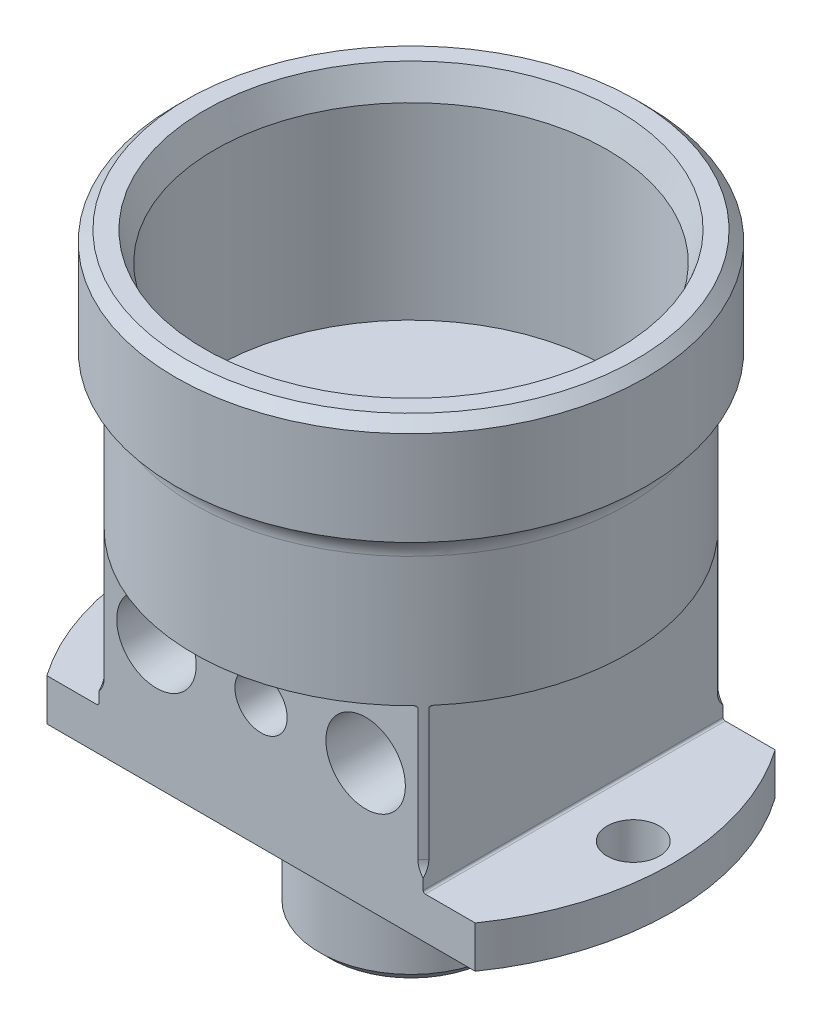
ISO-10303-21;
HEADER;
FILE_DESCRIPTION(('STEP AP214'),'2;1');
FILE_NAME('part.step','',(''),(''),'','','');
FILE_SCHEMA(('AUTOMOTIVE_DESIGN { 1 0 10303 214 1 1 1 1 }'));
ENDSEC;
DATA;
#1=APPLICATION_CONTEXT('core data for automotive mechanical design processes');
#2=APPLICATION_PROTOCOL_DEFINITION('international standard','automotive_design',2000,#1);
#3=PRODUCT_CONTEXT('',#1,'mechanical');
#4=PRODUCT('Part','Part','',(#3));
#5=PRODUCT_RELATED_PRODUCT_CATEGORY('part','',(#4));
#6=PRODUCT_DEFINITION_FORMATION('','',#4);
#7=PRODUCT_DEFINITION_CONTEXT('part definition',#1,'design');
#8=PRODUCT_DEFINITION('design','',#6,#7);
#9=PRODUCT_DEFINITION_SHAPE('','',#8);
#10=(LENGTH_UNIT() NAMED_UNIT(*) SI_UNIT(.MILLI.,.METRE.));
#11=(NAMED_UNIT(*) PLANE_ANGLE_UNIT() SI_UNIT($,.RADIAN.));
#12=(NAMED_UNIT(*) SI_UNIT($,.STERADIAN.) SOLID_ANGLE_UNIT());
#13=UNCERTAINTY_MEASURE_WITH_UNIT(LENGTH_MEASURE(1.E-05),#10,'distance_accuracy_value','');
#14=(GEOMETRIC_REPRESENTATION_CONTEXT(3) GLOBAL_UNCERTAINTY_ASSIGNED_CONTEXT((#13)) GLOBAL_UNIT_ASSIGNED_CONTEXT((#10,
#11,#12)) REPRESENTATION_CONTEXT('',''));
#15=CARTESIAN_POINT('',(0.,0.,0.));
#16=DIRECTION('',(0.,0.,1.));
#17=DIRECTION('',(1.,0.,0.));
#18=AXIS2_PLACEMENT_3D('',#15,#16,#17);
#19=CARTESIAN_POINT('',(28.575,55.88,0.));
#20=DIRECTION('',(0.,1.,0.));
#21=DIRECTION('',(0.,0.,1.));
#22=AXIS2_PLACEMENT_3D('',#19,#20,#21);
#23=PLANE('',#22);
#24=CARTESIAN_POINT('',(0.,55.88,0.));
#25=DIRECTION('',(0.,-1.,0.));
#26=DIRECTION('',(0.,0.,-1.));
#27=AXIS2_PLACEMENT_3D('',#24,#25,#26);
#28=CIRCLE('',#27,25.0825);
#29=CARTESIAN_POINT('',(0.,55.88,-25.0825));
#30=VERTEX_POINT('',#29);
#31=EDGE_CURVE('E537',#30,#30,#28,.T.);
#32=ORIENTED_EDGE('',*,*,#31,.T.);
#33=EDGE_LOOP('',(#32));
#34=FACE_BOUND('',#33,.T.);
#35=CARTESIAN_POINT('',(0.,55.88,0.));
#36=DIRECTION('',(0.,-1.,0.));
#37=DIRECTION('',(0.,0.,-1.));
#38=AXIS2_PLACEMENT_3D('',#35,#36,#37);
#39=CIRCLE('',#38,27.31516);
#40=CARTESIAN_POINT('',(0.,55.88,-27.31516));
#41=VERTEX_POINT('',#40);
#42=EDGE_CURVE('E1533',#41,#41,#39,.T.);
#43=ORIENTED_EDGE('',*,*,#42,.F.);
#44=EDGE_LOOP('',(#43));
#45=FACE_BOUND('',#44,.T.);
#46=ADVANCED_FACE('F49',(#34,#45),#23,.T.);
#47=CARTESIAN_POINT('',(0.,6.67956410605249,0.));
#48=DIRECTION('',(0.,-1.,0.));
#49=DIRECTION('',(0.,0.,-1.));
#50=AXIS2_PLACEMENT_3D('',#47,#48,#49);
#51=CYLINDRICAL_SURFACE('',#50,26.3525);
#52=CARTESIAN_POINT('',(0.,40.1512430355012,0.));
#53=DIRECTION('',(0.,1.,0.));
#54=DIRECTION('',(0.,0.,1.));
#55=AXIS2_PLACEMENT_3D('',#52,#53,#54);
#56=CIRCLE('',#55,26.3525);
#57=CARTESIAN_POINT('',(0.,40.1512430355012,26.3525));
#58=VERTEX_POINT('',#57);
#59=EDGE_CURVE('E541',#58,#58,#56,.F.);
#60=ORIENTED_EDGE('',*,*,#59,.T.);
#61=EDGE_LOOP('',(#60));
#62=FACE_BOUND('',#61,.T.);
#63=CARTESIAN_POINT('',(0.,8.255,0.));
#64=DIRECTION('',(0.,1.,0.));
#65=DIRECTION('',(0.,0.,1.));
#66=AXIS2_PLACEMENT_3D('',#63,#64,#65);
#67=CIRCLE('',#66,26.3525);
#68=CARTESIAN_POINT('',(-19.05,8.255,-18.2085627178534));
#69=VERTEX_POINT('',#68);
#70=CARTESIAN_POINT('',(-19.685,8.255,-17.5201321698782));
#71=VERTEX_POINT('',#70);
#72=EDGE_CURVE('E543',#69,#71,#67,.T.);
#73=ORIENTED_EDGE('',*,*,#72,.T.);
#74=DIRECTION('',(0.,-1.,0.));
#75=VECTOR('',#74,1.);
#76=CARTESIAN_POINT('',(-19.685,6.67956410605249,-17.5201321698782));
#77=LINE('',#76,#75);
#78=CARTESIAN_POINT('',(-19.685,24.1967036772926,-17.5201321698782));
#79=VERTEX_POINT('',#78);
#80=EDGE_CURVE('E409',#71,#79,#77,.F.);
#81=ORIENTED_EDGE('',*,*,#80,.T.);
#82=CARTESIAN_POINT('',(-19.685,24.1967036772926,-17.5201321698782));
#83=CARTESIAN_POINT('',(-19.6849804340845,24.2077100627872,-17.520153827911));
#84=CARTESIAN_POINT('',(-19.685714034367,24.2186833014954,-17.5193299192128));
#85=CARTESIAN_POINT('',(-19.688514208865,24.2401311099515,-17.5161831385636));
#86=CARTESIAN_POINT('',(-19.6905676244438,24.2506095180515,-17.5138750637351));
#87=CARTESIAN_POINT('',(-19.6958311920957,24.2708301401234,-17.5079554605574));
#88=CARTESIAN_POINT('',(-19.6990374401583,24.2805747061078,-17.5043483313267));
#89=CARTESIAN_POINT('',(-19.7063962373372,24.2992329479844,-17.4960634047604));
#90=CARTESIAN_POINT('',(-19.7105512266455,24.3081443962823,-17.4913828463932));
#91=CARTESIAN_POINT('',(-19.7216894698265,24.3289476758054,-17.4788248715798));
#92=CARTESIAN_POINT('',(-19.7290942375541,24.3403232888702,-17.470467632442));
#93=CARTESIAN_POINT('',(-19.7449850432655,24.361162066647,-17.4525060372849));
#94=CARTESIAN_POINT('',(-19.7534731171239,24.3706215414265,-17.4428993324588));
#95=CARTESIAN_POINT('',(-19.7753510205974,24.3918035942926,-17.4180978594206));
#96=CARTESIAN_POINT('',(-19.7891672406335,24.4024950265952,-17.4024015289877));
#97=CARTESIAN_POINT('',(-19.8176985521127,24.4205054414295,-17.3699036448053));
#98=CARTESIAN_POINT('',(-19.8324161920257,24.4278143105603,-17.3530989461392));
#99=CARTESIAN_POINT('',(-19.8624274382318,24.4394261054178,-17.3187399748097));
#100=CARTESIAN_POINT('',(-19.8777247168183,24.4437044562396,-17.3011807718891));
#101=CARTESIAN_POINT('',(-19.908363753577,24.4493191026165,-17.2659161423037));
#102=CARTESIAN_POINT('',(-19.923703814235,24.4506820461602,-17.2482135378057));
#103=CARTESIAN_POINT('',(-19.939,24.4507036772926,-17.2305117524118));
#104=B_SPLINE_CURVE_WITH_KNOTS('',3,(#82,#83,#84,#85,#86,#87,#88,#89,#90,#91,#92,#93,#94,#95,
#96,#97,#98,#99,#100,#101,#102,#103),.UNSPECIFIED.,.F.,.F.,(4,2,2,2,2,2,2,2,2,2,4),(0.,
0.0329114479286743,0.0654997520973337,0.0979787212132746,0.130542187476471,0.178094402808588,
0.22573733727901,0.295809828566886,0.366090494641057,0.436934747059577,0.507128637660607),.UNSPECIFIED.);
#105=CARTESIAN_POINT('',(-19.939,24.4507036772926,-17.2305117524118));
#106=VERTEX_POINT('',#105);
#107=EDGE_CURVE('E639',#79,#106,#104,.T.);
#108=ORIENTED_EDGE('',*,*,#107,.T.);
#109=CARTESIAN_POINT('',(0.,24.4507036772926,0.));
#110=DIRECTION('',(0.,-1.,0.));
#111=DIRECTION('',(0.,0.,-1.));
#112=AXIS2_PLACEMENT_3D('',#109,#110,#111);
#113=CIRCLE('',#112,26.3525);
#114=CARTESIAN_POINT('',(-19.939,24.4507036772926,17.2305117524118));
#115=VERTEX_POINT('',#114);
#116=EDGE_CURVE('E576',#106,#115,#113,.F.);
#117=ORIENTED_EDGE('',*,*,#116,.T.);
#118=CARTESIAN_POINT('',(-19.939,24.4507036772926,17.2305117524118));
#119=CARTESIAN_POINT('',(-19.928572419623,24.4506982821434,17.2425784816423));
#120=CARTESIAN_POINT('',(-19.9181417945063,24.4500616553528,17.2546264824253));
#121=CARTESIAN_POINT('',(-19.8973061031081,24.4474798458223,17.2786492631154));
#122=CARTESIAN_POINT('',(-19.8869011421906,24.4455318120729,17.2906238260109));
#123=CARTESIAN_POINT('',(-19.8556302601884,24.4376017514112,17.3265463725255));
#124=CARTESIAN_POINT('',(-19.8349233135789,24.4295317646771,17.3502444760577));
#125=CARTESIAN_POINT('',(-19.8031075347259,24.4117219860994,17.3865325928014));
#126=CARTESIAN_POINT('',(-19.7915240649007,24.4040005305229,17.399716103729));
#127=CARTESIAN_POINT('',(-19.769196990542,24.38614108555,17.4250792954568));
#128=CARTESIAN_POINT('',(-19.7584505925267,24.3760116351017,17.4372623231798));
#129=CARTESIAN_POINT('',(-19.7408060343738,24.3559696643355,17.4572324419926));
#130=CARTESIAN_POINT('',(-19.7336205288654,24.3466456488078,17.4653536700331));
#131=CARTESIAN_POINT('',(-19.720282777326,24.3264150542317,17.4804120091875));
#132=CARTESIAN_POINT('',(-19.7141294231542,24.3155101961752,17.4873503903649));
#133=CARTESIAN_POINT('',(-19.7045366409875,24.2948888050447,17.4981579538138));
#134=CARTESIAN_POINT('',(-19.7007990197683,24.2854896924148,17.5023654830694));
#135=CARTESIAN_POINT('',(-19.6943936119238,24.2659083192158,17.5095728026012));
#136=CARTESIAN_POINT('',(-19.691723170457,24.2557280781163,17.512575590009));
#137=CARTESIAN_POINT('',(-19.6881555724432,24.2374104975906,17.5165861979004));
#138=CARTESIAN_POINT('',(-19.6869826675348,24.2293941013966,17.5179043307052));
#139=CARTESIAN_POINT('',(-19.6853999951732,24.2131570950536,17.5196827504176));
#140=CARTESIAN_POINT('',(-19.6849936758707,24.204935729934,17.5201391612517));
#141=CARTESIAN_POINT('',(-19.685,24.1967036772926,17.5201321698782));
#142=B_SPLINE_CURVE_WITH_KNOTS('',3,(#118,#119,#120,#121,#122,#123,#124,#125,#126,#127,#128,
#129,#130,#131,#132,#133,#134,#135,#136,#137,#138,#139,#140,#141),.UNSPECIFIED.,.F.,.F.,(4,2,2,
2,2,2,2,2,2,2,2,4),(0.,0.0478054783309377,0.0957152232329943,0.192509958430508,
0.249886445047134,0.307062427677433,0.349831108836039,0.392553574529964,0.42529665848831,
0.457957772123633,0.482503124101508,0.507158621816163),.UNSPECIFIED.);
#143=CARTESIAN_POINT('',(-19.685,24.1967036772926,17.5201321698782));
#144=VERTEX_POINT('',#143);
#145=EDGE_CURVE('E630',#115,#144,#142,.T.);
#146=ORIENTED_EDGE('',*,*,#145,.T.);
#147=DIRECTION('',(0.,-1.,0.));
#148=VECTOR('',#147,1.);
#149=CARTESIAN_POINT('',(-19.685,6.67956410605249,17.5201321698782));
#150=LINE('',#149,#148);
#151=CARTESIAN_POINT('',(-19.685,8.255,17.5201321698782));
#152=VERTEX_POINT('',#151);
#153=EDGE_CURVE('E430',#144,#152,#150,.T.);
#154=ORIENTED_EDGE('',*,*,#153,.T.);
#155=CARTESIAN_POINT('',(-19.05,8.255,18.2085627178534));
#156=VERTEX_POINT('',#155);
#157=EDGE_CURVE('E539',#152,#156,#67,.T.);
#158=ORIENTED_EDGE('',*,*,#157,.T.);
#159=DIRECTION('',(0.,-1.,0.));
#160=VECTOR('',#159,1.);
#161=CARTESIAN_POINT('',(-19.05,6.67956410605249,18.2085627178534));
#162=LINE('',#161,#160);
#163=CARTESIAN_POINT('',(-19.05,24.1967036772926,18.2085627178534));
#164=VERTEX_POINT('',#163);
#165=EDGE_CURVE('E489',#164,#156,#162,.T.);
#166=ORIENTED_EDGE('',*,*,#165,.F.);
#167=CARTESIAN_POINT('',(-19.05,24.1967036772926,18.2085627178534));
#168=CARTESIAN_POINT('',(-19.0500179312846,24.2082389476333,18.2085436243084));
#169=CARTESIAN_POINT('',(-19.0492502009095,24.2197472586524,18.2093471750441));
#170=CARTESIAN_POINT('',(-19.046298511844,24.2422843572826,18.2124346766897));
#171=CARTESIAN_POINT('',(-19.0441261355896,24.2533162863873,18.214706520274));
#172=CARTESIAN_POINT('',(-19.0385228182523,24.2746469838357,18.2205631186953));
#173=CARTESIAN_POINT('',(-19.0350950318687,24.2849475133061,18.2241445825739));
#174=CARTESIAN_POINT('',(-19.0271819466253,24.3046786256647,18.2324062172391));
#175=CARTESIAN_POINT('',(-19.0226944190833,24.314107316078,18.2370887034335));
#176=CARTESIAN_POINT('',(-19.0109736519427,24.3354182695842,18.2493077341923));
#177=CARTESIAN_POINT('',(-19.0033478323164,24.3468519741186,18.2572497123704));
#178=CARTESIAN_POINT('',(-18.9869120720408,24.3677952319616,18.2743417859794));
#179=CARTESIAN_POINT('',(-18.9781001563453,24.3773015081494,18.2834938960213));
#180=CARTESIAN_POINT('',(-18.9562792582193,24.3975745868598,18.30612082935));
#181=CARTESIAN_POINT('',(-18.9429083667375,24.4075450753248,18.3199583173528));
#182=CARTESIAN_POINT('',(-18.9151918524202,24.4242959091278,18.3485741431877));
#183=CARTESIAN_POINT('',(-18.9008441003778,24.4310690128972,18.3633545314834));
#184=CARTESIAN_POINT('',(-18.872771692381,24.4412038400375,18.3922025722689));
#185=CARTESIAN_POINT('',(-18.8590892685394,24.4447954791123,18.4062323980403));
#186=CARTESIAN_POINT('',(-18.831584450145,24.4495312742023,18.4343720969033));
#187=CARTESIAN_POINT('',(-18.8177637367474,24.450692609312,18.4484806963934));
#188=CARTESIAN_POINT('',(-18.8039366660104,24.4507036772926,18.4625627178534));
#189=B_SPLINE_CURVE_WITH_KNOTS('',3,(#167,#168,#169,#170,#171,#172,#173,#174,#175,#176,#177,
#178,#179,#180,#181,#182,#183,#184,#185,#186,#187,#188),.UNSPECIFIED.,.F.,.F.,(4,2,2,2,2,2,2,2,
2,2,4),(0.,0.0345096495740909,0.0687383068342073,0.102881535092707,0.13709721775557,
0.184454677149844,0.231891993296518,0.296559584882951,0.361372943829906,0.420991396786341,
0.480186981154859),.UNSPECIFIED.);
#190=CARTESIAN_POINT('',(-18.8039366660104,24.4507036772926,18.4625627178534));
#191=VERTEX_POINT('',#190);
#192=EDGE_CURVE('E667',#164,#191,#189,.T.);
#193=ORIENTED_EDGE('',*,*,#192,.T.);
#194=CARTESIAN_POINT('',(0.,24.4507036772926,0.));
#195=DIRECTION('',(0.,1.,0.));
#196=DIRECTION('',(0.,0.,1.));
#197=AXIS2_PLACEMENT_3D('',#194,#195,#196);
#198=CIRCLE('',#197,26.3525);
#199=CARTESIAN_POINT('',(18.8039366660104,24.4507036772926,18.4625627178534));
#200=VERTEX_POINT('',#199);
#201=EDGE_CURVE('E547',#200,#191,#198,.F.);
#202=ORIENTED_EDGE('',*,*,#201,.F.);
#203=CARTESIAN_POINT('',(18.8039366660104,24.4507036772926,18.4625627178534));
#204=CARTESIAN_POINT('',(18.8226958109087,24.4506713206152,18.443459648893));
#205=CARTESIAN_POINT('',(18.8414921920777,24.4485406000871,18.4242546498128));
#206=CARTESIAN_POINT('',(18.8786825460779,24.4397423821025,18.3861439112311));
#207=CARTESIAN_POINT('',(18.8970707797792,24.4330306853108,18.3672429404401));
#208=CARTESIAN_POINT('',(18.9273494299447,24.4174139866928,18.3360309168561));
#209=CARTESIAN_POINT('',(18.9395592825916,24.4097361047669,18.3234177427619));
#210=CARTESIAN_POINT('',(18.9629655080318,24.391775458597,18.2991932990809));
#211=CARTESIAN_POINT('',(18.974165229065,24.3815017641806,18.2875787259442));
#212=CARTESIAN_POINT('',(18.992486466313,24.361075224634,18.2685479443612));
#213=CARTESIAN_POINT('',(18.9999317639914,24.3515201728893,18.2608035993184));
#214=CARTESIAN_POINT('',(19.013676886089,24.3308191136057,18.2464913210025));
#215=CARTESIAN_POINT('',(19.0199777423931,24.3196745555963,18.2399223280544));
#216=CARTESIAN_POINT('',(19.029988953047,24.2981962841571,18.2294766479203));
#217=CARTESIAN_POINT('',(19.033964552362,24.2881207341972,18.2253250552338));
#218=CARTESIAN_POINT('',(19.0407052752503,24.2671652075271,18.2182826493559));
#219=CARTESIAN_POINT('',(19.0434729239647,24.2562869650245,18.2153892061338));
#220=CARTESIAN_POINT('',(19.0470070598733,24.2372632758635,18.2116935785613));
#221=CARTESIAN_POINT('',(19.048122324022,24.229251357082,18.2105270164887));
#222=CARTESIAN_POINT('',(19.0496219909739,24.2130637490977,18.2089581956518));
#223=CARTESIAN_POINT('',(19.0500043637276,24.2048876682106,18.2085580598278));
#224=CARTESIAN_POINT('',(19.05,24.1967036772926,18.2085627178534));
#225=B_SPLINE_CURVE_WITH_KNOTS('',3,(#203,#204,#205,#206,#207,#208,#209,#210,#211,#212,#213,
#214,#215,#216,#217,#218,#219,#220,#221,#222,#223,#224),.UNSPECIFIED.,.F.,.F.,(4,2,2,2,2,2,2,2,
2,2,4),(0.,0.0804080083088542,0.161603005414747,0.2188981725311,0.275995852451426,
0.31898055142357,0.36192629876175,0.396589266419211,0.431179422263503,0.455631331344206,
0.480150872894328),.UNSPECIFIED.);
#226=CARTESIAN_POINT('',(19.05,24.1967036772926,18.2085627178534));
#227=VERTEX_POINT('',#226);
#228=EDGE_CURVE('E661',#200,#227,#225,.T.);
#229=ORIENTED_EDGE('',*,*,#228,.T.);
#230=DIRECTION('',(0.,-1.,0.));
#231=VECTOR('',#230,1.);
#232=CARTESIAN_POINT('',(19.05,6.67956410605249,18.2085627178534));
#233=LINE('',#232,#231);
#234=CARTESIAN_POINT('',(19.05,8.255,18.2085627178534));
#235=VERTEX_POINT('',#234);
#236=EDGE_CURVE('E482',#235,#227,#233,.F.);
#237=ORIENTED_EDGE('',*,*,#236,.F.);
#238=CARTESIAN_POINT('',(19.685,8.255,17.5201321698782));
#239=VERTEX_POINT('',#238);
#240=EDGE_CURVE('E540',#235,#239,#67,.T.);
#241=ORIENTED_EDGE('',*,*,#240,.T.);
#242=DIRECTION('',(0.,-1.,0.));
#243=VECTOR('',#242,1.);
#244=CARTESIAN_POINT('',(19.685,6.67956410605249,17.5201321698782));
#245=LINE('',#244,#243);
#246=CARTESIAN_POINT('',(19.685,24.1967036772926,17.5201321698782));
#247=VERTEX_POINT('',#246);
#248=EDGE_CURVE('E451',#247,#239,#245,.T.);
#249=ORIENTED_EDGE('',*,*,#248,.F.);
#250=CARTESIAN_POINT('',(19.685,24.1967036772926,17.5201321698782));
#251=CARTESIAN_POINT('',(19.6849804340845,24.2077100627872,17.520153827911));
#252=CARTESIAN_POINT('',(19.685714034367,24.2186833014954,17.5193299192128));
#253=CARTESIAN_POINT('',(19.688514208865,24.2401311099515,17.5161831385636));
#254=CARTESIAN_POINT('',(19.6905676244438,24.2506095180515,17.5138750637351));
#255=CARTESIAN_POINT('',(19.6958311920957,24.2708301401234,17.5079554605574));
#256=CARTESIAN_POINT('',(19.6990374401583,24.2805747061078,17.5043483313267));
#257=CARTESIAN_POINT('',(19.7063962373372,24.2992329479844,17.4960634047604));
#258=CARTESIAN_POINT('',(19.7105512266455,24.3081443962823,17.4913828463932));
#259=CARTESIAN_POINT('',(19.7216894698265,24.3289476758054,17.4788248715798));
#260=CARTESIAN_POINT('',(19.7290942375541,24.3403232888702,17.470467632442));
#261=CARTESIAN_POINT('',(19.7449850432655,24.361162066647,17.4525060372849));
#262=CARTESIAN_POINT('',(19.7534731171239,24.3706215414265,17.4428993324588));
#263=CARTESIAN_POINT('',(19.7753510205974,24.3918035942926,17.4180978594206));
#264=CARTESIAN_POINT('',(19.7891672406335,24.4024950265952,17.4024015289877));
#265=CARTESIAN_POINT('',(19.8176985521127,24.4205054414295,17.3699036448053));
#266=CARTESIAN_POINT('',(19.8324161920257,24.4278143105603,17.3530989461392));
#267=CARTESIAN_POINT('',(19.8624274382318,24.4394261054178,17.3187399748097));
#268=CARTESIAN_POINT('',(19.8777247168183,24.4437044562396,17.3011807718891));
#269=CARTESIAN_POINT('',(19.908363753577,24.4493191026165,17.2659161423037));
#270=CARTESIAN_POINT('',(19.923703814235,24.4506820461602,17.2482135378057));
#271=CARTESIAN_POINT('',(19.939,24.4507036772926,17.2305117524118));
#272=B_SPLINE_CURVE_WITH_KNOTS('',3,(#250,#251,#252,#253,#254,#255,#256,#257,#258,#259,#260,
#261,#262,#263,#264,#265,#266,#267,#268,#269,#270,#271),.UNSPECIFIED.,.F.,.F.,(4,2,2,2,2,2,2,2,
2,2,4),(0.,0.0329114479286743,0.0654997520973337,0.0979787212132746,0.130542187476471,
0.178094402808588,0.22573733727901,0.295809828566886,0.366090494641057,0.436934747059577,
0.507128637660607),.UNSPECIFIED.);
#273=CARTESIAN_POINT('',(19.939,24.4507036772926,17.2305117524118));
#274=VERTEX_POINT('',#273);
#275=EDGE_CURVE('E607',#247,#274,#272,.T.);
#276=ORIENTED_EDGE('',*,*,#275,.T.);
#277=CARTESIAN_POINT('',(0.,24.4507036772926,0.));
#278=DIRECTION('',(0.,1.,0.));
#279=DIRECTION('',(0.,0.,1.));
#280=AXIS2_PLACEMENT_3D('',#277,#278,#279);
#281=CIRCLE('',#280,26.3525);
#282=CARTESIAN_POINT('',(19.939,24.4507036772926,-17.2305117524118));
#283=VERTEX_POINT('',#282);
#284=EDGE_CURVE('E569',#283,#274,#281,.F.);
#285=ORIENTED_EDGE('',*,*,#284,.F.);
#286=CARTESIAN_POINT('',(19.939,24.4507036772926,-17.2305117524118));
#287=CARTESIAN_POINT('',(19.928572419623,24.4506982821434,-17.2425784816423));
#288=CARTESIAN_POINT('',(19.9181417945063,24.4500616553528,-17.2546264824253));
#289=CARTESIAN_POINT('',(19.8973061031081,24.4474798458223,-17.2786492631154));
#290=CARTESIAN_POINT('',(19.8869011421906,24.4455318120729,-17.2906238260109));
#291=CARTESIAN_POINT('',(19.8556302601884,24.4376017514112,-17.3265463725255));
#292=CARTESIAN_POINT('',(19.8349233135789,24.4295317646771,-17.3502444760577));
#293=CARTESIAN_POINT('',(19.8031075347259,24.4117219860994,-17.3865325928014));
#294=CARTESIAN_POINT('',(19.7915240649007,24.4040005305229,-17.399716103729));
#295=CARTESIAN_POINT('',(19.769196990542,24.38614108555,-17.4250792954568));
#296=CARTESIAN_POINT('',(19.7584505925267,24.3760116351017,-17.4372623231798));
#297=CARTESIAN_POINT('',(19.7408060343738,24.3559696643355,-17.4572324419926));
#298=CARTESIAN_POINT('',(19.7336205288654,24.3466456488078,-17.4653536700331));
#299=CARTESIAN_POINT('',(19.720282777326,24.3264150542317,-17.4804120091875));
#300=CARTESIAN_POINT('',(19.7141294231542,24.3155101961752,-17.4873503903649));
#301=CARTESIAN_POINT('',(19.7045366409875,24.2948888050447,-17.4981579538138));
#302=CARTESIAN_POINT('',(19.7007990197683,24.2854896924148,-17.5023654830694));
#303=CARTESIAN_POINT('',(19.6943936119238,24.2659083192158,-17.5095728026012));
#304=CARTESIAN_POINT('',(19.691723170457,24.2557280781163,-17.512575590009));
#305=CARTESIAN_POINT('',(19.6881555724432,24.2374104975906,-17.5165861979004));
#306=CARTESIAN_POINT('',(19.6869826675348,24.2293941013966,-17.5179043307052));
#307=CARTESIAN_POINT('',(19.6853999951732,24.2131570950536,-17.5196827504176));
#308=CARTESIAN_POINT('',(19.6849936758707,24.204935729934,-17.5201391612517));
#309=CARTESIAN_POINT('',(19.685,24.1967036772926,-17.5201321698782));
#310=B_SPLINE_CURVE_WITH_KNOTS('',3,(#286,#287,#288,#289,#290,#291,#292,#293,#294,#295,#296,
#297,#298,#299,#300,#301,#302,#303,#304,#305,#306,#307,#308,#309),.UNSPECIFIED.,.F.,.F.,(4,2,2,
2,2,2,2,2,2,2,2,4),(0.,0.0478054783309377,0.0957152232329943,0.192509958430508,
0.249886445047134,0.307062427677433,0.349831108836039,0.392553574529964,0.42529665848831,
0.457957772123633,0.482503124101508,0.507158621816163),.UNSPECIFIED.);
#311=CARTESIAN_POINT('',(19.685,24.1967036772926,-17.5201321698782));
#312=VERTEX_POINT('',#311);
#313=EDGE_CURVE('E613',#283,#312,#310,.T.);
#314=ORIENTED_EDGE('',*,*,#313,.T.);
#315=DIRECTION('',(0.,-1.,0.));
#316=VECTOR('',#315,1.);
#317=CARTESIAN_POINT('',(19.685,6.67956410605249,-17.5201321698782));
#318=LINE('',#317,#316);
#319=CARTESIAN_POINT('',(19.685,8.255,-17.5201321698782));
#320=VERTEX_POINT('',#319);
#321=EDGE_CURVE('E436',#320,#312,#318,.F.);
#322=ORIENTED_EDGE('',*,*,#321,.F.);
#323=CARTESIAN_POINT('',(19.05,8.255,-18.2085627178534));
#324=VERTEX_POINT('',#323);
#325=EDGE_CURVE('E542',#320,#324,#67,.T.);
#326=ORIENTED_EDGE('',*,*,#325,.T.);
#327=DIRECTION('',(0.,-1.,0.));
#328=VECTOR('',#327,1.);
#329=CARTESIAN_POINT('',(19.05,6.67956410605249,-18.2085627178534));
#330=LINE('',#329,#328);
#331=CARTESIAN_POINT('',(19.05,24.1967036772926,-18.2085627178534));
#332=VERTEX_POINT('',#331);
#333=EDGE_CURVE('E464',#324,#332,#330,.F.);
#334=ORIENTED_EDGE('',*,*,#333,.T.);
#335=CARTESIAN_POINT('',(19.05,24.1967036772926,-18.2085627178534));
#336=CARTESIAN_POINT('',(19.0500179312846,24.2082389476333,-18.2085436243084));
#337=CARTESIAN_POINT('',(19.0492502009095,24.2197472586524,-18.2093471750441));
#338=CARTESIAN_POINT('',(19.046298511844,24.2422843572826,-18.2124346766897));
#339=CARTESIAN_POINT('',(19.0441261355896,24.2533162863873,-18.214706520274));
#340=CARTESIAN_POINT('',(19.0385228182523,24.2746469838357,-18.2205631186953));
#341=CARTESIAN_POINT('',(19.0350950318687,24.2849475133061,-18.2241445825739));
#342=CARTESIAN_POINT('',(19.0271819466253,24.3046786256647,-18.2324062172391));
#343=CARTESIAN_POINT('',(19.0226944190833,24.314107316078,-18.2370887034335));
#344=CARTESIAN_POINT('',(19.0109736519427,24.3354182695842,-18.2493077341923));
#345=CARTESIAN_POINT('',(19.0033478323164,24.3468519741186,-18.2572497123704));
#346=CARTESIAN_POINT('',(18.9869120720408,24.3677952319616,-18.2743417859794));
#347=CARTESIAN_POINT('',(18.9781001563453,24.3773015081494,-18.2834938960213));
#348=CARTESIAN_POINT('',(18.9562792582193,24.3975745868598,-18.30612082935));
#349=CARTESIAN_POINT('',(18.9429083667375,24.4075450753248,-18.3199583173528));
#350=CARTESIAN_POINT('',(18.9151918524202,24.4242959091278,-18.3485741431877));
#351=CARTESIAN_POINT('',(18.9008441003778,24.4310690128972,-18.3633545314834));
#352=CARTESIAN_POINT('',(18.872771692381,24.4412038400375,-18.3922025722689));
#353=CARTESIAN_POINT('',(18.8590892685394,24.4447954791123,-18.4062323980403));
#354=CARTESIAN_POINT('',(18.831584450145,24.4495312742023,-18.4343720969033));
#355=CARTESIAN_POINT('',(18.8177637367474,24.450692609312,-18.4484806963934));
#356=CARTESIAN_POINT('',(18.8039366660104,24.4507036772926,-18.4625627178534));
#357=B_SPLINE_CURVE_WITH_KNOTS('',3,(#335,#336,#337,#338,#339,#340,#341,#342,#343,#344,#345,
#346,#347,#348,#349,#350,#351,#352,#353,#354,#355,#356),.UNSPECIFIED.,.F.,.F.,(4,2,2,2,2,2,2,2,
2,2,4),(0.,0.0345096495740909,0.0687383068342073,0.102881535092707,0.13709721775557,
0.184454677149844,0.231891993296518,0.296559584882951,0.361372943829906,0.420991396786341,
0.480186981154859),.UNSPECIFIED.);
#358=CARTESIAN_POINT('',(18.8039366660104,24.4507036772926,-18.4625627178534));
#359=VERTEX_POINT('',#358);
#360=EDGE_CURVE('E647',#332,#359,#357,.T.);
#361=ORIENTED_EDGE('',*,*,#360,.T.);
#362=CARTESIAN_POINT('',(0.,24.4507036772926,0.));
#363=DIRECTION('',(0.,-1.,0.));
#364=DIRECTION('',(0.,0.,-1.));
#365=AXIS2_PLACEMENT_3D('',#362,#363,#364);
#366=CIRCLE('',#365,26.3525);
#367=CARTESIAN_POINT('',(-18.8039366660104,24.4507036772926,-18.4625627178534));
#368=VERTEX_POINT('',#367);
#369=EDGE_CURVE('E561',#359,#368,#366,.F.);
#370=ORIENTED_EDGE('',*,*,#369,.T.);
#371=CARTESIAN_POINT('',(-18.8039366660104,24.4507036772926,-18.4625627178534));
#372=CARTESIAN_POINT('',(-18.8226958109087,24.4506713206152,-18.443459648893));
#373=CARTESIAN_POINT('',(-18.8414921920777,24.4485406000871,-18.4242546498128));
#374=CARTESIAN_POINT('',(-18.8786825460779,24.4397423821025,-18.3861439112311));
#375=CARTESIAN_POINT('',(-18.8970707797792,24.4330306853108,-18.3672429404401));
#376=CARTESIAN_POINT('',(-18.9273494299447,24.4174139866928,-18.3360309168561));
#377=CARTESIAN_POINT('',(-18.9395592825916,24.4097361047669,-18.3234177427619));
#378=CARTESIAN_POINT('',(-18.9629655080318,24.391775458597,-18.2991932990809));
#379=CARTESIAN_POINT('',(-18.974165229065,24.3815017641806,-18.2875787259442));
#380=CARTESIAN_POINT('',(-18.992486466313,24.361075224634,-18.2685479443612));
#381=CARTESIAN_POINT('',(-18.9999317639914,24.3515201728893,-18.2608035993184));
#382=CARTESIAN_POINT('',(-19.013676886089,24.3308191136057,-18.2464913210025));
#383=CARTESIAN_POINT('',(-19.0199777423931,24.3196745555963,-18.2399223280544));
#384=CARTESIAN_POINT('',(-19.029988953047,24.2981962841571,-18.2294766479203));
#385=CARTESIAN_POINT('',(-19.033964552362,24.2881207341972,-18.2253250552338));
#386=CARTESIAN_POINT('',(-19.0407052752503,24.2671652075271,-18.2182826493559));
#387=CARTESIAN_POINT('',(-19.0434729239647,24.2562869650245,-18.2153892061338));
#388=CARTESIAN_POINT('',(-19.0470070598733,24.2372632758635,-18.2116935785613));
#389=CARTESIAN_POINT('',(-19.048122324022,24.229251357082,-18.2105270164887));
#390=CARTESIAN_POINT('',(-19.0496219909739,24.2130637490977,-18.2089581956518));
#391=CARTESIAN_POINT('',(-19.0500043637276,24.2048876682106,-18.2085580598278));
#392=CARTESIAN_POINT('',(-19.05,24.1967036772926,-18.2085627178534));
#393=B_SPLINE_CURVE_WITH_KNOTS('',3,(#371,#372,#373,#374,#375,#376,#377,#378,#379,#380,#381,
#382,#383,#384,#385,#386,#387,#388,#389,#390,#391,#392),.UNSPECIFIED.,.F.,.F.,(4,2,2,2,2,2,2,2,
2,2,4),(0.,0.0804080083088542,0.161603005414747,0.2188981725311,0.275995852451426,
0.31898055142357,0.36192629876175,0.396589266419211,0.431179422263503,0.455631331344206,
0.480150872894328),.UNSPECIFIED.);
#394=CARTESIAN_POINT('',(-19.05,24.1967036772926,-18.2085627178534));
#395=VERTEX_POINT('',#394);
#396=EDGE_CURVE('E655',#368,#395,#393,.T.);
#397=ORIENTED_EDGE('',*,*,#396,.T.);
#398=DIRECTION('',(0.,-1.,0.));
#399=VECTOR('',#398,1.);
#400=CARTESIAN_POINT('',(-19.05,6.67956410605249,-18.2085627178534));
#401=LINE('',#400,#399);
#402=EDGE_CURVE('E471',#395,#69,#401,.T.);
#403=ORIENTED_EDGE('',*,*,#402,.T.);
#404=EDGE_LOOP('',(#73,#81,#108,#117,#146,#154,#158,#166,#193,#202,#229,#237,#241,#249,#276,
#285,#314,#322,#326,#334,#361,#370,#397,#403));
#405=FACE_BOUND('',#404,.T.);
#406=ADVANCED_FACE('F316',(#62,#405),#51,.T.);
#407=CARTESIAN_POINT('',(0.,8.255,0.));
#408=DIRECTION('',(0.,1.,0.));
#409=DIRECTION('',(0.,0.,1.));
#410=AXIS2_PLACEMENT_3D('',#407,#408,#409);
#411=TOROIDAL_SURFACE('',#410,29.5275,3.175);
#412=CARTESIAN_POINT('',(-19.685,7.17251207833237,-17.8049811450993));
#413=CARTESIAN_POINT('',(-19.685,7.00252903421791,-17.8968848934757));
#414=CARTESIAN_POINT('',(-19.685,6.84266411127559,-18.0074760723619));
#415=CARTESIAN_POINT('',(-19.685,6.5450749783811,-18.2553924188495));
#416=CARTESIAN_POINT('',(-19.685,6.40742488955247,-18.3928038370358));
#417=CARTESIAN_POINT('',(-19.685,6.19798578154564,-18.6353611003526));
#418=CARTESIAN_POINT('',(-19.685,6.11989432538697,-18.7352064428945));
#419=CARTESIAN_POINT('',(-19.685,5.97269348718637,-18.9413709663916));
#420=CARTESIAN_POINT('',(-19.685,5.90358769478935,-19.0476927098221));
#421=CARTESIAN_POINT('',(-19.685,5.77406148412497,-19.2655450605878));
#422=CARTESIAN_POINT('',(-19.685,5.71364564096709,-19.3770783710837));
#423=CARTESIAN_POINT('',(-19.685,5.60128783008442,-19.6042746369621));
#424=CARTESIAN_POINT('',(-19.685,5.54934364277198,-19.7199365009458));
#425=CARTESIAN_POINT('',(-19.685,5.4407712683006,-19.9863577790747));
#426=CARTESIAN_POINT('',(-19.685,5.38667120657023,-20.1381546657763));
#427=CARTESIAN_POINT('',(-19.685,5.29154961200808,-20.4457462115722));
#428=CARTESIAN_POINT('',(-19.685,5.25053134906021,-20.6015418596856));
#429=CARTESIAN_POINT('',(-19.685,5.14693369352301,-21.0735038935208));
#430=CARTESIAN_POINT('',(-19.685,5.10380222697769,-21.3942683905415));
#431=CARTESIAN_POINT('',(-19.685,5.07922178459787,-21.8778747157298));
#432=CARTESIAN_POINT('',(-19.685,5.07777305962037,-22.0399945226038));
#433=CARTESIAN_POINT('',(-19.685,5.08879957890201,-22.3637733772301));
#434=CARTESIAN_POINT('',(-19.685,5.10127666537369,-22.5254323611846));
#435=CARTESIAN_POINT('',(-19.685,5.16036353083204,-23.0073293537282));
#436=CARTESIAN_POINT('',(-19.685,5.22857755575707,-23.3253973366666));
#437=CARTESIAN_POINT('',(-19.685,5.39803216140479,-23.8502417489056));
#438=CARTESIAN_POINT('',(-19.685,5.48359439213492,-24.062170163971));
#439=CARTESIAN_POINT('',(-19.685,5.6874597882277,-24.4697523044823));
#440=CARTESIAN_POINT('',(-19.685,5.80571881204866,-24.6654275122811));
#441=CARTESIAN_POINT('',(-19.685,6.04944413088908,-24.9964990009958));
#442=CARTESIAN_POINT('',(-19.685,6.1690315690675,-25.1362161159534));
#443=CARTESIAN_POINT('',(-19.685,6.42944544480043,-25.3943108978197));
#444=CARTESIAN_POINT('',(-19.685,6.57024989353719,-25.512710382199));
#445=CARTESIAN_POINT('',(-19.685,6.8482960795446,-25.7062816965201));
#446=CARTESIAN_POINT('',(-19.685,6.98286630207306,-25.7852810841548));
#447=CARTESIAN_POINT('',(-19.685,7.26334051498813,-25.9197780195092));
#448=CARTESIAN_POINT('',(-19.685,7.40923958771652,-25.9752856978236));
#449=CARTESIAN_POINT('',(-19.685,7.70929056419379,-26.0598262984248));
#450=CARTESIAN_POINT('',(-19.685,7.86347616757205,-26.088740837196));
#451=CARTESIAN_POINT('',(-19.685,8.17453807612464,-26.1177694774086));
#452=CARTESIAN_POINT('',(-19.685,8.33141364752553,-26.1178913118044));
#453=CARTESIAN_POINT('',(-19.685,8.63021617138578,-26.0904924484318));
#454=CARTESIAN_POINT('',(-19.685,8.77234880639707,-26.0651440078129));
#455=CARTESIAN_POINT('',(-19.685,9.05047992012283,-25.9914582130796));
#456=CARTESIAN_POINT('',(-19.685,9.18647825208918,-25.9431203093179));
#457=CARTESIAN_POINT('',(-19.685,9.45230705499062,-25.8244825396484));
#458=CARTESIAN_POINT('',(-19.685,9.58191727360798,-25.7536929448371));
#459=CARTESIAN_POINT('',(-19.685,9.82915362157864,-25.59369682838));
#460=CARTESIAN_POINT('',(-19.685,9.94677593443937,-25.5044844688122));
#461=CARTESIAN_POINT('',(-19.685,10.1827158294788,-25.2986106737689));
#462=CARTESIAN_POINT('',(-19.685,10.2992441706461,-25.1799053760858));
#463=CARTESIAN_POINT('',(-19.685,10.5146116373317,-24.9274599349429));
#464=CARTESIAN_POINT('',(-19.685,10.6134376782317,-24.7937087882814));
#465=CARTESIAN_POINT('',(-19.685,10.836101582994,-24.4485538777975));
#466=CARTESIAN_POINT('',(-19.685,10.9495608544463,-24.2304151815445));
#467=CARTESIAN_POINT('',(-19.685,11.1395296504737,-23.7785914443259));
#468=CARTESIAN_POINT('',(-19.685,11.2159663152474,-23.5448767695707));
#469=CARTESIAN_POINT('',(-19.685,11.3484529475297,-23.0103771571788));
#470=CARTESIAN_POINT('',(-19.685,11.394922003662,-22.7071871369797));
#471=CARTESIAN_POINT('',(-19.685,11.4269586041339,-22.2501972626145));
#472=CARTESIAN_POINT('',(-19.685,11.431348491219,-22.0973814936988));
#473=CARTESIAN_POINT('',(-19.685,11.4279386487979,-21.7918820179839));
#474=CARTESIAN_POINT('',(-19.685,11.4201384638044,-21.6391983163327));
#475=CARTESIAN_POINT('',(-19.685,11.3785834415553,-21.1797880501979));
#476=CARTESIAN_POINT('',(-19.685,11.3264923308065,-20.8744438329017));
#477=CARTESIAN_POINT('',(-19.685,11.2126766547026,-20.4259543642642));
#478=CARTESIAN_POINT('',(-19.685,11.1687775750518,-20.2780131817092));
#479=CARTESIAN_POINT('',(-19.685,11.068925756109,-19.9862574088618));
#480=CARTESIAN_POINT('',(-19.685,11.0129761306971,-19.8424417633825));
#481=CARTESIAN_POINT('',(-19.685,10.8547961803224,-19.482980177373));
#482=CARTESIAN_POINT('',(-19.685,10.7439822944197,-19.2710243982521));
#483=CARTESIAN_POINT('',(-19.685,10.4912961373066,-18.8665188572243));
#484=CARTESIAN_POINT('',(-19.685,10.3494760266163,-18.6739372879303));
#485=CARTESIAN_POINT('',(-19.685,10.0797461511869,-18.3708764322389));
#486=CARTESIAN_POINT('',(-19.685,9.96018911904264,-18.2529884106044));
#487=CARTESIAN_POINT('',(-19.685,9.70432810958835,-18.0369433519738));
#488=CARTESIAN_POINT('',(-19.685,9.56804960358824,-17.9387568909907));
#489=CARTESIAN_POINT('',(-19.685,9.30983918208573,-17.7865692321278));
#490=CARTESIAN_POINT('',(-19.685,9.19084124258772,-17.7276237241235));
#491=CARTESIAN_POINT('',(-19.685,8.9447278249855,-17.6301059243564));
#492=CARTESIAN_POINT('',(-19.685,8.81761958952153,-17.5915157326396));
#493=CARTESIAN_POINT('',(-19.685,8.55756991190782,-17.5377558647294));
#494=CARTESIAN_POINT('',(-19.685,8.42459569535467,-17.5227413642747));
#495=CARTESIAN_POINT('',(-19.685,8.15821413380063,-17.5181508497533));
#496=CARTESIAN_POINT('',(-19.685,8.02480685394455,-17.5285711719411));
#497=CARTESIAN_POINT('',(-19.685,7.7674597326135,-17.5728674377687));
#498=CARTESIAN_POINT('',(-19.685,7.64335394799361,-17.605803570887));
#499=CARTESIAN_POINT('',(-19.685,7.40218519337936,-17.6914086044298));
#500=CARTESIAN_POINT('',(-19.685,7.28512809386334,-17.7440936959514));
#501=CARTESIAN_POINT('',(-19.685,7.17251207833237,-17.8049811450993));
#502=B_SPLINE_CURVE_WITH_KNOTS('',3,(#412,#413,#414,#415,#416,#417,#418,#419,#420,#421,#422,
#423,#424,#425,#426,#427,#428,#429,#430,#431,#432,#433,#434,#435,#436,#437,#438,#439,#440,#441,
#442,#443,#444,#445,#446,#447,#448,#449,#450,#451,#452,#453,#454,#455,#456,#457,#458,#459,#460,
#461,#462,#463,#464,#465,#466,#467,#468,#469,#470,#471,#472,#473,#474,#475,#476,#477,#478,#479,
#480,#481,#482,#483,#484,#485,#486,#487,#488,#489,#490,#491,#492,#493,#494,#495,#496,#497,#498,
#499,#500,#501),.UNSPECIFIED.,.T.,.F.,(4,2,2,2,2,2,2,2,2,2,2,2,2,2,2,2,2,2,2,2,2,2,2,2,2,2,2,2,
2,2,2,2,2,2,2,2,2,2,2,2,2,2,2,2,4),(0.,0.579055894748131,1.16000559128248,1.53981687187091,
1.91977941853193,2.29994128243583,2.6800033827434,3.16278099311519,3.64567918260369,
4.61140203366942,5.09729347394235,5.58324919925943,6.55246177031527,7.2357673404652,
7.91815489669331,8.46777608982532,9.01683153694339,9.48299367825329,9.9489545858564,
10.4169798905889,10.8848794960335,11.3159969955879,11.747124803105,12.1883910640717,
12.6297973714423,13.1269651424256,13.6244988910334,14.3580834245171,15.0931058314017,
16.0081840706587,16.4664283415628,16.9246897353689,17.8493682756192,18.3119176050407,
18.7743475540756,19.4894581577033,20.2033748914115,20.705519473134,21.2069084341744,
21.6037470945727,22.0002362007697,22.3993242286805,22.7983547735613,23.1816720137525,
23.5653042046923),.UNSPECIFIED.);
#503=CARTESIAN_POINT('',(-19.685,6.60465089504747,-18.2085627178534));
#504=VERTEX_POINT('',#503);
#505=EDGE_CURVE('E401',#71,#504,#502,.T.);
#506=ORIENTED_EDGE('',*,*,#505,.F.);
#507=ORIENTED_EDGE('',*,*,#72,.F.);
#508=CARTESIAN_POINT('',(-27.0033046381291,7.34352100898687,-18.2085627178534));
#509=CARTESIAN_POINT('',(-26.9736920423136,7.26159310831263,-18.2085627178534));
#510=CARTESIAN_POINT('',(-26.9402172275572,7.18108454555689,-18.2085627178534));
#511=CARTESIAN_POINT('',(-26.8660528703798,7.02345067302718,-18.2085627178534));
#512=CARTESIAN_POINT('',(-26.8253609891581,6.94632647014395,-18.2085627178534));
#513=CARTESIAN_POINT('',(-26.693195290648,6.72067459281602,-18.2085627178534));
#514=CARTESIAN_POINT('',(-26.5916514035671,6.57792173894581,-18.2085627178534));
#515=CARTESIAN_POINT('',(-26.3675700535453,6.31189575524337,-18.2085627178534));
#516=CARTESIAN_POINT('',(-26.2451727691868,6.18850248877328,-18.2085627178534));
#517=CARTESIAN_POINT('',(-25.9835380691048,5.9612807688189,-18.2085627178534));
#518=CARTESIAN_POINT('',(-25.8443022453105,5.85745046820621,-18.2085627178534));
#519=CARTESIAN_POINT('',(-25.534889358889,5.65801254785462,-18.2085627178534));
#520=CARTESIAN_POINT('',(-25.3630189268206,5.56504372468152,-18.2085627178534));
#521=CARTESIAN_POINT('',(-25.0080182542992,5.40399032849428,-18.2085627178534));
#522=CARTESIAN_POINT('',(-24.8248808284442,5.33592183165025,-18.2085627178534));
#523=CARTESIAN_POINT('',(-24.4154672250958,5.21320159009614,-18.2085627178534));
#524=CARTESIAN_POINT('',(-24.1876639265,5.16364145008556,-18.2085627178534));
#525=CARTESIAN_POINT('',(-23.7273692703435,5.09744526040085,-18.2085627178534));
#526=CARTESIAN_POINT('',(-23.4948756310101,5.08082564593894,-18.2085627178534));
#527=CARTESIAN_POINT('',(-22.9908359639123,5.07910096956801,-18.2085627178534));
#528=CARTESIAN_POINT('',(-22.7192645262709,5.09973415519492,-18.2085627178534));
#529=CARTESIAN_POINT('',(-22.1820813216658,5.18292075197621,-18.2085627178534));
#530=CARTESIAN_POINT('',(-21.9164798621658,5.24554165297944,-18.2085627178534));
#531=CARTESIAN_POINT('',(-21.5185493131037,5.37384469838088,-18.2085627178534));
#532=CARTESIAN_POINT('',(-21.3813402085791,5.42474606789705,-18.2085627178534));
#533=CARTESIAN_POINT('',(-21.1120741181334,5.53870173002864,-18.2085627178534));
#534=CARTESIAN_POINT('',(-20.9800185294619,5.60175929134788,-18.2085627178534));
#535=CARTESIAN_POINT('',(-20.5942980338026,5.80921567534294,-18.2085627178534));
#536=CARTESIAN_POINT('',(-20.3499747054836,5.97224397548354,-18.2085627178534));
#537=CARTESIAN_POINT('',(-19.9934961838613,6.27339045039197,-18.2085627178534));
#538=CARTESIAN_POINT('',(-19.8675536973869,6.39540778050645,-18.2085627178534));
#539=CARTESIAN_POINT('',(-19.6361708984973,6.65759129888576,-18.2085627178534));
#540=CARTESIAN_POINT('',(-19.5306969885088,6.79772710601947,-18.2085627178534));
#541=CARTESIAN_POINT('',(-19.3629438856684,7.06832409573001,-18.2085627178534));
#542=CARTESIAN_POINT('',(-19.2963195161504,7.1960789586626,-18.2085627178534));
#543=CARTESIAN_POINT('',(-19.1850995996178,7.46091215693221,-18.2085627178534));
#544=CARTESIAN_POINT('',(-19.1404901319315,7.59798453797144,-18.2085627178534));
#545=CARTESIAN_POINT('',(-19.0764690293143,7.87886652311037,-18.2085627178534));
#546=CARTESIAN_POINT('',(-19.0572114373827,8.02271186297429,-18.2085627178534));
#547=CARTESIAN_POINT('',(-19.0461572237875,8.31144309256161,-18.2085627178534));
#548=CARTESIAN_POINT('',(-19.0543519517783,8.45632864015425,-18.2085627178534));
#549=CARTESIAN_POINT('',(-19.0952623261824,8.72786770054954,-18.2085627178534));
#550=CARTESIAN_POINT('',(-19.1254798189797,8.85491003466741,-18.2085627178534));
#551=CARTESIAN_POINT('',(-19.2054692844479,9.10263441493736,-18.2085627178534));
#552=CARTESIAN_POINT('',(-19.2552485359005,9.22331407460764,-18.2085627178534));
#553=CARTESIAN_POINT('',(-19.3894209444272,9.49184552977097,-18.2085627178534));
#554=CARTESIAN_POINT('',(-19.4797430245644,9.63673218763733,-18.2085627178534));
#555=CARTESIAN_POINT('',(-19.6827775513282,9.90987535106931,-18.2085627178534));
#556=CARTESIAN_POINT('',(-19.7955321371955,10.0380997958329,-18.2085627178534));
#557=CARTESIAN_POINT('',(-20.0777911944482,10.3163930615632,-18.2085627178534));
#558=CARTESIAN_POINT('',(-20.2537870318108,10.4598609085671,-18.2085627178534));
#559=CARTESIAN_POINT('',(-20.6263650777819,10.7166380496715,-18.2085627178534));
#560=CARTESIAN_POINT('',(-20.8229675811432,10.8299172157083,-18.2085627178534));
#561=CARTESIAN_POINT('',(-21.2349716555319,11.0294095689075,-18.2085627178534));
#562=CARTESIAN_POINT('',(-21.4507019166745,11.114939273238,-18.2085627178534));
#563=CARTESIAN_POINT('',(-21.8916456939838,11.2557493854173,-18.2085627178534));
#564=CARTESIAN_POINT('',(-22.1168583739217,11.3110324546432,-18.2085627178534));
#565=CARTESIAN_POINT('',(-22.6222149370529,11.399984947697,-18.2085627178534));
#566=CARTESIAN_POINT('',(-22.9036947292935,11.4263832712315,-18.2085627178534));
#567=CARTESIAN_POINT('',(-23.3262347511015,11.4312918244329,-18.2085627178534));
#568=CARTESIAN_POINT('',(-23.4672863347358,11.4271233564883,-18.2085627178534));
#569=CARTESIAN_POINT('',(-23.7485344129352,11.4069389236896,-18.2085627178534));
#570=CARTESIAN_POINT('',(-23.8887307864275,11.3909213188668,-18.2085627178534));
#571=CARTESIAN_POINT('',(-24.3131193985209,11.3234947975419,-18.2085627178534));
#572=CARTESIAN_POINT('',(-24.5946814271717,11.2525934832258,-18.2085627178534));
#573=CARTESIAN_POINT('',(-25.0018688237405,11.1061748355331,-18.2085627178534));
#574=CARTESIAN_POINT('',(-25.1350076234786,11.0507295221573,-18.2085627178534));
#575=CARTESIAN_POINT('',(-25.3947402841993,10.9262131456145,-18.2085627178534));
#576=CARTESIAN_POINT('',(-25.5213377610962,10.857149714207,-18.2085627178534));
#577=CARTESIAN_POINT('',(-25.8058231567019,10.6805526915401,-18.2085627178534));
#578=CARTESIAN_POINT('',(-25.9605272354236,10.5678087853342,-18.2085627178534));
#579=CARTESIAN_POINT('',(-26.2496055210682,10.3184854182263,-18.2085627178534));
#580=CARTESIAN_POINT('',(-26.3839897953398,10.1819178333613,-18.2085627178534));
#581=CARTESIAN_POINT('',(-26.5660903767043,9.96016869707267,-18.2085627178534));
#582=CARTESIAN_POINT('',(-26.6237708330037,9.88302977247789,-18.2085627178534));
#583=CARTESIAN_POINT('',(-26.7315547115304,9.72364539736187,-18.2085627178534));
#584=CARTESIAN_POINT('',(-26.7816620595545,9.64140262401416,-18.2085627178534));
#585=CARTESIAN_POINT('',(-26.8734930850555,9.47239560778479,-18.2085627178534));
#586=CARTESIAN_POINT('',(-26.9152197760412,9.3856330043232,-18.2085627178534));
#587=CARTESIAN_POINT('',(-26.989571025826,9.20829224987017,-18.2085627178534));
#588=CARTESIAN_POINT('',(-27.0221973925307,9.11771486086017,-18.2085627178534));
#589=CARTESIAN_POINT('',(-27.0738448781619,8.94648867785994,-18.2085627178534));
#590=CARTESIAN_POINT('',(-27.0941294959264,8.86621915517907,-18.2085627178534));
#591=CARTESIAN_POINT('',(-27.1271934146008,8.70415312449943,-18.2085627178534));
#592=CARTESIAN_POINT('',(-27.1399737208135,8.62235682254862,-18.2085627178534));
#593=CARTESIAN_POINT('',(-27.1578174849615,8.45800702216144,-18.2085627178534));
#594=CARTESIAN_POINT('',(-27.1628887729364,8.37545437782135,-18.2085627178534));
#595=CARTESIAN_POINT('',(-27.1652617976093,8.21026461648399,-18.2085627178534));
#596=CARTESIAN_POINT('',(-27.1625650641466,8.12762751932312,-18.2085627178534));
#597=CARTESIAN_POINT('',(-27.1464585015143,7.92562802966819,-18.2085627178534));
#598=CARTESIAN_POINT('',(-27.1287494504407,7.80658503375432,-18.2085627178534));
#599=CARTESIAN_POINT('',(-27.0775717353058,7.57197040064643,-18.2085627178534));
#600=CARTESIAN_POINT('',(-27.0441039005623,7.45639858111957,-18.2085627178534));
#601=CARTESIAN_POINT('',(-27.0033046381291,7.34352100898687,-18.2085627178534));
#602=B_SPLINE_CURVE_WITH_KNOTS('',3,(#508,#509,#510,#511,#512,#513,#514,#515,#516,#517,#518,
#519,#520,#521,#522,#523,#524,#525,#526,#527,#528,#529,#530,#531,#532,#533,#534,#535,#536,#537,
#538,#539,#540,#541,#542,#543,#544,#545,#546,#547,#548,#549,#550,#551,#552,#553,#554,#555,#556,
#557,#558,#559,#560,#561,#562,#563,#564,#565,#566,#567,#568,#569,#570,#571,#572,#573,#574,#575,
#576,#577,#578,#579,#580,#581,#582,#583,#584,#585,#586,#587,#588,#589,#590,#591,#592,#593,#594,
#595,#596,#597,#598,#599,#600,#601),.UNSPECIFIED.,.T.,.F.,(4,2,2,2,2,2,2,2,2,2,2,2,2,2,2,2,2,2,
2,2,2,2,2,2,2,2,2,2,2,2,2,2,2,2,2,2,2,2,2,2,2,2,2,2,2,2,4),(0.,0.261208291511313,
0.522501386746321,1.0452580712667,1.56463019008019,2.08395324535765,2.66801849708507,
3.25246017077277,3.94920787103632,4.6463031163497,5.46003540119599,6.27507880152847,
6.71356646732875,7.15217220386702,8.0259587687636,8.55039334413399,9.07395968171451,
9.50448317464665,9.93473408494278,10.3675873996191,10.8003043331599,11.1903434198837,
11.5805277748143,12.0899399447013,12.6003182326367,13.2778629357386,13.9560813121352,
14.649920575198,15.3436987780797,16.1876876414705,16.6105906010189,17.0335521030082,
17.8985309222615,18.3305774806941,18.7623825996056,19.3343665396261,19.9060661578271,
20.1946637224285,20.483111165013,20.77145470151,21.0597409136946,21.3077801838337,
21.555786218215,21.803540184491,22.0512453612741,22.4111485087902,22.7710327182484),.UNSPECIFIED.);
#603=EDGE_CURVE('E379',#504,#69,#602,.T.);
#604=ORIENTED_EDGE('',*,*,#603,.F.);
#605=EDGE_LOOP('',(#506,#507,#604));
#606=FACE_BOUND('',#605,.T.);
#607=ADVANCED_FACE('F324',(#606),#411,.F.);
#608=CARTESIAN_POINT('',(-19.685,7.17251207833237,17.8049811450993));
#609=CARTESIAN_POINT('',(-19.685,7.28323449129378,17.7451280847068));
#610=CARTESIAN_POINT('',(-19.685,7.39836054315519,17.6931351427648));
#611=CARTESIAN_POINT('',(-19.685,7.63560659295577,17.6082027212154));
#612=CARTESIAN_POINT('',(-19.685,7.75773166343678,17.5752772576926));
#613=CARTESIAN_POINT('',(-19.685,8.00650872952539,17.5310496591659));
#614=CARTESIAN_POINT('',(-19.685,8.13317906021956,17.5198483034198));
#615=CARTESIAN_POINT('',(-19.685,8.38641464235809,17.5204269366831));
#616=CARTESIAN_POINT('',(-19.685,8.51297991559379,17.532197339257));
#617=CARTESIAN_POINT('',(-19.685,8.75508868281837,17.5763296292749));
#618=CARTESIAN_POINT('',(-19.685,8.87085335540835,17.6075075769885));
#619=CARTESIAN_POINT('',(-19.685,9.09625885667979,17.6871023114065));
#620=CARTESIAN_POINT('',(-19.685,9.20589595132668,17.7355294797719));
#621=CARTESIAN_POINT('',(-19.685,9.46004051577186,17.8693077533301));
#622=CARTESIAN_POINT('',(-19.685,9.60085255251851,17.9616764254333));
#623=CARTESIAN_POINT('',(-19.685,9.86581954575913,18.1677927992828));
#624=CARTESIAN_POINT('',(-19.685,9.98993698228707,18.2815873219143));
#625=CARTESIAN_POINT('',(-19.685,10.2703420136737,18.5761485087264));
#626=CARTESIAN_POINT('',(-19.685,10.4182051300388,18.7649535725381));
#627=CARTESIAN_POINT('',(-19.685,10.6161823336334,19.0634841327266));
#628=CARTESIAN_POINT('',(-19.685,10.6782679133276,19.1656857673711));
#629=CARTESIAN_POINT('',(-19.685,10.7947772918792,19.3743685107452));
#630=CARTESIAN_POINT('',(-19.685,10.8492030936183,19.480848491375));
#631=CARTESIAN_POINT('',(-19.685,10.9668356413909,19.7319638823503));
#632=CARTESIAN_POINT('',(-19.685,11.0272738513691,19.8778994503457));
#633=CARTESIAN_POINT('',(-19.685,11.1354755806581,20.1743606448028));
#634=CARTESIAN_POINT('',(-19.685,11.1832352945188,20.324887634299));
#635=CARTESIAN_POINT('',(-19.685,11.3077972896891,20.7817898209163));
#636=CARTESIAN_POINT('',(-19.685,11.3659144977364,21.0935562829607));
#637=CARTESIAN_POINT('',(-19.685,11.4151687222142,21.5661762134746));
#638=CARTESIAN_POINT('',(-19.685,11.4252199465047,21.7253546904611));
#639=CARTESIAN_POINT('',(-19.685,11.4321033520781,22.0439940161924));
#640=CARTESIAN_POINT('',(-19.685,11.4289357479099,22.2034548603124));
#641=CARTESIAN_POINT('',(-19.685,11.3989662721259,22.680263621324));
#642=CARTESIAN_POINT('',(-19.685,11.3517713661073,22.996719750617));
#643=CARTESIAN_POINT('',(-19.685,11.2172561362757,23.5398768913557));
#644=CARTESIAN_POINT('',(-19.685,11.1424447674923,23.7697306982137));
#645=CARTESIAN_POINT('',(-19.685,10.9569728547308,24.214602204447));
#646=CARTESIAN_POINT('',(-19.685,10.8463588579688,24.4296387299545));
#647=CARTESIAN_POINT('',(-19.685,10.6144083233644,24.7943311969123));
#648=CARTESIAN_POINT('',(-19.685,10.4999353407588,24.9483463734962));
#649=CARTESIAN_POINT('',(-19.685,10.247467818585,25.2358005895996));
#650=CARTESIAN_POINT('',(-19.685,10.1094996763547,25.3692624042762));
#651=CARTESIAN_POINT('',(-19.685,9.83593278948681,25.5894066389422));
#652=CARTESIAN_POINT('',(-19.685,9.70362593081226,25.6801690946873));
#653=CARTESIAN_POINT('',(-19.685,9.42572315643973,25.8385251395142));
#654=CARTESIAN_POINT('',(-19.685,9.28013286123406,25.9061284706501));
#655=CARTESIAN_POINT('',(-19.685,8.97832932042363,26.0146617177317));
#656=CARTESIAN_POINT('',(-19.685,8.82206251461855,26.0554442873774));
#657=CARTESIAN_POINT('',(-19.685,8.50464772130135,26.1070038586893));
#658=CARTESIAN_POINT('',(-19.685,8.34350190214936,26.1177939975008));
#659=CARTESIAN_POINT('',(-19.685,8.03764788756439,26.1091003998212));
#660=CARTESIAN_POINT('',(-19.685,7.89285156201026,26.0924327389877));
#661=CARTESIAN_POINT('',(-19.685,7.60815634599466,26.0350123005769));
#662=CARTESIAN_POINT('',(-19.685,7.46825718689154,25.9942608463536));
#663=CARTESIAN_POINT('',(-19.685,7.19667495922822,25.8907569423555));
#664=CARTESIAN_POINT('',(-19.685,7.06500528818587,25.8279696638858));
#665=CARTESIAN_POINT('',(-19.685,6.81267108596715,25.6833081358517));
#666=CARTESIAN_POINT('',(-19.685,6.69200948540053,25.601428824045));
#667=CARTESIAN_POINT('',(-19.685,6.45064489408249,25.4117357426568));
#668=CARTESIAN_POINT('',(-19.685,6.33141484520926,25.3020547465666));
#669=CARTESIAN_POINT('',(-19.685,6.1095722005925,25.067063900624));
#670=CARTESIAN_POINT('',(-19.685,6.00697132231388,24.9417431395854));
#671=CARTESIAN_POINT('',(-19.685,5.77534208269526,24.6186352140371));
#672=CARTESIAN_POINT('',(-19.685,5.65581834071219,24.4140004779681));
#673=CARTESIAN_POINT('',(-19.685,5.45162593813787,23.9879840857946));
#674=CARTESIAN_POINT('',(-19.685,5.36702632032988,23.7665702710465));
#675=CARTESIAN_POINT('',(-19.685,5.21340698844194,23.2556306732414));
#676=CARTESIAN_POINT('',(-19.685,5.15397587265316,22.9632218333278));
#677=CARTESIAN_POINT('',(-19.685,5.08360718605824,22.3728094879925));
#678=CARTESIAN_POINT('',(-19.685,5.07270374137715,22.0748021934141));
#679=CARTESIAN_POINT('',(-19.685,5.09672073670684,21.4770995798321));
#680=CARTESIAN_POINT('',(-19.685,5.13217229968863,21.1774245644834));
#681=CARTESIAN_POINT('',(-19.685,5.21933154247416,20.7348906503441));
#682=CARTESIAN_POINT('',(-19.685,5.25406648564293,20.5884921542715));
#683=CARTESIAN_POINT('',(-19.685,5.33490384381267,20.2988874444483));
#684=CARTESIAN_POINT('',(-19.685,5.38100144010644,20.1556799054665));
#685=CARTESIAN_POINT('',(-19.685,5.47737541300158,19.8934359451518));
#686=CARTESIAN_POINT('',(-19.685,5.526139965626,19.7738443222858));
#687=CARTESIAN_POINT('',(-19.685,5.63230874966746,19.5385949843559));
#688=CARTESIAN_POINT('',(-19.685,5.68971349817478,19.4229375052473));
#689=CARTESIAN_POINT('',(-19.685,5.87527110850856,19.083234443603));
#690=CARTESIAN_POINT('',(-19.685,6.01688237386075,18.8661369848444));
#691=CARTESIAN_POINT('',(-19.685,6.29252313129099,18.5194707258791));
#692=CARTESIAN_POINT('',(-19.685,6.41732958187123,18.3825316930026));
#693=CARTESIAN_POINT('',(-19.685,6.68704075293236,18.1306213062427));
#694=CARTESIAN_POINT('',(-19.685,6.83184904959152,18.0155505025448));
#695=CARTESIAN_POINT('',(-19.685,7.04684405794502,17.876287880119));
#696=CARTESIAN_POINT('',(-19.685,7.10895250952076,17.8393394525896));
#697=CARTESIAN_POINT('',(-19.685,7.17251207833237,17.8049811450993));
#698=B_SPLINE_CURVE_WITH_KNOTS('',3,(#608,#609,#610,#611,#612,#613,#614,#615,#616,#617,#618,
#619,#620,#621,#622,#623,#624,#625,#626,#627,#628,#629,#630,#631,#632,#633,#634,#635,#636,#637,
#638,#639,#640,#641,#642,#643,#644,#645,#646,#647,#648,#649,#650,#651,#652,#653,#654,#655,#656,
#657,#658,#659,#660,#661,#662,#663,#664,#665,#666,#667,#668,#669,#670,#671,#672,#673,#674,#675,
#676,#677,#678,#679,#680,#681,#682,#683,#684,#685,#686,#687,#688,#689,#690,#691,#692,#693,#694,
#695,#696,#697),.UNSPECIFIED.,.T.,.F.,(4,2,2,2,2,2,2,2,2,2,2,2,2,2,2,2,2,2,2,2,2,2,2,2,2,2,2,2,
2,2,2,2,2,2,2,2,2,2,2,2,2,2,2,2,4),(0.,0.377409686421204,0.755096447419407,1.13453116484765,
1.5138075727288,1.87195003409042,2.23030841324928,2.7326967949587,3.23619603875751,
3.95145543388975,4.30998417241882,4.66841898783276,5.14162495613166,5.61497279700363,
6.5614400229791,7.03948791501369,7.51752804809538,8.47157524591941,9.19421776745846,
9.91592452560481,10.4894642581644,11.062363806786,11.5417138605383,12.0208620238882,
12.5026209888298,12.9841689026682,13.4193306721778,13.854468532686,14.2902972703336,
14.7262416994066,15.2104268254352,15.6949516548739,16.4020076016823,17.110454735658,
18.0009349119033,18.8920412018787,19.7934475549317,20.2444683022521,20.6952981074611,
21.0823996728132,21.4695244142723,22.2427597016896,22.7968800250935,23.3484166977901,
23.5650665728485),.UNSPECIFIED.);
#699=CARTESIAN_POINT('',(-19.685,6.60465089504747,18.2085627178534));
#700=VERTEX_POINT('',#699);
#701=EDGE_CURVE('E425',#700,#152,#698,.T.);
#702=ORIENTED_EDGE('',*,*,#701,.F.);
#703=CARTESIAN_POINT('',(-27.0033046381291,7.34352100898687,18.2085627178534));
#704=CARTESIAN_POINT('',(-26.9736920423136,7.26159310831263,18.2085627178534));
#705=CARTESIAN_POINT('',(-26.9402172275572,7.18108454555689,18.2085627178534));
#706=CARTESIAN_POINT('',(-26.8660528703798,7.02345067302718,18.2085627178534));
#707=CARTESIAN_POINT('',(-26.8253609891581,6.94632647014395,18.2085627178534));
#708=CARTESIAN_POINT('',(-26.693195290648,6.72067459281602,18.2085627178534));
#709=CARTESIAN_POINT('',(-26.5916514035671,6.57792173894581,18.2085627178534));
#710=CARTESIAN_POINT('',(-26.3675700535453,6.31189575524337,18.2085627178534));
#711=CARTESIAN_POINT('',(-26.2451727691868,6.18850248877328,18.2085627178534));
#712=CARTESIAN_POINT('',(-25.9835380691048,5.9612807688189,18.2085627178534));
#713=CARTESIAN_POINT('',(-25.8443022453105,5.85745046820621,18.2085627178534));
#714=CARTESIAN_POINT('',(-25.534889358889,5.65801254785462,18.2085627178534));
#715=CARTESIAN_POINT('',(-25.3630189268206,5.56504372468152,18.2085627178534));
#716=CARTESIAN_POINT('',(-25.0080182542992,5.40399032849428,18.2085627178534));
#717=CARTESIAN_POINT('',(-24.8248808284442,5.33592183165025,18.2085627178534));
#718=CARTESIAN_POINT('',(-24.4154672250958,5.21320159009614,18.2085627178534));
#719=CARTESIAN_POINT('',(-24.1876639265,5.16364145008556,18.2085627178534));
#720=CARTESIAN_POINT('',(-23.7273692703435,5.09744526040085,18.2085627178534));
#721=CARTESIAN_POINT('',(-23.4948756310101,5.08082564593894,18.2085627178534));
#722=CARTESIAN_POINT('',(-22.9908359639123,5.07910096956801,18.2085627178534));
#723=CARTESIAN_POINT('',(-22.7192645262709,5.09973415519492,18.2085627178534));
#724=CARTESIAN_POINT('',(-22.1820813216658,5.18292075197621,18.2085627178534));
#725=CARTESIAN_POINT('',(-21.9164798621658,5.24554165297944,18.2085627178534));
#726=CARTESIAN_POINT('',(-21.5185493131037,5.37384469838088,18.2085627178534));
#727=CARTESIAN_POINT('',(-21.3813402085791,5.42474606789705,18.2085627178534));
#728=CARTESIAN_POINT('',(-21.1120741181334,5.53870173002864,18.2085627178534));
#729=CARTESIAN_POINT('',(-20.9800185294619,5.60175929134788,18.2085627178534));
#730=CARTESIAN_POINT('',(-20.5942980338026,5.80921567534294,18.2085627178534));
#731=CARTESIAN_POINT('',(-20.3499747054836,5.97224397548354,18.2085627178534));
#732=CARTESIAN_POINT('',(-19.9934961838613,6.27339045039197,18.2085627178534));
#733=CARTESIAN_POINT('',(-19.8675536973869,6.39540778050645,18.2085627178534));
#734=CARTESIAN_POINT('',(-19.6361708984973,6.65759129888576,18.2085627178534));
#735=CARTESIAN_POINT('',(-19.5306969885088,6.79772710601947,18.2085627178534));
#736=CARTESIAN_POINT('',(-19.3629438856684,7.06832409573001,18.2085627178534));
#737=CARTESIAN_POINT('',(-19.2963195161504,7.1960789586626,18.2085627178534));
#738=CARTESIAN_POINT('',(-19.1850995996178,7.46091215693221,18.2085627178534));
#739=CARTESIAN_POINT('',(-19.1404901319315,7.59798453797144,18.2085627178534));
#740=CARTESIAN_POINT('',(-19.0764690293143,7.87886652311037,18.2085627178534));
#741=CARTESIAN_POINT('',(-19.0572114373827,8.02271186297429,18.2085627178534));
#742=CARTESIAN_POINT('',(-19.0461572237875,8.31144309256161,18.2085627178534));
#743=CARTESIAN_POINT('',(-19.0543519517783,8.45632864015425,18.2085627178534));
#744=CARTESIAN_POINT('',(-19.0952623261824,8.72786770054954,18.2085627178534));
#745=CARTESIAN_POINT('',(-19.1254798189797,8.85491003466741,18.2085627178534));
#746=CARTESIAN_POINT('',(-19.2054692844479,9.10263441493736,18.2085627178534));
#747=CARTESIAN_POINT('',(-19.2552485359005,9.22331407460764,18.2085627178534));
#748=CARTESIAN_POINT('',(-19.3894209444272,9.49184552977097,18.2085627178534));
#749=CARTESIAN_POINT('',(-19.4797430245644,9.63673218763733,18.2085627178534));
#750=CARTESIAN_POINT('',(-19.6827775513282,9.90987535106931,18.2085627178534));
#751=CARTESIAN_POINT('',(-19.7955321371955,10.0380997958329,18.2085627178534));
#752=CARTESIAN_POINT('',(-20.0777911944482,10.3163930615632,18.2085627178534));
#753=CARTESIAN_POINT('',(-20.2537870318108,10.4598609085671,18.2085627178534));
#754=CARTESIAN_POINT('',(-20.6263650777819,10.7166380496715,18.2085627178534));
#755=CARTESIAN_POINT('',(-20.8229675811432,10.8299172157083,18.2085627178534));
#756=CARTESIAN_POINT('',(-21.2349716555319,11.0294095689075,18.2085627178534));
#757=CARTESIAN_POINT('',(-21.4507019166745,11.114939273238,18.2085627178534));
#758=CARTESIAN_POINT('',(-21.8916456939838,11.2557493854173,18.2085627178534));
#759=CARTESIAN_POINT('',(-22.1168583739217,11.3110324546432,18.2085627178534));
#760=CARTESIAN_POINT('',(-22.6222149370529,11.399984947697,18.2085627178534));
#761=CARTESIAN_POINT('',(-22.9036947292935,11.4263832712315,18.2085627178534));
#762=CARTESIAN_POINT('',(-23.3262347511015,11.4312918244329,18.2085627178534));
#763=CARTESIAN_POINT('',(-23.4672863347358,11.4271233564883,18.2085627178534));
#764=CARTESIAN_POINT('',(-23.7485344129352,11.4069389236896,18.2085627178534));
#765=CARTESIAN_POINT('',(-23.8887307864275,11.3909213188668,18.2085627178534));
#766=CARTESIAN_POINT('',(-24.3131193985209,11.3234947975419,18.2085627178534));
#767=CARTESIAN_POINT('',(-24.5946814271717,11.2525934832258,18.2085627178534));
#768=CARTESIAN_POINT('',(-25.0018688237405,11.1061748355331,18.2085627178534));
#769=CARTESIAN_POINT('',(-25.1350076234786,11.0507295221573,18.2085627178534));
#770=CARTESIAN_POINT('',(-25.3947402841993,10.9262131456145,18.2085627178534));
#771=CARTESIAN_POINT('',(-25.5213377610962,10.857149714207,18.2085627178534));
#772=CARTESIAN_POINT('',(-25.8058231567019,10.6805526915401,18.2085627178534));
#773=CARTESIAN_POINT('',(-25.9605272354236,10.5678087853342,18.2085627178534));
#774=CARTESIAN_POINT('',(-26.2496055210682,10.3184854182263,18.2085627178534));
#775=CARTESIAN_POINT('',(-26.3839897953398,10.1819178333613,18.2085627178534));
#776=CARTESIAN_POINT('',(-26.5660903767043,9.96016869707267,18.2085627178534));
#777=CARTESIAN_POINT('',(-26.6237708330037,9.88302977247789,18.2085627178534));
#778=CARTESIAN_POINT('',(-26.7315547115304,9.72364539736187,18.2085627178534));
#779=CARTESIAN_POINT('',(-26.7816620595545,9.64140262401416,18.2085627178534));
#780=CARTESIAN_POINT('',(-26.8734930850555,9.47239560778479,18.2085627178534));
#781=CARTESIAN_POINT('',(-26.9152197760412,9.3856330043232,18.2085627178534));
#782=CARTESIAN_POINT('',(-26.989571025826,9.20829224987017,18.2085627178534));
#783=CARTESIAN_POINT('',(-27.0221973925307,9.11771486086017,18.2085627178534));
#784=CARTESIAN_POINT('',(-27.0738448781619,8.94648867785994,18.2085627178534));
#785=CARTESIAN_POINT('',(-27.0941294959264,8.86621915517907,18.2085627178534));
#786=CARTESIAN_POINT('',(-27.1271934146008,8.70415312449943,18.2085627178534));
#787=CARTESIAN_POINT('',(-27.1399737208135,8.62235682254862,18.2085627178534));
#788=CARTESIAN_POINT('',(-27.1578174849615,8.45800702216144,18.2085627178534));
#789=CARTESIAN_POINT('',(-27.1628887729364,8.37545437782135,18.2085627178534));
#790=CARTESIAN_POINT('',(-27.1652617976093,8.21026461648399,18.2085627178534));
#791=CARTESIAN_POINT('',(-27.1625650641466,8.12762751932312,18.2085627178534));
#792=CARTESIAN_POINT('',(-27.1464585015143,7.92562802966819,18.2085627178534));
#793=CARTESIAN_POINT('',(-27.1287494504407,7.80658503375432,18.2085627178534));
#794=CARTESIAN_POINT('',(-27.0775717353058,7.57197040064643,18.2085627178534));
#795=CARTESIAN_POINT('',(-27.0441039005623,7.45639858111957,18.2085627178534));
#796=CARTESIAN_POINT('',(-27.0033046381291,7.34352100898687,18.2085627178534));
#797=B_SPLINE_CURVE_WITH_KNOTS('',3,(#703,#704,#705,#706,#707,#708,#709,#710,#711,#712,#713,
#714,#715,#716,#717,#718,#719,#720,#721,#722,#723,#724,#725,#726,#727,#728,#729,#730,#731,#732,
#733,#734,#735,#736,#737,#738,#739,#740,#741,#742,#743,#744,#745,#746,#747,#748,#749,#750,#751,
#752,#753,#754,#755,#756,#757,#758,#759,#760,#761,#762,#763,#764,#765,#766,#767,#768,#769,#770,
#771,#772,#773,#774,#775,#776,#777,#778,#779,#780,#781,#782,#783,#784,#785,#786,#787,#788,#789,
#790,#791,#792,#793,#794,#795,#796),.UNSPECIFIED.,.T.,.F.,(4,2,2,2,2,2,2,2,2,2,2,2,2,2,2,2,2,2,
2,2,2,2,2,2,2,2,2,2,2,2,2,2,2,2,2,2,2,2,2,2,2,2,2,2,2,2,4),(0.,0.261208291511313,
0.522501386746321,1.0452580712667,1.56463019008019,2.08395324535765,2.66801849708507,
3.25246017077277,3.94920787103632,4.6463031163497,5.46003540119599,6.27507880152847,
6.71356646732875,7.15217220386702,8.0259587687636,8.55039334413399,9.07395968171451,
9.50448317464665,9.93473408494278,10.3675873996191,10.8003043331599,11.1903434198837,
11.5805277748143,12.0899399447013,12.6003182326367,13.2778629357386,13.9560813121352,
14.649920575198,15.3436987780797,16.1876876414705,16.6105906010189,17.0335521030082,
17.8985309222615,18.3305774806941,18.7623825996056,19.3343665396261,19.9060661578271,
20.1946637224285,20.483111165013,20.77145470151,21.0597409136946,21.3077801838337,
21.555786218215,21.803540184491,22.0512453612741,22.4111485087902,22.7710327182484),.UNSPECIFIED.);
#798=EDGE_CURVE('E365',#700,#156,#797,.T.);
#799=ORIENTED_EDGE('',*,*,#798,.T.);
#800=ORIENTED_EDGE('',*,*,#157,.F.);
#801=EDGE_LOOP('',(#702,#799,#800));
#802=FACE_BOUND('',#801,.T.);
#803=ADVANCED_FACE('F346',(#802),#411,.F.);
#804=CARTESIAN_POINT('',(-31.75,0.,18.2085627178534));
#805=DIRECTION('',(0.,0.,-1.));
#806=DIRECTION('',(-1.,0.,0.));
#807=AXIS2_PLACEMENT_3D('',#804,#805,#806);
#808=PLANE('',#807);
#809=CARTESIAN_POINT('',(0.,15.24,18.2085627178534));
#810=DIRECTION('',(0.,0.,1.));
#811=DIRECTION('',(1.,0.,0.));
#812=AXIS2_PLACEMENT_3D('',#809,#810,#811);
#813=CIRCLE('',#812,3.17499999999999);
#814=CARTESIAN_POINT('',(3.17499999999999,15.24,18.2085627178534));
#815=VERTEX_POINT('',#814);
#816=EDGE_CURVE('E837',#815,#815,#813,.T.);
#817=ORIENTED_EDGE('',*,*,#816,.F.);
#818=EDGE_LOOP('',(#817));
#819=FACE_BOUND('',#818,.T.);
#820=CARTESIAN_POINT('',(12.7,15.24,18.2085627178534));
#821=DIRECTION('',(0.,0.,1.));
#822=DIRECTION('',(1.,0.,0.));
#823=AXIS2_PLACEMENT_3D('',#820,#821,#822);
#824=CIRCLE('',#823,4.8263937);
#825=CARTESIAN_POINT('',(17.5263937,15.24,18.2085627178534));
#826=VERTEX_POINT('',#825);
#827=EDGE_CURVE('E896',#826,#826,#824,.T.);
#828=ORIENTED_EDGE('',*,*,#827,.F.);
#829=EDGE_LOOP('',(#828));
#830=FACE_BOUND('',#829,.T.);
#831=CARTESIAN_POINT('',(-12.7,15.24,18.2085627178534));
#832=DIRECTION('',(0.,0.,1.));
#833=DIRECTION('',(1.,0.,0.));
#834=AXIS2_PLACEMENT_3D('',#831,#832,#833);
#835=CIRCLE('',#834,4.8263937);
#836=CARTESIAN_POINT('',(-7.8736063,15.24,18.2085627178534));
#837=VERTEX_POINT('',#836);
#838=EDGE_CURVE('E881',#837,#837,#835,.T.);
#839=ORIENTED_EDGE('',*,*,#838,.F.);
#840=EDGE_LOOP('',(#839));
#841=FACE_BOUND('',#840,.T.);
#842=ORIENTED_EDGE('',*,*,#236,.T.);
#843=DIRECTION('',(1.,0.,0.));
#844=VECTOR('',#843,1.);
#845=CARTESIAN_POINT('',(-19.05,24.1967036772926,18.2085627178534));
#846=LINE('',#845,#844);
#847=EDGE_CURVE('E605',#227,#164,#846,.F.);
#848=ORIENTED_EDGE('',*,*,#847,.T.);
#849=ORIENTED_EDGE('',*,*,#165,.T.);
#850=ORIENTED_EDGE('',*,*,#798,.F.);
#851=DIRECTION('',(0.,1.,0.));
#852=VECTOR('',#851,1.);
#853=CARTESIAN_POINT('',(-19.685,0.,18.2085627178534));
#854=LINE('',#853,#852);
#855=CARTESIAN_POINT('',(-19.685,5.334,18.2085627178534));
#856=VERTEX_POINT('',#855);
#857=EDGE_CURVE('E431',#856,#700,#854,.T.);
#858=ORIENTED_EDGE('',*,*,#857,.F.);
#859=CARTESIAN_POINT('',(-19.939,5.334,18.2085627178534));
#860=DIRECTION('',(0.,0.,-1.));
#861=DIRECTION('',(-1.,0.,0.));
#862=AXIS2_PLACEMENT_3D('',#859,#860,#861);
#863=CIRCLE('',#862,0.254);
#864=CARTESIAN_POINT('',(-19.939,5.08,18.2085627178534));
#865=VERTEX_POINT('',#864);
#866=EDGE_CURVE('E912',#856,#865,#863,.T.);
#867=ORIENTED_EDGE('',*,*,#866,.T.);
#868=DIRECTION('',(-1.,0.,0.));
#869=VECTOR('',#868,1.);
#870=CARTESIAN_POINT('',(26.3525,5.08,18.2085627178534));
#871=LINE('',#870,#869);
#872=CARTESIAN_POINT('',(-26.0098201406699,5.08,18.2085627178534));
#873=VERTEX_POINT('',#872);
#874=EDGE_CURVE('E483',#865,#873,#871,.T.);
#875=ORIENTED_EDGE('',*,*,#874,.T.);
#876=DIRECTION('',(0.,-1.,0.));
#877=VECTOR('',#876,1.);
#878=CARTESIAN_POINT('',(-26.0098201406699,6.67956410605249,18.2085627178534));
#879=LINE('',#878,#877);
#880=CARTESIAN_POINT('',(-26.0098201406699,0.,18.2085627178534));
#881=VERTEX_POINT('',#880);
#882=EDGE_CURVE('E491',#873,#881,#879,.T.);
#883=ORIENTED_EDGE('',*,*,#882,.T.);
#884=DIRECTION('',(1.,0.,0.));
#885=VECTOR('',#884,1.);
#886=CARTESIAN_POINT('',(-31.75,0.,18.2085627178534));
#887=LINE('',#886,#885);
#888=CARTESIAN_POINT('',(26.0098201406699,0.,18.2085627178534));
#889=VERTEX_POINT('',#888);
#890=EDGE_CURVE('E476',#881,#889,#887,.T.);
#891=ORIENTED_EDGE('',*,*,#890,.T.);
#892=DIRECTION('',(0.,-1.,0.));
#893=VECTOR('',#892,1.);
#894=CARTESIAN_POINT('',(26.0098201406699,6.67956410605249,18.2085627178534));
#895=LINE('',#894,#893);
#896=CARTESIAN_POINT('',(26.0098201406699,5.08,18.2085627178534));
#897=VERTEX_POINT('',#896);
#898=EDGE_CURVE('E486',#889,#897,#895,.F.);
#899=ORIENTED_EDGE('',*,*,#898,.T.);
#900=CARTESIAN_POINT('',(19.939,5.08,18.2085627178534));
#901=VERTEX_POINT('',#900);
#902=EDGE_CURVE('E479',#897,#901,#871,.T.);
#903=ORIENTED_EDGE('',*,*,#902,.T.);
#904=CARTESIAN_POINT('',(19.939,5.334,18.2085627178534));
#905=DIRECTION('',(0.,0.,-1.));
#906=DIRECTION('',(-1.,0.,0.));
#907=AXIS2_PLACEMENT_3D('',#904,#905,#906);
#908=CIRCLE('',#907,0.254);
#909=CARTESIAN_POINT('',(19.685,5.334,18.2085627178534));
#910=VERTEX_POINT('',#909);
#911=EDGE_CURVE('E922',#901,#910,#908,.T.);
#912=ORIENTED_EDGE('',*,*,#911,.T.);
#913=DIRECTION('',(0.,1.,0.));
#914=VECTOR('',#913,1.);
#915=CARTESIAN_POINT('',(19.685,0.,18.2085627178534));
#916=LINE('',#915,#914);
#917=CARTESIAN_POINT('',(19.685,6.60465089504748,18.2085627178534));
#918=VERTEX_POINT('',#917);
#919=EDGE_CURVE('E442',#910,#918,#916,.T.);
#920=ORIENTED_EDGE('',*,*,#919,.T.);
#921=CARTESIAN_POINT('',(19.1725530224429,7.50964705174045,18.2085627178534));
#922=CARTESIAN_POINT('',(19.199655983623,7.42826255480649,18.2085627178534));
#923=CARTESIAN_POINT('',(19.2309649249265,7.34831406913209,18.2085627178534));
#924=CARTESIAN_POINT('',(19.3012210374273,7.19183172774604,18.2085627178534));
#925=CARTESIAN_POINT('',(19.340171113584,7.11529918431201,18.2085627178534));
#926=CARTESIAN_POINT('',(19.4673998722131,6.89129676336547,18.2085627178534));
#927=CARTESIAN_POINT('',(19.565991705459,6.74960984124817,18.2085627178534));
#928=CARTESIAN_POINT('',(19.8067656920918,6.45620945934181,18.2085627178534));
#929=CARTESIAN_POINT('',(19.9537470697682,6.30850207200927,18.2085627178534));
#930=CARTESIAN_POINT('',(20.2695314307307,6.0388111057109,18.2085627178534));
#931=CARTESIAN_POINT('',(20.4383579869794,5.91685569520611,18.2085627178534));
#932=CARTESIAN_POINT('',(20.8427838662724,5.66637721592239,18.2085627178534));
#933=CARTESIAN_POINT('',(21.083548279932,5.54620741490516,18.2085627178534));
#934=CARTESIAN_POINT('',(21.581262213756,5.34661632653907,18.2085627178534));
#935=CARTESIAN_POINT('',(21.8382216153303,5.2672201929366,18.2085627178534));
#936=CARTESIAN_POINT('',(22.3644224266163,5.14824302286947,18.2085627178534));
#937=CARTESIAN_POINT('',(22.6337741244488,5.10915056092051,18.2085627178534));
#938=CARTESIAN_POINT('',(23.1754468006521,5.07335382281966,18.2085627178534));
#939=CARTESIAN_POINT('',(23.4477692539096,5.07667165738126,18.2085627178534));
#940=CARTESIAN_POINT('',(24.0079818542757,5.12937838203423,18.2085627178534));
#941=CARTESIAN_POINT('',(24.2955757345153,5.18207761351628,18.2085627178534));
#942=CARTESIAN_POINT('',(24.8555070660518,5.34126746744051,18.2085627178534));
#943=CARTESIAN_POINT('',(25.1278712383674,5.44766036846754,18.2085627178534));
#944=CARTESIAN_POINT('',(25.5626095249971,5.67404726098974,18.2085627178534));
#945=CARTESIAN_POINT('',(25.7326986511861,5.77932301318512,18.2085627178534));
#946=CARTESIAN_POINT('',(26.053489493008,6.01613889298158,18.2085627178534));
#947=CARTESIAN_POINT('',(26.2042175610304,6.14764268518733,18.2085627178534));
#948=CARTESIAN_POINT('',(26.4591441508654,6.41413131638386,18.2085627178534));
#949=CARTESIAN_POINT('',(26.5669292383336,6.54567856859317,18.2085627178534));
#950=CARTESIAN_POINT('',(26.7592340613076,6.82491810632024,18.2085627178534));
#951=CARTESIAN_POINT('',(26.8437600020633,6.97260607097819,18.2085627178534));
#952=CARTESIAN_POINT('',(26.9856041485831,7.28163022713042,18.2085627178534));
#953=CARTESIAN_POINT('',(27.0427680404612,7.44303791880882,18.2085627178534));
#954=CARTESIAN_POINT('',(27.1256412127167,7.77374846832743,18.2085627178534));
#955=CARTESIAN_POINT('',(27.1513674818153,7.94304701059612,18.2085627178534));
#956=CARTESIAN_POINT('',(27.1687612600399,8.26595377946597,18.2085627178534));
#957=CARTESIAN_POINT('',(27.1636424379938,8.419396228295,18.2085627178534));
#958=CARTESIAN_POINT('',(27.1270348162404,8.72306631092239,18.2085627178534));
#959=CARTESIAN_POINT('',(27.0955510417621,8.87329455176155,18.2085627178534));
#960=CARTESIAN_POINT('',(27.0089025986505,9.16294715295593,18.2085627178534));
#961=CARTESIAN_POINT('',(26.95429471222,9.30253982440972,18.2085627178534));
#962=CARTESIAN_POINT('',(26.8240196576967,9.57147598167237,18.2085627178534));
#963=CARTESIAN_POINT('',(26.7483481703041,9.70081735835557,18.2085627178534));
#964=CARTESIAN_POINT('',(26.5724971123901,9.9563131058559,18.2085627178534));
#965=CARTESIAN_POINT('',(26.4708957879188,10.0814848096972,18.2085627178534));
#966=CARTESIAN_POINT('',(26.2505790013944,10.3156646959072,18.2085627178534));
#967=CARTESIAN_POINT('',(26.1318557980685,10.4246655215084,18.2085627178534));
#968=CARTESIAN_POINT('',(25.8625625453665,10.6403496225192,18.2085627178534));
#969=CARTESIAN_POINT('',(25.7098727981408,10.74438040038,18.2085627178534));
#970=CARTESIAN_POINT('',(25.3914315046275,10.9299387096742,18.2085627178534));
#971=CARTESIAN_POINT('',(25.225672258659,11.0114528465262,18.2085627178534));
#972=CARTESIAN_POINT('',(24.8536292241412,11.1653327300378,18.2085627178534));
#973=CARTESIAN_POINT('',(24.6455051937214,11.2332471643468,18.2085627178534));
#974=CARTESIAN_POINT('',(24.2218331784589,11.3391407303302,18.2085627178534));
#975=CARTESIAN_POINT('',(24.006281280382,11.3771038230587,18.2085627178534));
#976=CARTESIAN_POINT('',(23.5325070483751,11.428575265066,18.2085627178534));
#977=CARTESIAN_POINT('',(23.2736578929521,11.4363761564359,18.2085627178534));
#978=CARTESIAN_POINT('',(22.7574854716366,11.4133964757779,18.2085627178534));
#979=CARTESIAN_POINT('',(22.5001643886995,11.3825699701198,18.2085627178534));
#980=CARTESIAN_POINT('',(21.9626613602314,11.277264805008,18.2085627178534));
#981=CARTESIAN_POINT('',(21.6833962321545,11.1980343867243,18.2085627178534));
#982=CARTESIAN_POINT('',(21.1428135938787,10.9922152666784,18.2085627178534));
#983=CARTESIAN_POINT('',(20.8814771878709,10.8656773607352,18.2085627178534));
#984=CARTESIAN_POINT('',(20.4625463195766,10.6093341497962,18.2085627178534));
#985=CARTESIAN_POINT('',(20.2973526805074,10.491902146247,18.2085627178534));
#986=CARTESIAN_POINT('',(19.9873252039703,10.2326631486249,18.2085627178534));
#987=CARTESIAN_POINT('',(19.842456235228,10.0908991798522,18.2085627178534));
#988=CARTESIAN_POINT('',(19.6101209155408,9.81770867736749,18.2085627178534));
#989=CARTESIAN_POINT('',(19.5170608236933,9.69104747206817,18.2085627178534));
#990=CARTESIAN_POINT('',(19.3525616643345,9.42412333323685,18.2085627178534));
#991=CARTESIAN_POINT('',(19.2811118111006,9.28386723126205,18.2085627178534));
#992=CARTESIAN_POINT('',(19.1937003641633,9.06483731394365,18.2085627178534));
#993=CARTESIAN_POINT('',(19.1677695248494,8.98994743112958,18.2085627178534));
#994=CARTESIAN_POINT('',(19.123290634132,8.8380218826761,18.2085627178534));
#995=CARTESIAN_POINT('',(19.104738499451,8.76098742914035,18.2085627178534));
#996=CARTESIAN_POINT('',(19.0754921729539,8.60550441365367,18.2085627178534));
#997=CARTESIAN_POINT('',(19.0647910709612,8.52705715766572,18.2085627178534));
#998=CARTESIAN_POINT('',(19.0514991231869,8.36950760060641,18.2085627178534));
#999=CARTESIAN_POINT('',(19.0489062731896,8.29040546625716,18.2085627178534));
#1000=CARTESIAN_POINT('',(19.0526881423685,8.09225163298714,18.2085627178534));
#1001=CARTESIAN_POINT('',(19.0642716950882,7.97326401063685,18.2085627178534));
#1002=CARTESIAN_POINT('',(19.1053826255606,7.73847648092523,18.2085627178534));
#1003=CARTESIAN_POINT('',(19.1349114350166,7.62267682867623,18.2085627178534));
#1004=CARTESIAN_POINT('',(19.1725530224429,7.50964705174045,18.2085627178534));
#1005=B_SPLINE_CURVE_WITH_KNOTS('',3,(#921,#922,#923,#924,#925,#926,#927,#928,#929,#930,#931,
#932,#933,#934,#935,#936,#937,#938,#939,#940,#941,#942,#943,#944,#945,#946,#947,#948,#949,#950,
#951,#952,#953,#954,#955,#956,#957,#958,#959,#960,#961,#962,#963,#964,#965,#966,#967,#968,#969,
#970,#971,#972,#973,#974,#975,#976,#977,#978,#979,#980,#981,#982,#983,#984,#985,#986,#987,#988,
#989,#990,#991,#992,#993,#994,#995,#996,#997,#998,#999,#1000,#1001,#1002,#1003,#1004),
.UNSPECIFIED.,.T.,.F.,(4,2,2,2,2,2,2,2,2,2,2,2,2,2,2,2,2,2,2,2,2,2,2,2,2,2,2,2,2,2,2,2,2,2,2,2,
2,2,2,2,2,4),(0.,0.257171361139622,0.514440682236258,1.02956620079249,1.65143303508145,
2.27397660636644,3.0770717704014,3.88066177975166,4.69388254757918,5.50752730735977,
6.37994053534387,7.25077168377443,7.84862151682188,8.44564879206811,8.9537274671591,
9.46167046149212,9.97244530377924,10.4829440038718,10.9412419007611,11.3994524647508,
11.8472068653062,12.2950531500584,12.7768057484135,13.2587768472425,13.8109839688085,
14.363518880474,15.0178368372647,15.6725049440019,16.4463090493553,17.2210341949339,
18.087816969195,18.9536717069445,19.5597189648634,20.1647054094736,20.6345422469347,
21.1041441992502,21.341588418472,21.578901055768,21.8160045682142,22.0530494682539,
22.4101899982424,22.7673590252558),.UNSPECIFIED.);
#1006=EDGE_CURVE('E355',#235,#918,#1005,.T.);
#1007=ORIENTED_EDGE('',*,*,#1006,.F.);
#1008=EDGE_LOOP('',(#842,#848,#849,#850,#858,#867,#875,#883,#891,#899,#903,#912,#920,#1007));
#1009=FACE_BOUND('',#1008,.T.);
#1010=ADVANCED_FACE('F906',(#819,#830,#841,#1009),#808,.F.);
#1011=CARTESIAN_POINT('',(-31.75,0.,-18.2085627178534));
#1012=DIRECTION('',(0.,0.,-1.));
#1013=DIRECTION('',(-1.,0.,0.));
#1014=AXIS2_PLACEMENT_3D('',#1011,#1012,#1013);
#1015=PLANE('',#1014);
#1016=CARTESIAN_POINT('',(0.,15.24,-18.2085627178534));
#1017=DIRECTION('',(0.,0.,-1.));
#1018=DIRECTION('',(-1.,0.,0.));
#1019=AXIS2_PLACEMENT_3D('',#1016,#1017,#1018);
#1020=CIRCLE('',#1019,3.17499999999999);
#1021=CARTESIAN_POINT('',(-3.17499999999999,15.24,-18.2085627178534));
#1022=VERTEX_POINT('',#1021);
#1023=EDGE_CURVE('E799',#1022,#1022,#1020,.T.);
#1024=ORIENTED_EDGE('',*,*,#1023,.F.);
#1025=EDGE_LOOP('',(#1024));
#1026=FACE_BOUND('',#1025,.T.);
#1027=ORIENTED_EDGE('',*,*,#402,.F.);
#1028=DIRECTION('',(1.,0.,0.));
#1029=VECTOR('',#1028,1.);
#1030=CARTESIAN_POINT('',(19.05,24.1967036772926,-18.2085627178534));
#1031=LINE('',#1030,#1029);
#1032=EDGE_CURVE('E598',#395,#332,#1031,.T.);
#1033=ORIENTED_EDGE('',*,*,#1032,.T.);
#1034=ORIENTED_EDGE('',*,*,#333,.F.);
#1035=CARTESIAN_POINT('',(19.1725530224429,7.50964705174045,-18.2085627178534));
#1036=CARTESIAN_POINT('',(19.199655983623,7.42826255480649,-18.2085627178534));
#1037=CARTESIAN_POINT('',(19.2309649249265,7.34831406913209,-18.2085627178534));
#1038=CARTESIAN_POINT('',(19.3012210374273,7.19183172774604,-18.2085627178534));
#1039=CARTESIAN_POINT('',(19.340171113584,7.11529918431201,-18.2085627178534));
#1040=CARTESIAN_POINT('',(19.4673998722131,6.89129676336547,-18.2085627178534));
#1041=CARTESIAN_POINT('',(19.565991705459,6.74960984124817,-18.2085627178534));
#1042=CARTESIAN_POINT('',(19.8067656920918,6.45620945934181,-18.2085627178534));
#1043=CARTESIAN_POINT('',(19.9537470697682,6.30850207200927,-18.2085627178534));
#1044=CARTESIAN_POINT('',(20.2695314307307,6.0388111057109,-18.2085627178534));
#1045=CARTESIAN_POINT('',(20.4383579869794,5.91685569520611,-18.2085627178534));
#1046=CARTESIAN_POINT('',(20.8427838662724,5.66637721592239,-18.2085627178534));
#1047=CARTESIAN_POINT('',(21.083548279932,5.54620741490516,-18.2085627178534));
#1048=CARTESIAN_POINT('',(21.581262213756,5.34661632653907,-18.2085627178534));
#1049=CARTESIAN_POINT('',(21.8382216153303,5.2672201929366,-18.2085627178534));
#1050=CARTESIAN_POINT('',(22.3644224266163,5.14824302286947,-18.2085627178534));
#1051=CARTESIAN_POINT('',(22.6337741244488,5.10915056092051,-18.2085627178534));
#1052=CARTESIAN_POINT('',(23.1754468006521,5.07335382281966,-18.2085627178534));
#1053=CARTESIAN_POINT('',(23.4477692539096,5.07667165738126,-18.2085627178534));
#1054=CARTESIAN_POINT('',(24.0079818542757,5.12937838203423,-18.2085627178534));
#1055=CARTESIAN_POINT('',(24.2955757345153,5.18207761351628,-18.2085627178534));
#1056=CARTESIAN_POINT('',(24.8555070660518,5.34126746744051,-18.2085627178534));
#1057=CARTESIAN_POINT('',(25.1278712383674,5.44766036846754,-18.2085627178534));
#1058=CARTESIAN_POINT('',(25.5626095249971,5.67404726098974,-18.2085627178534));
#1059=CARTESIAN_POINT('',(25.7326986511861,5.77932301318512,-18.2085627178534));
#1060=CARTESIAN_POINT('',(26.053489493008,6.01613889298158,-18.2085627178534));
#1061=CARTESIAN_POINT('',(26.2042175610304,6.14764268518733,-18.2085627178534));
#1062=CARTESIAN_POINT('',(26.4591441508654,6.41413131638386,-18.2085627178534));
#1063=CARTESIAN_POINT('',(26.5669292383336,6.54567856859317,-18.2085627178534));
#1064=CARTESIAN_POINT('',(26.7592340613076,6.82491810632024,-18.2085627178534));
#1065=CARTESIAN_POINT('',(26.8437600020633,6.97260607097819,-18.2085627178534));
#1066=CARTESIAN_POINT('',(26.9856041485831,7.28163022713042,-18.2085627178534));
#1067=CARTESIAN_POINT('',(27.0427680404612,7.44303791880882,-18.2085627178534));
#1068=CARTESIAN_POINT('',(27.1256412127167,7.77374846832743,-18.2085627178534));
#1069=CARTESIAN_POINT('',(27.1513674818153,7.94304701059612,-18.2085627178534));
#1070=CARTESIAN_POINT('',(27.1687612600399,8.26595377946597,-18.2085627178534));
#1071=CARTESIAN_POINT('',(27.1636424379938,8.419396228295,-18.2085627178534));
#1072=CARTESIAN_POINT('',(27.1270348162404,8.72306631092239,-18.2085627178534));
#1073=CARTESIAN_POINT('',(27.0955510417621,8.87329455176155,-18.2085627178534));
#1074=CARTESIAN_POINT('',(27.0089025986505,9.16294715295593,-18.2085627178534));
#1075=CARTESIAN_POINT('',(26.95429471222,9.30253982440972,-18.2085627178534));
#1076=CARTESIAN_POINT('',(26.8240196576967,9.57147598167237,-18.2085627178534));
#1077=CARTESIAN_POINT('',(26.7483481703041,9.70081735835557,-18.2085627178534));
#1078=CARTESIAN_POINT('',(26.5724971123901,9.9563131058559,-18.2085627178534));
#1079=CARTESIAN_POINT('',(26.4708957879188,10.0814848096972,-18.2085627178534));
#1080=CARTESIAN_POINT('',(26.2505790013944,10.3156646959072,-18.2085627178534));
#1081=CARTESIAN_POINT('',(26.1318557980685,10.4246655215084,-18.2085627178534));
#1082=CARTESIAN_POINT('',(25.8625625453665,10.6403496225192,-18.2085627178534));
#1083=CARTESIAN_POINT('',(25.7098727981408,10.74438040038,-18.2085627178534));
#1084=CARTESIAN_POINT('',(25.3914315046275,10.9299387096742,-18.2085627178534));
#1085=CARTESIAN_POINT('',(25.225672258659,11.0114528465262,-18.2085627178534));
#1086=CARTESIAN_POINT('',(24.8536292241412,11.1653327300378,-18.2085627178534));
#1087=CARTESIAN_POINT('',(24.6455051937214,11.2332471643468,-18.2085627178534));
#1088=CARTESIAN_POINT('',(24.2218331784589,11.3391407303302,-18.2085627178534));
#1089=CARTESIAN_POINT('',(24.006281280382,11.3771038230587,-18.2085627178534));
#1090=CARTESIAN_POINT('',(23.5325070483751,11.428575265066,-18.2085627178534));
#1091=CARTESIAN_POINT('',(23.2736578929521,11.4363761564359,-18.2085627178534));
#1092=CARTESIAN_POINT('',(22.7574854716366,11.4133964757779,-18.2085627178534));
#1093=CARTESIAN_POINT('',(22.5001643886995,11.3825699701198,-18.2085627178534));
#1094=CARTESIAN_POINT('',(21.9626613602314,11.277264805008,-18.2085627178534));
#1095=CARTESIAN_POINT('',(21.6833962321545,11.1980343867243,-18.2085627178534));
#1096=CARTESIAN_POINT('',(21.1428135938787,10.9922152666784,-18.2085627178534));
#1097=CARTESIAN_POINT('',(20.8814771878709,10.8656773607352,-18.2085627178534));
#1098=CARTESIAN_POINT('',(20.4625463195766,10.6093341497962,-18.2085627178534));
#1099=CARTESIAN_POINT('',(20.2973526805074,10.491902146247,-18.2085627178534));
#1100=CARTESIAN_POINT('',(19.9873252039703,10.2326631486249,-18.2085627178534));
#1101=CARTESIAN_POINT('',(19.842456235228,10.0908991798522,-18.2085627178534));
#1102=CARTESIAN_POINT('',(19.6101209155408,9.81770867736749,-18.2085627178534));
#1103=CARTESIAN_POINT('',(19.5170608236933,9.69104747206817,-18.2085627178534));
#1104=CARTESIAN_POINT('',(19.3525616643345,9.42412333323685,-18.2085627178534));
#1105=CARTESIAN_POINT('',(19.2811118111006,9.28386723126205,-18.2085627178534));
#1106=CARTESIAN_POINT('',(19.1937003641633,9.06483731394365,-18.2085627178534));
#1107=CARTESIAN_POINT('',(19.1677695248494,8.98994743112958,-18.2085627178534));
#1108=CARTESIAN_POINT('',(19.123290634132,8.8380218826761,-18.2085627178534));
#1109=CARTESIAN_POINT('',(19.104738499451,8.76098742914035,-18.2085627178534));
#1110=CARTESIAN_POINT('',(19.0754921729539,8.60550441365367,-18.2085627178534));
#1111=CARTESIAN_POINT('',(19.0647910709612,8.52705715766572,-18.2085627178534));
#1112=CARTESIAN_POINT('',(19.0514991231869,8.36950760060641,-18.2085627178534));
#1113=CARTESIAN_POINT('',(19.0489062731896,8.29040546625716,-18.2085627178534));
#1114=CARTESIAN_POINT('',(19.0526881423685,8.09225163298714,-18.2085627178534));
#1115=CARTESIAN_POINT('',(19.0642716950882,7.97326401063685,-18.2085627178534));
#1116=CARTESIAN_POINT('',(19.1053826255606,7.73847648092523,-18.2085627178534));
#1117=CARTESIAN_POINT('',(19.1349114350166,7.62267682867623,-18.2085627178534));
#1118=CARTESIAN_POINT('',(19.1725530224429,7.50964705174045,-18.2085627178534));
#1119=B_SPLINE_CURVE_WITH_KNOTS('',3,(#1035,#1036,#1037,#1038,#1039,#1040,#1041,#1042,#1043,
#1044,#1045,#1046,#1047,#1048,#1049,#1050,#1051,#1052,#1053,#1054,#1055,#1056,#1057,#1058,#1059,
#1060,#1061,#1062,#1063,#1064,#1065,#1066,#1067,#1068,#1069,#1070,#1071,#1072,#1073,#1074,#1075,
#1076,#1077,#1078,#1079,#1080,#1081,#1082,#1083,#1084,#1085,#1086,#1087,#1088,#1089,#1090,#1091,
#1092,#1093,#1094,#1095,#1096,#1097,#1098,#1099,#1100,#1101,#1102,#1103,#1104,#1105,#1106,#1107,
#1108,#1109,#1110,#1111,#1112,#1113,#1114,#1115,#1116,#1117,#1118),.UNSPECIFIED.,.T.,.F.,(4,2,2,
2,2,2,2,2,2,2,2,2,2,2,2,2,2,2,2,2,2,2,2,2,2,2,2,2,2,2,2,2,2,2,2,2,2,2,2,2,2,4),(0.,
0.257171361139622,0.514440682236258,1.02956620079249,1.65143303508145,2.27397660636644,
3.0770717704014,3.88066177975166,4.69388254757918,5.50752730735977,6.37994053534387,
7.25077168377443,7.84862151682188,8.44564879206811,8.9537274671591,9.46167046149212,
9.97244530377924,10.4829440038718,10.9412419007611,11.3994524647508,11.8472068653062,
12.2950531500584,12.7768057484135,13.2587768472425,13.8109839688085,14.363518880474,
15.0178368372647,15.6725049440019,16.4463090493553,17.2210341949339,18.087816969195,
18.9536717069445,19.5597189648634,20.1647054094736,20.6345422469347,21.1041441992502,
21.341588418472,21.578901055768,21.8160045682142,22.0530494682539,22.4101899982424,
22.7673590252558),.UNSPECIFIED.);
#1120=CARTESIAN_POINT('',(19.685,6.60465089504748,-18.2085627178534));
#1121=VERTEX_POINT('',#1120);
#1122=EDGE_CURVE('E372',#324,#1121,#1119,.T.);
#1123=ORIENTED_EDGE('',*,*,#1122,.T.);
#1124=DIRECTION('',(0.,1.,0.));
#1125=VECTOR('',#1124,1.);
#1126=CARTESIAN_POINT('',(19.685,0.,-18.2085627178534));
#1127=LINE('',#1126,#1125);
#1128=CARTESIAN_POINT('',(19.685,5.334,-18.2085627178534));
#1129=VERTEX_POINT('',#1128);
#1130=EDGE_CURVE('E566',#1129,#1121,#1127,.T.);
#1131=ORIENTED_EDGE('',*,*,#1130,.F.);
#1132=CARTESIAN_POINT('',(19.939,5.334,-18.2085627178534));
#1133=DIRECTION('',(0.,0.,-1.));
#1134=DIRECTION('',(-1.,0.,0.));
#1135=AXIS2_PLACEMENT_3D('',#1132,#1133,#1134);
#1136=CIRCLE('',#1135,0.254);
#1137=CARTESIAN_POINT('',(19.939,5.08,-18.2085627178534));
#1138=VERTEX_POINT('',#1137);
#1139=EDGE_CURVE('E921',#1129,#1138,#1136,.F.);
#1140=ORIENTED_EDGE('',*,*,#1139,.T.);
#1141=DIRECTION('',(-1.,0.,0.));
#1142=VECTOR('',#1141,1.);
#1143=CARTESIAN_POINT('',(26.3525,5.08,-18.2085627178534));
#1144=LINE('',#1143,#1142);
#1145=CARTESIAN_POINT('',(26.0098201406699,5.08,-18.2085627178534));
#1146=VERTEX_POINT('',#1145);
#1147=EDGE_CURVE('E459',#1146,#1138,#1144,.T.);
#1148=ORIENTED_EDGE('',*,*,#1147,.F.);
#1149=DIRECTION('',(0.,-1.,0.));
#1150=VECTOR('',#1149,1.);
#1151=CARTESIAN_POINT('',(26.0098201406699,6.67956410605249,-18.2085627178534));
#1152=LINE('',#1151,#1150);
#1153=CARTESIAN_POINT('',(26.0098201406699,0.,-18.2085627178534));
#1154=VERTEX_POINT('',#1153);
#1155=EDGE_CURVE('E468',#1154,#1146,#1152,.F.);
#1156=ORIENTED_EDGE('',*,*,#1155,.F.);
#1157=DIRECTION('',(1.,0.,0.));
#1158=VECTOR('',#1157,1.);
#1159=CARTESIAN_POINT('',(-31.75,0.,-18.2085627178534));
#1160=LINE('',#1159,#1158);
#1161=CARTESIAN_POINT('',(-26.0098201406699,0.,-18.2085627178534));
#1162=VERTEX_POINT('',#1161);
#1163=EDGE_CURVE('E456',#1162,#1154,#1160,.T.);
#1164=ORIENTED_EDGE('',*,*,#1163,.F.);
#1165=DIRECTION('',(0.,-1.,0.));
#1166=VECTOR('',#1165,1.);
#1167=CARTESIAN_POINT('',(-26.0098201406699,6.67956410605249,-18.2085627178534));
#1168=LINE('',#1167,#1166);
#1169=CARTESIAN_POINT('',(-26.0098201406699,5.08,-18.2085627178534));
#1170=VERTEX_POINT('',#1169);
#1171=EDGE_CURVE('E473',#1170,#1162,#1168,.T.);
#1172=ORIENTED_EDGE('',*,*,#1171,.F.);
#1173=CARTESIAN_POINT('',(-19.939,5.08,-18.2085627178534));
#1174=VERTEX_POINT('',#1173);
#1175=EDGE_CURVE('E465',#1174,#1170,#1144,.T.);
#1176=ORIENTED_EDGE('',*,*,#1175,.F.);
#1177=CARTESIAN_POINT('',(-19.939,5.334,-18.2085627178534));
#1178=DIRECTION('',(0.,0.,-1.));
#1179=DIRECTION('',(-1.,0.,0.));
#1180=AXIS2_PLACEMENT_3D('',#1177,#1178,#1179);
#1181=CIRCLE('',#1180,0.254);
#1182=CARTESIAN_POINT('',(-19.685,5.334,-18.2085627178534));
#1183=VERTEX_POINT('',#1182);
#1184=EDGE_CURVE('E911',#1174,#1183,#1181,.F.);
#1185=ORIENTED_EDGE('',*,*,#1184,.T.);
#1186=DIRECTION('',(0.,1.,0.));
#1187=VECTOR('',#1186,1.);
#1188=CARTESIAN_POINT('',(-19.685,0.,-18.2085627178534));
#1189=LINE('',#1188,#1187);
#1190=EDGE_CURVE('E574',#1183,#504,#1189,.T.);
#1191=ORIENTED_EDGE('',*,*,#1190,.T.);
#1192=ORIENTED_EDGE('',*,*,#603,.T.);
#1193=EDGE_LOOP('',(#1027,#1033,#1034,#1123,#1131,#1140,#1148,#1156,#1164,#1172,#1176,#1185,
#1191,#1192));
#1194=FACE_BOUND('',#1193,.T.);
#1195=ADVANCED_FACE('F903',(#1026,#1194),#1015,.T.);
#1196=ORIENTED_EDGE('',*,*,#325,.F.);
#1197=CARTESIAN_POINT('',(19.685,7.17251207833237,-17.8049811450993));
#1198=CARTESIAN_POINT('',(19.685,7.00252903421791,-17.8968848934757));
#1199=CARTESIAN_POINT('',(19.685,6.84266411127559,-18.0074760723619));
#1200=CARTESIAN_POINT('',(19.685,6.5450749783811,-18.2553924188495));
#1201=CARTESIAN_POINT('',(19.685,6.40742488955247,-18.3928038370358));
#1202=CARTESIAN_POINT('',(19.685,6.19798578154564,-18.6353611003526));
#1203=CARTESIAN_POINT('',(19.685,6.11989432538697,-18.7352064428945));
#1204=CARTESIAN_POINT('',(19.685,5.97269348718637,-18.9413709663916));
#1205=CARTESIAN_POINT('',(19.685,5.90358769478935,-19.0476927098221));
#1206=CARTESIAN_POINT('',(19.685,5.77406148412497,-19.2655450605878));
#1207=CARTESIAN_POINT('',(19.685,5.71364564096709,-19.3770783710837));
#1208=CARTESIAN_POINT('',(19.685,5.60128783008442,-19.6042746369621));
#1209=CARTESIAN_POINT('',(19.685,5.54934364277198,-19.7199365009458));
#1210=CARTESIAN_POINT('',(19.685,5.4407712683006,-19.9863577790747));
#1211=CARTESIAN_POINT('',(19.685,5.38667120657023,-20.1381546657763));
#1212=CARTESIAN_POINT('',(19.685,5.29154961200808,-20.4457462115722));
#1213=CARTESIAN_POINT('',(19.685,5.25053134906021,-20.6015418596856));
#1214=CARTESIAN_POINT('',(19.685,5.14693369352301,-21.0735038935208));
#1215=CARTESIAN_POINT('',(19.685,5.10380222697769,-21.3942683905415));
#1216=CARTESIAN_POINT('',(19.685,5.07922178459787,-21.8778747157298));
#1217=CARTESIAN_POINT('',(19.685,5.07777305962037,-22.0399945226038));
#1218=CARTESIAN_POINT('',(19.685,5.08879957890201,-22.3637733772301));
#1219=CARTESIAN_POINT('',(19.685,5.10127666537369,-22.5254323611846));
#1220=CARTESIAN_POINT('',(19.685,5.16036353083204,-23.0073293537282));
#1221=CARTESIAN_POINT('',(19.685,5.22857755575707,-23.3253973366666));
#1222=CARTESIAN_POINT('',(19.685,5.39803216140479,-23.8502417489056));
#1223=CARTESIAN_POINT('',(19.685,5.48359439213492,-24.062170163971));
#1224=CARTESIAN_POINT('',(19.685,5.6874597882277,-24.4697523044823));
#1225=CARTESIAN_POINT('',(19.685,5.80571881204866,-24.6654275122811));
#1226=CARTESIAN_POINT('',(19.685,6.04944413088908,-24.9964990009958));
#1227=CARTESIAN_POINT('',(19.685,6.1690315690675,-25.1362161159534));
#1228=CARTESIAN_POINT('',(19.685,6.42944544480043,-25.3943108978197));
#1229=CARTESIAN_POINT('',(19.685,6.57024989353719,-25.512710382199));
#1230=CARTESIAN_POINT('',(19.685,6.8482960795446,-25.7062816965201));
#1231=CARTESIAN_POINT('',(19.685,6.98286630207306,-25.7852810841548));
#1232=CARTESIAN_POINT('',(19.685,7.26334051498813,-25.9197780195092));
#1233=CARTESIAN_POINT('',(19.685,7.40923958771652,-25.9752856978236));
#1234=CARTESIAN_POINT('',(19.685,7.70929056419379,-26.0598262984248));
#1235=CARTESIAN_POINT('',(19.685,7.86347616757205,-26.088740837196));
#1236=CARTESIAN_POINT('',(19.685,8.17453807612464,-26.1177694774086));
#1237=CARTESIAN_POINT('',(19.685,8.33141364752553,-26.1178913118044));
#1238=CARTESIAN_POINT('',(19.685,8.63021617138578,-26.0904924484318));
#1239=CARTESIAN_POINT('',(19.685,8.77234880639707,-26.0651440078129));
#1240=CARTESIAN_POINT('',(19.685,9.05047992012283,-25.9914582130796));
#1241=CARTESIAN_POINT('',(19.685,9.18647825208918,-25.9431203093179));
#1242=CARTESIAN_POINT('',(19.685,9.45230705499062,-25.8244825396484));
#1243=CARTESIAN_POINT('',(19.685,9.58191727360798,-25.7536929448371));
#1244=CARTESIAN_POINT('',(19.685,9.82915362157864,-25.59369682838));
#1245=CARTESIAN_POINT('',(19.685,9.94677593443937,-25.5044844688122));
#1246=CARTESIAN_POINT('',(19.685,10.1827158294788,-25.2986106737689));
#1247=CARTESIAN_POINT('',(19.685,10.2992441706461,-25.1799053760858));
#1248=CARTESIAN_POINT('',(19.685,10.5146116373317,-24.9274599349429));
#1249=CARTESIAN_POINT('',(19.685,10.6134376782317,-24.7937087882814));
#1250=CARTESIAN_POINT('',(19.685,10.836101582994,-24.4485538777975));
#1251=CARTESIAN_POINT('',(19.685,10.9495608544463,-24.2304151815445));
#1252=CARTESIAN_POINT('',(19.685,11.1395296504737,-23.7785914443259));
#1253=CARTESIAN_POINT('',(19.685,11.2159663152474,-23.5448767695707));
#1254=CARTESIAN_POINT('',(19.685,11.3484529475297,-23.0103771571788));
#1255=CARTESIAN_POINT('',(19.685,11.394922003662,-22.7071871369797));
#1256=CARTESIAN_POINT('',(19.685,11.4269586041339,-22.2501972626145));
#1257=CARTESIAN_POINT('',(19.685,11.431348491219,-22.0973814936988));
#1258=CARTESIAN_POINT('',(19.685,11.4279386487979,-21.7918820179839));
#1259=CARTESIAN_POINT('',(19.685,11.4201384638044,-21.6391983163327));
#1260=CARTESIAN_POINT('',(19.685,11.3785834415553,-21.1797880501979));
#1261=CARTESIAN_POINT('',(19.685,11.3264923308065,-20.8744438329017));
#1262=CARTESIAN_POINT('',(19.685,11.2126766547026,-20.4259543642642));
#1263=CARTESIAN_POINT('',(19.685,11.1687775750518,-20.2780131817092));
#1264=CARTESIAN_POINT('',(19.685,11.068925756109,-19.9862574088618));
#1265=CARTESIAN_POINT('',(19.685,11.0129761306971,-19.8424417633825));
#1266=CARTESIAN_POINT('',(19.685,10.8547961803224,-19.482980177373));
#1267=CARTESIAN_POINT('',(19.685,10.7439822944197,-19.2710243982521));
#1268=CARTESIAN_POINT('',(19.685,10.4912961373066,-18.8665188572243));
#1269=CARTESIAN_POINT('',(19.685,10.3494760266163,-18.6739372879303));
#1270=CARTESIAN_POINT('',(19.685,10.0797461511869,-18.3708764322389));
#1271=CARTESIAN_POINT('',(19.685,9.96018911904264,-18.2529884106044));
#1272=CARTESIAN_POINT('',(19.685,9.70432810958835,-18.0369433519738));
#1273=CARTESIAN_POINT('',(19.685,9.56804960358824,-17.9387568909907));
#1274=CARTESIAN_POINT('',(19.685,9.30983918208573,-17.7865692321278));
#1275=CARTESIAN_POINT('',(19.685,9.19084124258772,-17.7276237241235));
#1276=CARTESIAN_POINT('',(19.685,8.9447278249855,-17.6301059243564));
#1277=CARTESIAN_POINT('',(19.685,8.81761958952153,-17.5915157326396));
#1278=CARTESIAN_POINT('',(19.685,8.55756991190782,-17.5377558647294));
#1279=CARTESIAN_POINT('',(19.685,8.42459569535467,-17.5227413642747));
#1280=CARTESIAN_POINT('',(19.685,8.15821413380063,-17.5181508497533));
#1281=CARTESIAN_POINT('',(19.685,8.02480685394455,-17.5285711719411));
#1282=CARTESIAN_POINT('',(19.685,7.7674597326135,-17.5728674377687));
#1283=CARTESIAN_POINT('',(19.685,7.64335394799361,-17.605803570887));
#1284=CARTESIAN_POINT('',(19.685,7.40218519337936,-17.6914086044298));
#1285=CARTESIAN_POINT('',(19.685,7.28512809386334,-17.7440936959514));
#1286=CARTESIAN_POINT('',(19.685,7.17251207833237,-17.8049811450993));
#1287=B_SPLINE_CURVE_WITH_KNOTS('',3,(#1197,#1198,#1199,#1200,#1201,#1202,#1203,#1204,#1205,
#1206,#1207,#1208,#1209,#1210,#1211,#1212,#1213,#1214,#1215,#1216,#1217,#1218,#1219,#1220,#1221,
#1222,#1223,#1224,#1225,#1226,#1227,#1228,#1229,#1230,#1231,#1232,#1233,#1234,#1235,#1236,#1237,
#1238,#1239,#1240,#1241,#1242,#1243,#1244,#1245,#1246,#1247,#1248,#1249,#1250,#1251,#1252,#1253,
#1254,#1255,#1256,#1257,#1258,#1259,#1260,#1261,#1262,#1263,#1264,#1265,#1266,#1267,#1268,#1269,
#1270,#1271,#1272,#1273,#1274,#1275,#1276,#1277,#1278,#1279,#1280,#1281,#1282,#1283,#1284,#1285,
#1286),.UNSPECIFIED.,.T.,.F.,(4,2,2,2,2,2,2,2,2,2,2,2,2,2,2,2,2,2,2,2,2,2,2,2,2,2,2,2,2,2,2,2,2,
2,2,2,2,2,2,2,2,2,2,2,4),(0.,0.579055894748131,1.16000559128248,1.53981687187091,
1.91977941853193,2.29994128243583,2.6800033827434,3.16278099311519,3.64567918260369,
4.61140203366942,5.09729347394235,5.58324919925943,6.55246177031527,7.2357673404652,
7.91815489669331,8.46777608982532,9.01683153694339,9.48299367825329,9.9489545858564,
10.4169798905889,10.8848794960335,11.3159969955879,11.747124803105,12.1883910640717,
12.6297973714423,13.1269651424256,13.6244988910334,14.3580834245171,15.0931058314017,
16.0081840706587,16.4664283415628,16.9246897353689,17.8493682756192,18.3119176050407,
18.7743475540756,19.4894581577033,20.2033748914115,20.705519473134,21.2069084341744,
21.6037470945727,22.0002362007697,22.3993242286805,22.7983547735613,23.1816720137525,
23.5653042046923),.UNSPECIFIED.);
#1288=EDGE_CURVE('E386',#320,#1121,#1287,.T.);
#1289=ORIENTED_EDGE('',*,*,#1288,.T.);
#1290=ORIENTED_EDGE('',*,*,#1122,.F.);
#1291=EDGE_LOOP('',(#1196,#1289,#1290));
#1292=FACE_BOUND('',#1291,.T.);
#1293=ADVANCED_FACE('F905',(#1292),#411,.F.);
#1294=CARTESIAN_POINT('',(26.3525,5.08,0.));
#1295=DIRECTION('',(0.,1.,0.));
#1296=DIRECTION('',(0.,0.,1.));
#1297=AXIS2_PLACEMENT_3D('',#1294,#1295,#1296);
#1298=PLANE('',#1297);
#1299=CARTESIAN_POINT('',(26.9875,5.08,0.));
#1300=DIRECTION('',(0.,1.,0.));
#1301=DIRECTION('',(0.,0.,1.));
#1302=AXIS2_PLACEMENT_3D('',#1299,#1300,#1301);
#1303=CIRCLE('',#1302,3.175);
#1304=CARTESIAN_POINT('',(26.9875,5.08,3.175));
#1305=VERTEX_POINT('',#1304);
#1306=EDGE_CURVE('E1536',#1305,#1305,#1303,.T.);
#1307=ORIENTED_EDGE('',*,*,#1306,.F.);
#1308=EDGE_LOOP('',(#1307));
#1309=FACE_BOUND('',#1308,.T.);
#1310=ORIENTED_EDGE('',*,*,#1147,.T.);
#1311=DIRECTION('',(0.,0.,1.));
#1312=VECTOR('',#1311,1.);
#1313=CARTESIAN_POINT('',(19.939,5.08,0.));
#1314=LINE('',#1313,#1312);
#1315=EDGE_CURVE('E585',#1138,#901,#1314,.T.);
#1316=ORIENTED_EDGE('',*,*,#1315,.T.);
#1317=ORIENTED_EDGE('',*,*,#902,.F.);
#1318=CARTESIAN_POINT('',(0.,5.08,0.));
#1319=DIRECTION('',(0.,-1.,0.));
#1320=DIRECTION('',(0.,0.,-1.));
#1321=AXIS2_PLACEMENT_3D('',#1318,#1319,#1320);
#1322=CIRCLE('',#1321,31.75);
#1323=EDGE_CURVE('E530',#1146,#897,#1322,.T.);
#1324=ORIENTED_EDGE('',*,*,#1323,.F.);
#1325=EDGE_LOOP('',(#1310,#1316,#1317,#1324));
#1326=FACE_BOUND('',#1325,.T.);
#1327=ADVANCED_FACE('F621',(#1309,#1326),#1298,.T.);
#1328=CARTESIAN_POINT('',(-26.9875,5.08,0.));
#1329=DIRECTION('',(0.,1.,0.));
#1330=DIRECTION('',(0.,0.,1.));
#1331=AXIS2_PLACEMENT_3D('',#1328,#1329,#1330);
#1332=CIRCLE('',#1331,3.175);
#1333=CARTESIAN_POINT('',(-26.9875,5.08,3.17499999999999));
#1334=VERTEX_POINT('',#1333);
#1335=EDGE_CURVE('E1546',#1334,#1334,#1332,.T.);
#1336=ORIENTED_EDGE('',*,*,#1335,.F.);
#1337=EDGE_LOOP('',(#1336));
#1338=FACE_BOUND('',#1337,.T.);
#1339=ORIENTED_EDGE('',*,*,#874,.F.);
#1340=DIRECTION('',(0.,0.,1.));
#1341=VECTOR('',#1340,1.);
#1342=CARTESIAN_POINT('',(-19.939,5.08,-18.2085627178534));
#1343=LINE('',#1342,#1341);
#1344=EDGE_CURVE('E596',#865,#1174,#1343,.F.);
#1345=ORIENTED_EDGE('',*,*,#1344,.T.);
#1346=ORIENTED_EDGE('',*,*,#1175,.T.);
#1347=EDGE_CURVE('E531',#873,#1170,#1322,.T.);
#1348=ORIENTED_EDGE('',*,*,#1347,.F.);
#1349=EDGE_LOOP('',(#1339,#1345,#1346,#1348));
#1350=FACE_BOUND('',#1349,.T.);
#1351=ADVANCED_FACE('F945',(#1338,#1350),#1298,.T.);
#1352=CARTESIAN_POINT('',(0.,6.67956410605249,0.));
#1353=DIRECTION('',(0.,-1.,0.));
#1354=DIRECTION('',(0.,0.,-1.));
#1355=AXIS2_PLACEMENT_3D('',#1352,#1353,#1354);
#1356=CYLINDRICAL_SURFACE('',#1355,31.75);
#1357=CARTESIAN_POINT('',(0.,0.,0.));
#1358=DIRECTION('',(0.,-1.,0.));
#1359=DIRECTION('',(0.,0.,-1.));
#1360=AXIS2_PLACEMENT_3D('',#1357,#1358,#1359);
#1361=CIRCLE('',#1360,31.75);
#1362=EDGE_CURVE('E526',#1154,#889,#1361,.T.);
#1363=ORIENTED_EDGE('',*,*,#1362,.F.);
#1364=ORIENTED_EDGE('',*,*,#1155,.T.);
#1365=ORIENTED_EDGE('',*,*,#1323,.T.);
#1366=ORIENTED_EDGE('',*,*,#898,.F.);
#1367=EDGE_LOOP('',(#1363,#1364,#1365,#1366));
#1368=FACE_BOUND('',#1367,.T.);
#1369=ADVANCED_FACE('F974',(#1368),#1356,.T.);
#1370=ORIENTED_EDGE('',*,*,#1347,.T.);
#1371=ORIENTED_EDGE('',*,*,#1171,.T.);
#1372=EDGE_CURVE('E527',#881,#1162,#1361,.T.);
#1373=ORIENTED_EDGE('',*,*,#1372,.F.);
#1374=ORIENTED_EDGE('',*,*,#882,.F.);
#1375=EDGE_LOOP('',(#1370,#1371,#1373,#1374));
#1376=FACE_BOUND('',#1375,.T.);
#1377=ADVANCED_FACE('F938',(#1376),#1356,.T.);
#1378=CARTESIAN_POINT('',(11.0871,0.,0.));
#1379=DIRECTION('',(0.,-1.,0.));
#1380=DIRECTION('',(0.,0.,-1.));
#1381=AXIS2_PLACEMENT_3D('',#1378,#1379,#1380);
#1382=PLANE('',#1381);
#1383=CARTESIAN_POINT('',(0.,0.,0.));
#1384=DIRECTION('',(0.,-1.,0.));
#1385=DIRECTION('',(0.,0.,-1.));
#1386=AXIS2_PLACEMENT_3D('',#1383,#1384,#1385);
#1387=CIRCLE('',#1386,11.3411);
#1388=CARTESIAN_POINT('',(0.,0.,-11.3411));
#1389=VERTEX_POINT('',#1388);
#1390=EDGE_CURVE('E249',#1389,#1389,#1387,.F.);
#1391=ORIENTED_EDGE('',*,*,#1390,.T.);
#1392=EDGE_LOOP('',(#1391));
#1393=FACE_BOUND('',#1392,.T.);
#1394=CARTESIAN_POINT('',(26.9875,0.,0.));
#1395=DIRECTION('',(0.,-1.,0.));
#1396=DIRECTION('',(0.,0.,-1.));
#1397=AXIS2_PLACEMENT_3D('',#1394,#1395,#1396);
#1398=CIRCLE('',#1397,3.175);
#1399=CARTESIAN_POINT('',(26.9875,0.,-3.175));
#1400=VERTEX_POINT('',#1399);
#1401=EDGE_CURVE('E1532',#1400,#1400,#1398,.T.);
#1402=ORIENTED_EDGE('',*,*,#1401,.F.);
#1403=EDGE_LOOP('',(#1402));
#1404=FACE_BOUND('',#1403,.T.);
#1405=CARTESIAN_POINT('',(-26.9875,0.,0.));
#1406=DIRECTION('',(0.,-1.,0.));
#1407=DIRECTION('',(0.,0.,-1.));
#1408=AXIS2_PLACEMENT_3D('',#1405,#1406,#1407);
#1409=CIRCLE('',#1408,3.175);
#1410=CARTESIAN_POINT('',(-26.9875,0.,-3.17500000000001));
#1411=VERTEX_POINT('',#1410);
#1412=EDGE_CURVE('E1543',#1411,#1411,#1409,.T.);
#1413=ORIENTED_EDGE('',*,*,#1412,.F.);
#1414=EDGE_LOOP('',(#1413));
#1415=FACE_BOUND('',#1414,.T.);
#1416=ORIENTED_EDGE('',*,*,#1372,.T.);
#1417=ORIENTED_EDGE('',*,*,#1163,.T.);
#1418=ORIENTED_EDGE('',*,*,#1362,.T.);
#1419=ORIENTED_EDGE('',*,*,#890,.F.);
#1420=EDGE_LOOP('',(#1416,#1417,#1418,#1419));
#1421=FACE_BOUND('',#1420,.T.);
#1422=ADVANCED_FACE('F930',(#1393,#1404,#1415,#1421),#1382,.T.);
#1423=ORIENTED_EDGE('',*,*,#1006,.T.);
#1424=CARTESIAN_POINT('',(19.685,7.17251207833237,17.8049811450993));
#1425=CARTESIAN_POINT('',(19.685,7.28323449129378,17.7451280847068));
#1426=CARTESIAN_POINT('',(19.685,7.39836054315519,17.6931351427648));
#1427=CARTESIAN_POINT('',(19.685,7.63560659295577,17.6082027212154));
#1428=CARTESIAN_POINT('',(19.685,7.75773166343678,17.5752772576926));
#1429=CARTESIAN_POINT('',(19.685,8.00650872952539,17.5310496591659));
#1430=CARTESIAN_POINT('',(19.685,8.13317906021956,17.5198483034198));
#1431=CARTESIAN_POINT('',(19.685,8.38641464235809,17.5204269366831));
#1432=CARTESIAN_POINT('',(19.685,8.51297991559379,17.532197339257));
#1433=CARTESIAN_POINT('',(19.685,8.75508868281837,17.5763296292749));
#1434=CARTESIAN_POINT('',(19.685,8.87085335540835,17.6075075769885));
#1435=CARTESIAN_POINT('',(19.685,9.09625885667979,17.6871023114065));
#1436=CARTESIAN_POINT('',(19.685,9.20589595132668,17.7355294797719));
#1437=CARTESIAN_POINT('',(19.685,9.46004051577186,17.8693077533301));
#1438=CARTESIAN_POINT('',(19.685,9.60085255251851,17.9616764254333));
#1439=CARTESIAN_POINT('',(19.685,9.86581954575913,18.1677927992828));
#1440=CARTESIAN_POINT('',(19.685,9.98993698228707,18.2815873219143));
#1441=CARTESIAN_POINT('',(19.685,10.2703420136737,18.5761485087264));
#1442=CARTESIAN_POINT('',(19.685,10.4182051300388,18.7649535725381));
#1443=CARTESIAN_POINT('',(19.685,10.6161823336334,19.0634841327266));
#1444=CARTESIAN_POINT('',(19.685,10.6782679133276,19.1656857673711));
#1445=CARTESIAN_POINT('',(19.685,10.7947772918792,19.3743685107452));
#1446=CARTESIAN_POINT('',(19.685,10.8492030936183,19.480848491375));
#1447=CARTESIAN_POINT('',(19.685,10.9668356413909,19.7319638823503));
#1448=CARTESIAN_POINT('',(19.685,11.0272738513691,19.8778994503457));
#1449=CARTESIAN_POINT('',(19.685,11.1354755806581,20.1743606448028));
#1450=CARTESIAN_POINT('',(19.685,11.1832352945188,20.324887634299));
#1451=CARTESIAN_POINT('',(19.685,11.3077972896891,20.7817898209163));
#1452=CARTESIAN_POINT('',(19.685,11.3659144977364,21.0935562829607));
#1453=CARTESIAN_POINT('',(19.685,11.4151687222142,21.5661762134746));
#1454=CARTESIAN_POINT('',(19.685,11.4252199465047,21.7253546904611));
#1455=CARTESIAN_POINT('',(19.685,11.4321033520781,22.0439940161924));
#1456=CARTESIAN_POINT('',(19.685,11.4289357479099,22.2034548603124));
#1457=CARTESIAN_POINT('',(19.685,11.3989662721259,22.680263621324));
#1458=CARTESIAN_POINT('',(19.685,11.3517713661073,22.996719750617));
#1459=CARTESIAN_POINT('',(19.685,11.2172561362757,23.5398768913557));
#1460=CARTESIAN_POINT('',(19.685,11.1424447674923,23.7697306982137));
#1461=CARTESIAN_POINT('',(19.685,10.9569728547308,24.214602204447));
#1462=CARTESIAN_POINT('',(19.685,10.8463588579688,24.4296387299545));
#1463=CARTESIAN_POINT('',(19.685,10.6144083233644,24.7943311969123));
#1464=CARTESIAN_POINT('',(19.685,10.4999353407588,24.9483463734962));
#1465=CARTESIAN_POINT('',(19.685,10.247467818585,25.2358005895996));
#1466=CARTESIAN_POINT('',(19.685,10.1094996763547,25.3692624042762));
#1467=CARTESIAN_POINT('',(19.685,9.83593278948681,25.5894066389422));
#1468=CARTESIAN_POINT('',(19.685,9.70362593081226,25.6801690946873));
#1469=CARTESIAN_POINT('',(19.685,9.42572315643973,25.8385251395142));
#1470=CARTESIAN_POINT('',(19.685,9.28013286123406,25.9061284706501));
#1471=CARTESIAN_POINT('',(19.685,8.97832932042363,26.0146617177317));
#1472=CARTESIAN_POINT('',(19.685,8.82206251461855,26.0554442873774));
#1473=CARTESIAN_POINT('',(19.685,8.50464772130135,26.1070038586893));
#1474=CARTESIAN_POINT('',(19.685,8.34350190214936,26.1177939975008));
#1475=CARTESIAN_POINT('',(19.685,8.03764788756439,26.1091003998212));
#1476=CARTESIAN_POINT('',(19.685,7.89285156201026,26.0924327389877));
#1477=CARTESIAN_POINT('',(19.685,7.60815634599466,26.0350123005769));
#1478=CARTESIAN_POINT('',(19.685,7.46825718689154,25.9942608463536));
#1479=CARTESIAN_POINT('',(19.685,7.19667495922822,25.8907569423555));
#1480=CARTESIAN_POINT('',(19.685,7.06500528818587,25.8279696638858));
#1481=CARTESIAN_POINT('',(19.685,6.81267108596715,25.6833081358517));
#1482=CARTESIAN_POINT('',(19.685,6.69200948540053,25.601428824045));
#1483=CARTESIAN_POINT('',(19.685,6.45064489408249,25.4117357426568));
#1484=CARTESIAN_POINT('',(19.685,6.33141484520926,25.3020547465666));
#1485=CARTESIAN_POINT('',(19.685,6.1095722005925,25.067063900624));
#1486=CARTESIAN_POINT('',(19.685,6.00697132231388,24.9417431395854));
#1487=CARTESIAN_POINT('',(19.685,5.77534208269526,24.6186352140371));
#1488=CARTESIAN_POINT('',(19.685,5.65581834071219,24.4140004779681));
#1489=CARTESIAN_POINT('',(19.685,5.45162593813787,23.9879840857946));
#1490=CARTESIAN_POINT('',(19.685,5.36702632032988,23.7665702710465));
#1491=CARTESIAN_POINT('',(19.685,5.21340698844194,23.2556306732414));
#1492=CARTESIAN_POINT('',(19.685,5.15397587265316,22.9632218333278));
#1493=CARTESIAN_POINT('',(19.685,5.08360718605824,22.3728094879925));
#1494=CARTESIAN_POINT('',(19.685,5.07270374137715,22.0748021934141));
#1495=CARTESIAN_POINT('',(19.685,5.09672073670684,21.4770995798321));
#1496=CARTESIAN_POINT('',(19.685,5.13217229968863,21.1774245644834));
#1497=CARTESIAN_POINT('',(19.685,5.21933154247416,20.7348906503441));
#1498=CARTESIAN_POINT('',(19.685,5.25406648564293,20.5884921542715));
#1499=CARTESIAN_POINT('',(19.685,5.33490384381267,20.2988874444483));
#1500=CARTESIAN_POINT('',(19.685,5.38100144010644,20.1556799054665));
#1501=CARTESIAN_POINT('',(19.685,5.47737541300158,19.8934359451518));
#1502=CARTESIAN_POINT('',(19.685,5.526139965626,19.7738443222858));
#1503=CARTESIAN_POINT('',(19.685,5.63230874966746,19.5385949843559));
#1504=CARTESIAN_POINT('',(19.685,5.68971349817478,19.4229375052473));
#1505=CARTESIAN_POINT('',(19.685,5.87527110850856,19.083234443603));
#1506=CARTESIAN_POINT('',(19.685,6.01688237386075,18.8661369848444));
#1507=CARTESIAN_POINT('',(19.685,6.29252313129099,18.5194707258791));
#1508=CARTESIAN_POINT('',(19.685,6.41732958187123,18.3825316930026));
#1509=CARTESIAN_POINT('',(19.685,6.68704075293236,18.1306213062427));
#1510=CARTESIAN_POINT('',(19.685,6.83184904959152,18.0155505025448));
#1511=CARTESIAN_POINT('',(19.685,7.04684405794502,17.876287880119));
#1512=CARTESIAN_POINT('',(19.685,7.10895250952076,17.8393394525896));
#1513=CARTESIAN_POINT('',(19.685,7.17251207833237,17.8049811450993));
#1514=B_SPLINE_CURVE_WITH_KNOTS('',3,(#1424,#1425,#1426,#1427,#1428,#1429,#1430,#1431,#1432,
#1433,#1434,#1435,#1436,#1437,#1438,#1439,#1440,#1441,#1442,#1443,#1444,#1445,#1446,#1447,#1448,
#1449,#1450,#1451,#1452,#1453,#1454,#1455,#1456,#1457,#1458,#1459,#1460,#1461,#1462,#1463,#1464,
#1465,#1466,#1467,#1468,#1469,#1470,#1471,#1472,#1473,#1474,#1475,#1476,#1477,#1478,#1479,#1480,
#1481,#1482,#1483,#1484,#1485,#1486,#1487,#1488,#1489,#1490,#1491,#1492,#1493,#1494,#1495,#1496,
#1497,#1498,#1499,#1500,#1501,#1502,#1503,#1504,#1505,#1506,#1507,#1508,#1509,#1510,#1511,#1512,
#1513),.UNSPECIFIED.,.T.,.F.,(4,2,2,2,2,2,2,2,2,2,2,2,2,2,2,2,2,2,2,2,2,2,2,2,2,2,2,2,2,2,2,2,2,
2,2,2,2,2,2,2,2,2,2,2,4),(0.,0.377409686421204,0.755096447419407,1.13453116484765,
1.5138075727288,1.87195003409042,2.23030841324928,2.7326967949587,3.23619603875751,
3.95145543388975,4.30998417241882,4.66841898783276,5.14162495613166,5.61497279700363,
6.5614400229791,7.03948791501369,7.51752804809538,8.47157524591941,9.19421776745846,
9.91592452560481,10.4894642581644,11.062363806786,11.5417138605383,12.0208620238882,
12.5026209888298,12.9841689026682,13.4193306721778,13.854468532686,14.2902972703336,
14.7262416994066,15.2104268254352,15.6949516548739,16.4020076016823,17.110454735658,
18.0009349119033,18.8920412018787,19.7934475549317,20.2444683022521,20.6952981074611,
21.0823996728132,21.4695244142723,22.2427597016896,22.7968800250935,23.3484166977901,
23.5650665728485),.UNSPECIFIED.);
#1515=EDGE_CURVE('E394',#918,#239,#1514,.T.);
#1516=ORIENTED_EDGE('',*,*,#1515,.T.);
#1517=ORIENTED_EDGE('',*,*,#240,.F.);
#1518=EDGE_LOOP('',(#1423,#1516,#1517));
#1519=FACE_BOUND('',#1518,.T.);
#1520=ADVANCED_FACE('F348',(#1519),#411,.F.);
#1521=CARTESIAN_POINT('',(0.,6.67956410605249,0.));
#1522=DIRECTION('',(0.,-1.,0.));
#1523=DIRECTION('',(0.,0.,-1.));
#1524=AXIS2_PLACEMENT_3D('',#1521,#1522,#1523);
#1525=CYLINDRICAL_SURFACE('',#1524,4.7752);
#1526=CARTESIAN_POINT('',(0.,19.3707036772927,0.));
#1527=DIRECTION('',(0.,-1.,0.));
#1528=DIRECTION('',(0.,0.,-1.));
#1529=AXIS2_PLACEMENT_3D('',#1526,#1527,#1528);
#1530=CIRCLE('',#1529,4.7752);
#1531=CARTESIAN_POINT('',(0.,19.3707036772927,-4.7752));
#1532=VERTEX_POINT('',#1531);
#1533=EDGE_CURVE('E11',#1532,#1532,#1530,.F.);
#1534=ORIENTED_EDGE('',*,*,#1533,.T.);
#1535=EDGE_LOOP('',(#1534));
#1536=FACE_BOUND('',#1535,.T.);
#1537=CARTESIAN_POINT('',(0.,18.415,-4.7752));
#1538=CARTESIAN_POINT('',(-0.159594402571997,18.4149969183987,-4.77519741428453));
#1539=CARTESIAN_POINT('',(-0.319205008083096,18.4028990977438,-4.76712854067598));
#1540=CARTESIAN_POINT('',(-0.633335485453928,18.3552508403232,-4.73565035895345));
#1541=CARTESIAN_POINT('',(-0.787852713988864,18.3196884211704,-4.71223321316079));
#1542=CARTESIAN_POINT('',(-1.08679748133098,18.2272866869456,-4.65237180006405));
#1543=CARTESIAN_POINT('',(-1.23126859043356,18.1705470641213,-4.61598860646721));
#1544=CARTESIAN_POINT('',(-1.50805979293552,18.0382032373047,-4.53312174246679));
#1545=CARTESIAN_POINT('',(-1.64037815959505,17.9625963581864,-4.48663663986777));
#1546=CARTESIAN_POINT('',(-1.90175473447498,17.7876939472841,-4.38261161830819));
#1547=CARTESIAN_POINT('',(-2.02958860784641,17.6869348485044,-4.32446897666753));
#1548=CARTESIAN_POINT('',(-2.26770300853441,17.468082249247,-4.20450663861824));
#1549=CARTESIAN_POINT('',(-2.37795799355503,17.3499639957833,-4.14268176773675));
#1550=CARTESIAN_POINT('',(-2.59545918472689,17.0782346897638,-4.01057472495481));
#1551=CARTESIAN_POINT('',(-2.69952333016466,16.9219624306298,-3.94048635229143));
#1552=CARTESIAN_POINT('',(-2.87977743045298,16.5901825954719,-3.8107421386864));
#1553=CARTESIAN_POINT('',(-2.95601560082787,16.4147089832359,-3.7510683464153));
#1554=CARTESIAN_POINT('',(-3.05930239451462,16.1003691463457,-3.66692085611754));
#1555=CARTESIAN_POINT('',(-3.09419139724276,15.9654816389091,-3.63725955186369));
#1556=CARTESIAN_POINT('',(-3.14605210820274,15.6900442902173,-3.59250538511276));
#1557=CARTESIAN_POINT('',(-3.16305445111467,15.5495045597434,-3.57738761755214));
#1558=CARTESIAN_POINT('',(-3.17807572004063,15.2660075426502,-3.56405540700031));
#1559=CARTESIAN_POINT('',(-3.17601844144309,15.1230428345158,-3.56590881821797));
#1560=CARTESIAN_POINT('',(-3.15288988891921,14.8398310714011,-3.58636770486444));
#1561=CARTESIAN_POINT('',(-3.13180251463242,14.6995864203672,-3.60498736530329));
#1562=CARTESIAN_POINT('',(-3.07329366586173,14.4315939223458,-3.65496634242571));
#1563=CARTESIAN_POINT('',(-3.0366150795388,14.3035679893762,-3.6857422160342));
#1564=CARTESIAN_POINT('',(-2.94866920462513,14.0553775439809,-3.75646929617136));
#1565=CARTESIAN_POINT('',(-2.89739712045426,13.9352156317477,-3.79642351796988));
#1566=CARTESIAN_POINT('',(-2.76982257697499,13.680205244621,-3.89077149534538));
#1567=CARTESIAN_POINT('',(-2.69055259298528,13.5473209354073,-3.94645032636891));
#1568=CARTESIAN_POINT('',(-2.51436812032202,13.2951936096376,-4.06098000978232));
#1569=CARTESIAN_POINT('',(-2.41743190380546,13.1759676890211,-4.11983470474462));
#1570=CARTESIAN_POINT('',(-2.18452705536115,12.9284700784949,-4.24872343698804));
#1571=CARTESIAN_POINT('',(-2.04464291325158,12.8036898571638,-4.31846548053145));
#1572=CARTESIAN_POINT('',(-1.74239421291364,12.5791687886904,-4.44900223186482));
#1573=CARTESIAN_POINT('',(-1.58005116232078,12.479404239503,-4.5098053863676));
#1574=CARTESIAN_POINT('',(-1.26983298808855,12.3259080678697,-4.60554093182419));
#1575=CARTESIAN_POINT('',(-1.1253751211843,12.2669842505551,-4.6432088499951));
#1576=CARTESIAN_POINT('',(-0.826827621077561,12.1705489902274,-4.70553677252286));
#1577=CARTESIAN_POINT('',(-0.672746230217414,12.1330194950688,-4.73020774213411));
#1578=CARTESIAN_POINT('',(-0.358339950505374,12.0812513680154,-4.7643697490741));
#1579=CARTESIAN_POINT('',(-0.197991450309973,12.0671117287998,-4.77379626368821));
#1580=CARTESIAN_POINT('',(0.123130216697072,12.0633295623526,-4.7763103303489));
#1581=CARTESIAN_POINT('',(0.283903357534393,12.0736855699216,-4.76939885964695));
#1582=CARTESIAN_POINT('',(0.589604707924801,12.1166721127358,-4.7409763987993));
#1583=CARTESIAN_POINT('',(0.734860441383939,12.1477151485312,-4.720506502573));
#1584=CARTESIAN_POINT('',(1.01762370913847,12.2289006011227,-4.66772759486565));
#1585=CARTESIAN_POINT('',(1.15513000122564,12.279046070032,-4.63541669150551));
#1586=CARTESIAN_POINT('',(1.42797427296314,12.4000786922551,-4.55902648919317));
#1587=CARTESIAN_POINT('',(1.56265684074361,12.4720533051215,-4.51434483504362));
#1588=CARTESIAN_POINT('',(1.81849937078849,12.6329785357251,-4.41750395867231));
#1589=CARTESIAN_POINT('',(1.93965075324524,12.7219398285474,-4.36534003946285));
#1590=CARTESIAN_POINT('',(2.18521079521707,12.9301645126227,-4.24837277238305));
#1591=CARTESIAN_POINT('',(2.30711271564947,13.0519946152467,-4.1828742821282));
#1592=CARTESIAN_POINT('',(2.52984137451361,13.3138377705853,-4.05205226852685));
#1593=CARTESIAN_POINT('',(2.63065416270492,13.4538627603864,-3.98672888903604));
#1594=CARTESIAN_POINT('',(2.80142171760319,13.737476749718,-3.86838308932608));
#1595=CARTESIAN_POINT('',(2.8733202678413,13.8796482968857,-3.81478352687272));
#1596=CARTESIAN_POINT('',(2.99587365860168,14.1764987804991,-3.71931912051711));
#1597=CARTESIAN_POINT('',(3.04656678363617,14.3311545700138,-3.67743317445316));
#1598=CARTESIAN_POINT('',(3.11718967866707,14.6219365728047,-3.61765541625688));
#1599=CARTESIAN_POINT('',(3.14097217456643,14.7565092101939,-3.59683190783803));
#1600=CARTESIAN_POINT('',(3.17093889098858,15.0290278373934,-3.5704492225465));
#1601=CARTESIAN_POINT('',(3.17714162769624,15.1669701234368,-3.56487398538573));
#1602=CARTESIAN_POINT('',(3.17154365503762,15.4422397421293,-3.56985343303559));
#1603=CARTESIAN_POINT('',(3.15973501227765,15.5795667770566,-3.58041522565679));
#1604=CARTESIAN_POINT('',(3.11890128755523,15.8497626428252,-3.61603294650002));
#1605=CARTESIAN_POINT('',(3.08985329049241,15.9826252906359,-3.64110816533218));
#1606=CARTESIAN_POINT('',(3.00607482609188,16.2759919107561,-3.71075934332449));
#1607=CARTESIAN_POINT('',(2.94653136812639,16.4342895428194,-3.75877032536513));
#1608=CARTESIAN_POINT('',(2.80510933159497,16.7366451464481,-3.86545221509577));
#1609=CARTESIAN_POINT('',(2.72319948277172,16.8806827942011,-3.92413800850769));
#1610=CARTESIAN_POINT('',(2.53752462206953,17.1556201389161,-4.04674190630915));
#1611=CARTESIAN_POINT('',(2.43339387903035,17.2862377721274,-4.11073499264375));
#1612=CARTESIAN_POINT('',(2.20549106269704,17.5300332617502,-4.23737177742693));
#1613=CARTESIAN_POINT('',(2.08171305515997,17.6432058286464,-4.300015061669));
#1614=CARTESIAN_POINT('',(1.8731785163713,17.8053514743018,-4.39324946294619));
#1615=CARTESIAN_POINT('',(1.79451862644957,17.8610099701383,-4.42604372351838));
#1616=CARTESIAN_POINT('',(1.6316266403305,17.9653933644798,-4.48864464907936));
#1617=CARTESIAN_POINT('',(1.54739715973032,18.014121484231,-4.51845270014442));
#1618=CARTESIAN_POINT('',(1.37387757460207,18.1040212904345,-4.57419785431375));
#1619=CARTESIAN_POINT('',(1.28459264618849,18.145200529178,-4.60013882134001));
#1620=CARTESIAN_POINT('',(1.1015701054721,18.2194173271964,-4.64736719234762));
#1621=CARTESIAN_POINT('',(1.00783413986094,18.2524578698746,-4.6686563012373));
#1622=CARTESIAN_POINT('',(0.766149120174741,18.3249360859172,-4.71567662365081));
#1623=CARTESIAN_POINT('',(0.615675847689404,18.3585605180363,-4.73783102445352));
#1624=CARTESIAN_POINT('',(0.31013798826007,18.4035863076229,-4.76758895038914));
#1625=CARTESIAN_POINT('',(0.155076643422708,18.4150029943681,-4.77520251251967));
#1626=CARTESIAN_POINT('',(0.,18.415,-4.7752));
#1627=B_SPLINE_CURVE_WITH_KNOTS('',3,(#1537,#1538,#1539,#1540,#1541,#1542,#1543,#1544,#1545,
#1546,#1547,#1548,#1549,#1550,#1551,#1552,#1553,#1554,#1555,#1556,#1557,#1558,#1559,#1560,#1561,
#1562,#1563,#1564,#1565,#1566,#1567,#1568,#1569,#1570,#1571,#1572,#1573,#1574,#1575,#1576,#1577,
#1578,#1579,#1580,#1581,#1582,#1583,#1584,#1585,#1586,#1587,#1588,#1589,#1590,#1591,#1592,#1593,
#1594,#1595,#1596,#1597,#1598,#1599,#1600,#1601,#1602,#1603,#1604,#1605,#1606,#1607,#1608,#1609,
#1610,#1611,#1612,#1613,#1614,#1615,#1616,#1617,#1618,#1619,#1620,#1621,#1622,#1623,#1624,#1625,
#1626),.UNSPECIFIED.,.T.,.F.,(4,2,2,2,2,2,2,2,2,2,2,2,2,2,2,2,2,2,2,2,2,2,2,2,2,2,2,2,2,2,2,2,2,
2,2,2,2,2,2,2,2,2,2,2,4),(0.,0.478175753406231,0.956595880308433,1.43279166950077,
1.90905501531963,2.42563811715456,2.9429651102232,3.5414024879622,4.13879794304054,
4.5644482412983,4.98936833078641,5.41598807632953,5.84296910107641,6.25155391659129,
6.66027315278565,7.15188785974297,7.64411133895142,8.24128514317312,8.83789097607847,
9.31736329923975,9.79643045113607,10.2775200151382,10.758580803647,11.2064229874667,
11.654336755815,12.1298436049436,12.6056502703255,13.1565931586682,13.7078993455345,
14.2103114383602,14.7118125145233,15.1247129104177,15.5371782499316,15.9498253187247,
16.3630221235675,16.8876302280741,17.4129755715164,17.9477459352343,18.4826781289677,
18.7876742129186,19.0925280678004,19.3970752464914,19.7015106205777,20.1664713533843,
20.6311110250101),.UNSPECIFIED.);
#1628=CARTESIAN_POINT('',(0.,18.415,-4.7752));
#1629=VERTEX_POINT('',#1628);
#1630=EDGE_CURVE('E793',#1629,#1629,#1627,.T.);
#1631=ORIENTED_EDGE('',*,*,#1630,.F.);
#1632=EDGE_LOOP('',(#1631));
#1633=FACE_BOUND('',#1632,.T.);
#1634=CARTESIAN_POINT('',(3.17499999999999,15.24,3.5667786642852));
#1635=CARTESIAN_POINT('',(3.17500456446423,15.1624048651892,3.56677090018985));
#1636=CARTESIAN_POINT('',(3.17215079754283,15.0848427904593,3.56932091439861));
#1637=CARTESIAN_POINT('',(3.16082189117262,14.9304455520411,3.57935708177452));
#1638=CARTESIAN_POINT('',(3.15234579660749,14.8536105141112,3.58684407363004));
#1639=CARTESIAN_POINT('',(3.1186733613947,14.625040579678,3.61626126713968));
#1640=CARTESIAN_POINT('',(3.08523312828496,14.4753256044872,3.64514710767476));
#1641=CARTESIAN_POINT('',(2.99902731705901,14.1869079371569,3.71636880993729));
#1642=CARTESIAN_POINT('',(2.94644808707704,14.0481142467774,3.75857447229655));
#1643=CARTESIAN_POINT('',(2.82399183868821,13.7815040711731,3.85142968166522));
#1644=CARTESIAN_POINT('',(2.75411116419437,13.6536899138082,3.90208101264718));
#1645=CARTESIAN_POINT('',(2.58649427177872,13.3910602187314,4.01551223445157));
#1646=CARTESIAN_POINT('',(2.48612131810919,13.2582197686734,4.07895629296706));
#1647=CARTESIAN_POINT('',(2.2656308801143,13.0094945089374,4.20542607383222));
#1648=CARTESIAN_POINT('',(2.14549432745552,12.8936262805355,4.26845133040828));
#1649=CARTESIAN_POINT('',(1.94228262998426,12.726569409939,4.36311301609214));
#1650=CARTESIAN_POINT('',(1.86532561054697,12.668909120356,4.39664779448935));
#1651=CARTESIAN_POINT('',(1.70572194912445,12.5603652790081,4.46099068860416));
#1652=CARTESIAN_POINT('',(1.62307794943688,12.5094786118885,4.49180005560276));
#1653=CARTESIAN_POINT('',(1.45251813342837,12.4150548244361,4.54981754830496));
#1654=CARTESIAN_POINT('',(1.36460379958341,12.3715156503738,4.57702667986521));
#1655=CARTESIAN_POINT('',(1.18410517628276,12.2924218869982,4.62700628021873));
#1656=CARTESIAN_POINT('',(1.09152441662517,12.2568613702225,4.64978004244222));
#1657=CARTESIAN_POINT('',(0.912936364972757,12.1977955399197,4.687906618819));
#1658=CARTESIAN_POINT('',(0.827342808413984,12.1733894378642,4.70380301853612));
#1659=CARTESIAN_POINT('',(0.653765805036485,12.1317569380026,4.73105031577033));
#1660=CARTESIAN_POINT('',(0.565783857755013,12.1145261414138,4.74240399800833));
#1661=CARTESIAN_POINT('',(0.388250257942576,12.0875507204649,4.76022506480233));
#1662=CARTESIAN_POINT('',(0.298699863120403,12.077800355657,4.76669619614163));
#1663=CARTESIAN_POINT('',(0.118905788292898,12.0659463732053,4.77456921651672));
#1664=CARTESIAN_POINT('',(0.0286622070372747,12.0638416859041,4.77597181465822));
#1665=CARTESIAN_POINT('',(-0.214406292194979,12.0685702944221,4.77282337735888));
#1666=CARTESIAN_POINT('',(-0.367112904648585,12.0826363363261,4.76345425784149));
#1667=CARTESIAN_POINT('',(-0.667346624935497,12.1321906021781,4.73075627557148));
#1668=CARTESIAN_POINT('',(-0.81487335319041,12.1676803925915,4.70742639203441));
#1669=CARTESIAN_POINT('',(-1.10066204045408,12.2581289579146,4.64890112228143));
#1670=CARTESIAN_POINT('',(-1.23895577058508,12.3130163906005,4.61374923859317));
#1671=CARTESIAN_POINT('',(-1.50436015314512,12.4401417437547,4.53416625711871));
#1672=CARTESIAN_POINT('',(-1.63146874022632,12.512382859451,4.48973345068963));
#1673=CARTESIAN_POINT('',(-1.88881594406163,12.6826896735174,4.38821805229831));
#1674=CARTESIAN_POINT('',(-2.01727882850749,12.7828996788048,4.33024070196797));
#1675=CARTESIAN_POINT('',(-2.25667878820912,13.0007414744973,4.21045169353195));
#1676=CARTESIAN_POINT('',(-2.36758830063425,13.1184001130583,4.14863421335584));
#1677=CARTESIAN_POINT('',(-2.58626018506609,13.3888784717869,4.01652637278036));
#1678=CARTESIAN_POINT('',(-2.69089917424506,13.544322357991,3.94639963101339));
#1679=CARTESIAN_POINT('',(-2.87248917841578,13.8744343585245,3.81625778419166));
#1680=CARTESIAN_POINT('',(-2.94948694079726,14.0490693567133,3.75622569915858));
#1681=CARTESIAN_POINT('',(-3.05448383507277,14.3626349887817,3.67095084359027));
#1682=CARTESIAN_POINT('',(-3.09018987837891,14.4976005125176,3.64066964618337));
#1683=CARTESIAN_POINT('',(-3.14364677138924,14.7733581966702,3.59462030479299));
#1684=CARTESIAN_POINT('',(-3.16142846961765,14.9141399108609,3.57882723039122));
#1685=CARTESIAN_POINT('',(-3.17792712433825,15.1983401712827,3.5641911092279));
#1686=CARTESIAN_POINT('',(-3.17656311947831,15.3417673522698,3.56542004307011));
#1687=CARTESIAN_POINT('',(-3.15467265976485,15.6260374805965,3.58479629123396));
#1688=CARTESIAN_POINT('',(-3.13413059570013,15.7668782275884,3.60295738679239));
#1689=CARTESIAN_POINT('',(-3.07665407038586,16.0355038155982,3.65213056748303));
#1690=CARTESIAN_POINT('',(-3.04054115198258,16.1635910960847,3.68249399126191));
#1691=CARTESIAN_POINT('',(-2.95371533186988,16.4119730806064,3.75249285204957));
#1692=CARTESIAN_POINT('',(-2.90299754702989,16.5322651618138,3.79213138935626));
#1693=CARTESIAN_POINT('',(-2.7768175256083,16.7872544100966,3.8857613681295));
#1694=CARTESIAN_POINT('',(-2.69843639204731,16.9200305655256,3.9410382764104));
#1695=CARTESIAN_POINT('',(-2.52412701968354,17.172078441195,4.05489641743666));
#1696=CARTESIAN_POINT('',(-2.42817741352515,17.2913334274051,4.11348161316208));
#1697=CARTESIAN_POINT('',(-2.19729084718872,17.5393713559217,4.24210573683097));
#1698=CARTESIAN_POINT('',(-2.0584088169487,17.664655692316,4.31188773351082));
#1699=CARTESIAN_POINT('',(-1.7581723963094,17.890401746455,4.44275949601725));
#1700=CARTESIAN_POINT('',(-1.59683844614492,17.9908858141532,4.50385706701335));
#1701=CARTESIAN_POINT('',(-1.28777649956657,18.1462212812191,4.60055512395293));
#1702=CARTESIAN_POINT('',(-1.14342545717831,18.2061359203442,4.63880046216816));
#1703=CARTESIAN_POINT('',(-0.844901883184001,18.3045402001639,4.70232873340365));
#1704=CARTESIAN_POINT('',(-0.69073775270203,18.3430478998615,4.72762259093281));
#1705=CARTESIAN_POINT('',(-0.375937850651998,18.3967207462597,4.76302246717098));
#1706=CARTESIAN_POINT('',(-0.215276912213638,18.4117839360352,4.77306214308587));
#1707=CARTESIAN_POINT('',(0.106660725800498,18.4172870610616,4.77672019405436));
#1708=CARTESIAN_POINT('',(0.267937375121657,18.4077289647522,4.77033988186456));
#1709=CARTESIAN_POINT('',(0.574389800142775,18.3661657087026,4.74284818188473));
#1710=CARTESIAN_POINT('',(0.719893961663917,18.3358086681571,4.72281893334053));
#1711=CARTESIAN_POINT('',(1.00325715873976,18.2559218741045,4.67084331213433));
#1712=CARTESIAN_POINT('',(1.14111499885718,18.2063891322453,4.63889508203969));
#1713=CARTESIAN_POINT('',(1.41443093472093,18.0866789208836,4.56324558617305));
#1714=CARTESIAN_POINT('',(1.54926397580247,18.015452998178,4.51896057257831));
#1715=CARTESIAN_POINT('',(1.80551101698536,17.8560203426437,4.42283035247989));
#1716=CARTESIAN_POINT('',(1.92691674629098,17.7678032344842,4.37098053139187));
#1717=CARTESIAN_POINT('',(2.17304271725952,17.561256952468,4.25461284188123));
#1718=CARTESIAN_POINT('',(2.29528472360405,17.4403742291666,4.18938476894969));
#1719=CARTESIAN_POINT('',(2.51885974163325,17.1804606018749,4.05889706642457));
#1720=CARTESIAN_POINT('',(2.62017764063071,17.0414166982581,3.99363744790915));
#1721=CARTESIAN_POINT('',(2.79276389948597,16.7586375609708,3.87467132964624));
#1722=CARTESIAN_POINT('',(2.86580622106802,16.6162040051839,3.82045686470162));
#1723=CARTESIAN_POINT('',(2.99049368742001,16.3186385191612,3.72367273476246));
#1724=CARTESIAN_POINT('',(3.04218153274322,16.1635326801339,3.68107988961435));
#1725=CARTESIAN_POINT('',(3.11234295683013,15.8803601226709,3.62180352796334));
#1726=CARTESIAN_POINT('',(3.13572366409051,15.7542895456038,3.6014125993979));
#1727=CARTESIAN_POINT('',(3.16704264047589,15.4987803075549,3.57391157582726));
#1728=CARTESIAN_POINT('',(3.174992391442,15.3693442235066,3.56679160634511));
#1729=CARTESIAN_POINT('',(3.17499999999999,15.24,3.5667786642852));
#1730=B_SPLINE_CURVE_WITH_KNOTS('',3,(#1634,#1635,#1636,#1637,#1638,#1639,#1640,#1641,#1642,
#1643,#1644,#1645,#1646,#1647,#1648,#1649,#1650,#1651,#1652,#1653,#1654,#1655,#1656,#1657,#1658,
#1659,#1660,#1661,#1662,#1663,#1664,#1665,#1666,#1667,#1668,#1669,#1670,#1671,#1672,#1673,#1674,
#1675,#1676,#1677,#1678,#1679,#1680,#1681,#1682,#1683,#1684,#1685,#1686,#1687,#1688,#1689,#1690,
#1691,#1692,#1693,#1694,#1695,#1696,#1697,#1698,#1699,#1700,#1701,#1702,#1703,#1704,#1705,#1706,
#1707,#1708,#1709,#1710,#1711,#1712,#1713,#1714,#1715,#1716,#1717,#1718,#1719,#1720,#1721,#1722,
#1723,#1724,#1725,#1726,#1727,#1728,#1729),.UNSPECIFIED.,.T.,.F.,(4,2,2,2,2,2,2,2,2,2,2,2,2,2,2,
2,2,2,2,2,2,2,2,2,2,2,2,2,2,2,2,2,2,2,2,2,2,2,2,2,2,2,2,2,2,2,2,4),(0.,0.232628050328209,
0.465295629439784,0.930880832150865,1.39204905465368,1.85331481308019,2.3859290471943,
2.91906020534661,3.22422768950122,3.52925433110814,3.83419557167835,4.13890951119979,
4.40974136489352,4.68040694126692,4.95086460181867,5.22128442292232,5.6797424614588,
6.13823402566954,6.59505656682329,7.05196328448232,7.56879221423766,8.0864248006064,
8.68388918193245,9.28033830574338,9.70721012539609,10.1333460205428,10.5612844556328,
10.9895714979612,11.3975953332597,11.8057557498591,12.2954312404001,12.785706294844,
13.3817952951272,13.9773451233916,14.4580349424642,14.9383186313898,15.4206852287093,
15.9030132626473,16.3509704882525,16.7989975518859,17.2735441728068,17.7483814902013,
18.2978512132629,18.8477164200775,19.3528527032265,19.8569739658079,20.2450331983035,
20.6328035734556),.UNSPECIFIED.);
#1731=CARTESIAN_POINT('',(3.17499999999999,15.24,3.5667786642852));
#1732=VERTEX_POINT('',#1731);
#1733=EDGE_CURVE('E787',#1732,#1732,#1730,.T.);
#1734=ORIENTED_EDGE('',*,*,#1733,.F.);
#1735=EDGE_LOOP('',(#1734));
#1736=FACE_BOUND('',#1735,.T.);
#1737=CARTESIAN_POINT('',(0.,-8.7376,0.));
#1738=DIRECTION('',(0.,-1.,0.));
#1739=DIRECTION('',(0.,0.,-1.));
#1740=AXIS2_PLACEMENT_3D('',#1737,#1738,#1739);
#1741=CIRCLE('',#1740,4.7752);
#1742=CARTESIAN_POINT('',(0.,-8.7376,-4.7752));
#1743=VERTEX_POINT('',#1742);
#1744=EDGE_CURVE('E493',#1743,#1743,#1741,.T.);
#1745=ORIENTED_EDGE('',*,*,#1744,.T.);
#1746=EDGE_LOOP('',(#1745));
#1747=FACE_BOUND('',#1746,.T.);
#1748=ADVANCED_FACE('F726',(#1536,#1633,#1736,#1747),#1525,.F.);
#1749=CARTESIAN_POINT('',(0.,6.67956410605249,0.));
#1750=DIRECTION('',(0.,-1.,0.));
#1751=DIRECTION('',(0.,0.,-1.));
#1752=AXIS2_PLACEMENT_3D('',#1749,#1750,#1751);
#1753=CYLINDRICAL_SURFACE('',#1752,11.0871);
#1754=CARTESIAN_POINT('',(0.,-6.858,0.));
#1755=DIRECTION('',(0.,-1.,0.));
#1756=DIRECTION('',(0.,0.,-1.));
#1757=AXIS2_PLACEMENT_3D('',#1754,#1755,#1756);
#1758=CIRCLE('',#1757,11.0871);
#1759=CARTESIAN_POINT('',(0.,-6.858,-11.0871));
#1760=VERTEX_POINT('',#1759);
#1761=EDGE_CURVE('E264',#1760,#1760,#1758,.T.);
#1762=ORIENTED_EDGE('',*,*,#1761,.T.);
#1763=EDGE_LOOP('',(#1762));
#1764=FACE_BOUND('',#1763,.T.);
#1765=CARTESIAN_POINT('',(0.,-14.605,0.));
#1766=DIRECTION('',(0.,-1.,0.));
#1767=DIRECTION('',(0.,0.,-1.));
#1768=AXIS2_PLACEMENT_3D('',#1765,#1766,#1767);
#1769=CIRCLE('',#1768,11.0871);
#1770=CARTESIAN_POINT('',(0.,-14.605,-11.0871));
#1771=VERTEX_POINT('',#1770);
#1772=EDGE_CURVE('E523',#1771,#1771,#1769,.T.);
#1773=ORIENTED_EDGE('',*,*,#1772,.F.);
#1774=EDGE_LOOP('',(#1773));
#1775=FACE_BOUND('',#1774,.T.);
#1776=ADVANCED_FACE('F935',(#1764,#1775),#1753,.T.);
#1777=CARTESIAN_POINT('',(0.,6.67956410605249,0.));
#1778=DIRECTION('',(0.,-1.,0.));
#1779=DIRECTION('',(0.,0.,-1.));
#1780=AXIS2_PLACEMENT_3D('',#1777,#1778,#1779);
#1781=CYLINDRICAL_SURFACE('',#1780,3.1877);
#1782=CARTESIAN_POINT('',(0.,27.1177036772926,0.));
#1783=DIRECTION('',(0.,1.,0.));
#1784=DIRECTION('',(0.,0.,1.));
#1785=AXIS2_PLACEMENT_3D('',#1782,#1783,#1784);
#1786=CIRCLE('',#1785,3.1877);
#1787=CARTESIAN_POINT('',(0.,27.1177036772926,3.1877));
#1788=VERTEX_POINT('',#1787);
#1789=EDGE_CURVE('E279',#1788,#1788,#1786,.F.);
#1790=ORIENTED_EDGE('',*,*,#1789,.T.);
#1791=EDGE_LOOP('',(#1790));
#1792=FACE_BOUND('',#1791,.T.);
#1793=CARTESIAN_POINT('',(0.,29.4037036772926,0.));
#1794=DIRECTION('',(0.,1.,0.));
#1795=DIRECTION('',(0.,0.,1.));
#1796=AXIS2_PLACEMENT_3D('',#1793,#1794,#1795);
#1797=CIRCLE('',#1796,3.1877);
#1798=CARTESIAN_POINT('',(0.,29.4037036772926,3.1877));
#1799=VERTEX_POINT('',#1798);
#1800=EDGE_CURVE('E276',#1799,#1799,#1797,.T.);
#1801=ORIENTED_EDGE('',*,*,#1800,.T.);
#1802=EDGE_LOOP('',(#1801));
#1803=FACE_BOUND('',#1802,.T.);
#1804=ADVANCED_FACE('F335',(#1792,#1803),#1781,.F.);
#1805=CARTESIAN_POINT('',(0.,55.88,0.));
#1806=DIRECTION('',(0.,1.,0.));
#1807=DIRECTION('',(0.,0.,1.));
#1808=AXIS2_PLACEMENT_3D('',#1805,#1806,#1807);
#1809=CONICAL_SURFACE('',#1808,25.0825,0.349065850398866);
#1810=CARTESIAN_POINT('',(0.,52.3907036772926,0.));
#1811=DIRECTION('',(0.,-1.,0.));
#1812=DIRECTION('',(0.,0.,-1.));
#1813=AXIS2_PLACEMENT_3D('',#1810,#1811,#1812);
#1814=CIRCLE('',#1813,23.8125);
#1815=CARTESIAN_POINT('',(0.,52.3907036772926,-23.8125));
#1816=VERTEX_POINT('',#1815);
#1817=EDGE_CURVE('E511',#1816,#1816,#1814,.T.);
#1818=ORIENTED_EDGE('',*,*,#1817,.T.);
#1819=EDGE_LOOP('',(#1818));
#1820=FACE_BOUND('',#1819,.T.);
#1821=ORIENTED_EDGE('',*,*,#31,.F.);
#1822=EDGE_LOOP('',(#1821));
#1823=FACE_BOUND('',#1822,.T.);
#1824=ADVANCED_FACE('F332',(#1820,#1823),#1809,.F.);
#1825=CARTESIAN_POINT('',(0.,6.67956410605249,0.));
#1826=DIRECTION('',(0.,-1.,0.));
#1827=DIRECTION('',(0.,0.,-1.));
#1828=AXIS2_PLACEMENT_3D('',#1825,#1826,#1827);
#1829=CYLINDRICAL_SURFACE('',#1828,28.575);
#1830=CARTESIAN_POINT('',(0.,54.62016,0.));
#1831=DIRECTION('',(0.,-1.,0.));
#1832=DIRECTION('',(0.,0.,-1.));
#1833=AXIS2_PLACEMENT_3D('',#1830,#1831,#1832);
#1834=CIRCLE('',#1833,28.575);
#1835=CARTESIAN_POINT('',(0.,54.62016,-28.575));
#1836=VERTEX_POINT('',#1835);
#1837=EDGE_CURVE('E1529',#1836,#1836,#1834,.T.);
#1838=ORIENTED_EDGE('',*,*,#1837,.T.);
#1839=EDGE_LOOP('',(#1838));
#1840=FACE_BOUND('',#1839,.T.);
#1841=CARTESIAN_POINT('',(0.,43.18,0.));
#1842=DIRECTION('',(0.,-1.,0.));
#1843=DIRECTION('',(0.,0.,-1.));
#1844=AXIS2_PLACEMENT_3D('',#1841,#1842,#1843);
#1845=CIRCLE('',#1844,28.575);
#1846=CARTESIAN_POINT('',(0.,43.18,-28.575));
#1847=VERTEX_POINT('',#1846);
#1848=EDGE_CURVE('E534',#1847,#1847,#1845,.T.);
#1849=ORIENTED_EDGE('',*,*,#1848,.F.);
#1850=EDGE_LOOP('',(#1849));
#1851=FACE_BOUND('',#1850,.T.);
#1852=ADVANCED_FACE('F331',(#1840,#1851),#1829,.T.);
#1853=CARTESIAN_POINT('',(0.,-3.048,0.));
#1854=DIRECTION('',(0.,1.,0.));
#1855=DIRECTION('',(0.,0.,1.));
#1856=AXIS2_PLACEMENT_3D('',#1853,#1854,#1855);
#1857=CIRCLE('',#1856,11.0871);
#1858=CARTESIAN_POINT('',(0.,-3.048,11.0871));
#1859=VERTEX_POINT('',#1858);
#1860=EDGE_CURVE('E273',#1859,#1859,#1857,.T.);
#1861=ORIENTED_EDGE('',*,*,#1860,.T.);
#1862=EDGE_LOOP('',(#1861));
#1863=FACE_BOUND('',#1862,.T.);
#1864=CARTESIAN_POINT('',(0.,-0.254,0.));
#1865=DIRECTION('',(0.,-1.,0.));
#1866=DIRECTION('',(0.,0.,-1.));
#1867=AXIS2_PLACEMENT_3D('',#1864,#1865,#1866);
#1868=CIRCLE('',#1867,11.0871);
#1869=CARTESIAN_POINT('',(0.,-0.254,-11.0871));
#1870=VERTEX_POINT('',#1869);
#1871=EDGE_CURVE('E243',#1870,#1870,#1868,.T.);
#1872=ORIENTED_EDGE('',*,*,#1871,.T.);
#1873=EDGE_LOOP('',(#1872));
#1874=FACE_BOUND('',#1873,.T.);
#1875=ADVANCED_FACE('F1272',(#1863,#1874),#1753,.T.);
#1876=CARTESIAN_POINT('',(0.,-15.875,0.));
#1877=DIRECTION('',(0.,1.,0.));
#1878=DIRECTION('',(0.,0.,1.));
#1879=AXIS2_PLACEMENT_3D('',#1876,#1877,#1878);
#1880=CONICAL_SURFACE('',#1879,9.8171,0.78539816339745);
#1881=ORIENTED_EDGE('',*,*,#1772,.T.);
#1882=EDGE_LOOP('',(#1881));
#1883=FACE_BOUND('',#1882,.T.);
#1884=CARTESIAN_POINT('',(0.,-15.875,0.));
#1885=DIRECTION('',(0.,-1.,0.));
#1886=DIRECTION('',(0.,0.,-1.));
#1887=AXIS2_PLACEMENT_3D('',#1884,#1885,#1886);
#1888=CIRCLE('',#1887,9.8171);
#1889=CARTESIAN_POINT('',(0.,-15.875,-9.8171));
#1890=VERTEX_POINT('',#1889);
#1891=EDGE_CURVE('E520',#1890,#1890,#1888,.T.);
#1892=ORIENTED_EDGE('',*,*,#1891,.F.);
#1893=EDGE_LOOP('',(#1892));
#1894=FACE_BOUND('',#1893,.T.);
#1895=ADVANCED_FACE('F1489',(#1883,#1894),#1880,.T.);
#1896=CARTESIAN_POINT('',(4.7752,-15.875,0.));
#1897=DIRECTION('',(0.,-1.,0.));
#1898=DIRECTION('',(0.,0.,-1.));
#1899=AXIS2_PLACEMENT_3D('',#1896,#1897,#1898);
#1900=PLANE('',#1899);
#1901=CARTESIAN_POINT('',(0.,-15.875,0.));
#1902=DIRECTION('',(0.,-1.,0.));
#1903=DIRECTION('',(0.,0.,-1.));
#1904=AXIS2_PLACEMENT_3D('',#1901,#1902,#1903);
#1905=CIRCLE('',#1904,4.9022);
#1906=CARTESIAN_POINT('',(0.,-15.875,-4.9022));
#1907=VERTEX_POINT('',#1906);
#1908=EDGE_CURVE('E294',#1907,#1907,#1905,.F.);
#1909=ORIENTED_EDGE('',*,*,#1908,.T.);
#1910=EDGE_LOOP('',(#1909));
#1911=FACE_BOUND('',#1910,.T.);
#1912=ORIENTED_EDGE('',*,*,#1891,.T.);
#1913=EDGE_LOOP('',(#1912));
#1914=FACE_BOUND('',#1913,.T.);
#1915=ADVANCED_FACE('F724',(#1911,#1914),#1900,.T.);
#1916=CARTESIAN_POINT('',(0.,-15.748,0.));
#1917=DIRECTION('',(0.,-1.,0.));
#1918=DIRECTION('',(0.,0.,-1.));
#1919=AXIS2_PLACEMENT_3D('',#1916,#1917,#1918);
#1920=CIRCLE('',#1919,4.7752);
#1921=CARTESIAN_POINT('',(0.,-15.748,-4.7752));
#1922=VERTEX_POINT('',#1921);
#1923=EDGE_CURVE('E291',#1922,#1922,#1920,.T.);
#1924=ORIENTED_EDGE('',*,*,#1923,.T.);
#1925=EDGE_LOOP('',(#1924));
#1926=FACE_BOUND('',#1925,.T.);
#1927=CARTESIAN_POINT('',(0.,-12.827,0.));
#1928=DIRECTION('',(0.,-1.,0.));
#1929=DIRECTION('',(0.,0.,-1.));
#1930=AXIS2_PLACEMENT_3D('',#1927,#1928,#1929);
#1931=CIRCLE('',#1930,4.7752);
#1932=CARTESIAN_POINT('',(0.,-12.827,-4.7752));
#1933=VERTEX_POINT('',#1932);
#1934=EDGE_CURVE('E288',#1933,#1933,#1931,.F.);
#1935=ORIENTED_EDGE('',*,*,#1934,.T.);
#1936=EDGE_LOOP('',(#1935));
#1937=FACE_BOUND('',#1936,.T.);
#1938=ADVANCED_FACE('F721',(#1926,#1937),#1525,.F.);
#1939=CARTESIAN_POINT('',(3.1877,20.6407036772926,0.));
#1940=DIRECTION('',(0.,-1.,0.));
#1941=DIRECTION('',(0.,0.,-1.));
#1942=AXIS2_PLACEMENT_3D('',#1939,#1940,#1941);
#1943=PLANE('',#1942);
#1944=CARTESIAN_POINT('',(0.,20.6407036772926,0.));
#1945=DIRECTION('',(0.,-1.,0.));
#1946=DIRECTION('',(0.,0.,-1.));
#1947=AXIS2_PLACEMENT_3D('',#1944,#1945,#1946);
#1948=CIRCLE('',#1947,3.5052);
#1949=CARTESIAN_POINT('',(0.,20.6407036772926,-3.5052));
#1950=VERTEX_POINT('',#1949);
#1951=EDGE_CURVE('E58',#1950,#1950,#1948,.T.);
#1952=ORIENTED_EDGE('',*,*,#1951,.T.);
#1953=EDGE_LOOP('',(#1952));
#1954=FACE_BOUND('',#1953,.T.);
#1955=CARTESIAN_POINT('',(0.,20.6407036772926,0.));
#1956=DIRECTION('',(0.,-1.,0.));
#1957=DIRECTION('',(0.,0.,-1.));
#1958=AXIS2_PLACEMENT_3D('',#1955,#1956,#1957);
#1959=CIRCLE('',#1958,3.1877);
#1960=CARTESIAN_POINT('',(0.,20.6407036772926,-3.1877));
#1961=VERTEX_POINT('',#1960);
#1962=EDGE_CURVE('E517',#1961,#1961,#1959,.T.);
#1963=ORIENTED_EDGE('',*,*,#1962,.F.);
#1964=EDGE_LOOP('',(#1963));
#1965=FACE_BOUND('',#1964,.T.);
#1966=ADVANCED_FACE('F302',(#1954,#1965),#1943,.T.);
#1967=CARTESIAN_POINT('',(0.,23.8157036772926,0.));
#1968=DIRECTION('',(0.,-1.,0.));
#1969=DIRECTION('',(0.,0.,-1.));
#1970=AXIS2_PLACEMENT_3D('',#1967,#1968,#1969);
#1971=CIRCLE('',#1970,3.1877);
#1972=CARTESIAN_POINT('',(0.,23.8157036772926,-3.1877));
#1973=VERTEX_POINT('',#1972);
#1974=EDGE_CURVE('E502',#1973,#1973,#1971,.T.);
#1975=ORIENTED_EDGE('',*,*,#1974,.F.);
#1976=EDGE_LOOP('',(#1975));
#1977=FACE_BOUND('',#1976,.T.);
#1978=ORIENTED_EDGE('',*,*,#1962,.T.);
#1979=EDGE_LOOP('',(#1978));
#1980=FACE_BOUND('',#1979,.T.);
#1981=ADVANCED_FACE('F778',(#1977,#1980),#1781,.F.);
#1982=CARTESIAN_POINT('',(23.8125,29.5307036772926,0.));
#1983=DIRECTION('',(0.,1.,0.));
#1984=DIRECTION('',(0.,0.,1.));
#1985=AXIS2_PLACEMENT_3D('',#1982,#1983,#1984);
#1986=PLANE('',#1985);
#1987=CARTESIAN_POINT('',(0.,29.5307036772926,0.));
#1988=DIRECTION('',(0.,1.,0.));
#1989=DIRECTION('',(0.,0.,1.));
#1990=AXIS2_PLACEMENT_3D('',#1987,#1988,#1989);
#1991=CIRCLE('',#1990,3.3147);
#1992=CARTESIAN_POINT('',(0.,29.5307036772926,3.3147));
#1993=VERTEX_POINT('',#1992);
#1994=EDGE_CURVE('E285',#1993,#1993,#1991,.F.);
#1995=ORIENTED_EDGE('',*,*,#1994,.T.);
#1996=EDGE_LOOP('',(#1995));
#1997=FACE_BOUND('',#1996,.T.);
#1998=CARTESIAN_POINT('',(-12.7,29.5307036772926,0.));
#1999=DIRECTION('',(0.,1.,0.));
#2000=DIRECTION('',(0.,0.,1.));
#2001=AXIS2_PLACEMENT_3D('',#1998,#1999,#2000);
#2002=CIRCLE('',#2001,3.17499999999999);
#2003=CARTESIAN_POINT('',(-12.7,29.5307036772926,3.17499999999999));
#2004=VERTEX_POINT('',#2003);
#2005=EDGE_CURVE('E1548',#2004,#2004,#2002,.T.);
#2006=ORIENTED_EDGE('',*,*,#2005,.F.);
#2007=EDGE_LOOP('',(#2006));
#2008=FACE_BOUND('',#2007,.T.);
#2009=CARTESIAN_POINT('',(12.7,29.5307036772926,0.));
#2010=DIRECTION('',(0.,1.,0.));
#2011=DIRECTION('',(0.,0.,1.));
#2012=AXIS2_PLACEMENT_3D('',#2009,#2010,#2011);
#2013=CIRCLE('',#2012,3.17499999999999);
#2014=CARTESIAN_POINT('',(12.7,29.5307036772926,3.17499999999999));
#2015=VERTEX_POINT('',#2014);
#2016=EDGE_CURVE('E859',#2015,#2015,#2013,.T.);
#2017=ORIENTED_EDGE('',*,*,#2016,.F.);
#2018=EDGE_LOOP('',(#2017));
#2019=FACE_BOUND('',#2018,.T.);
#2020=CARTESIAN_POINT('',(0.,29.5307036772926,0.));
#2021=DIRECTION('',(0.,-1.,0.));
#2022=DIRECTION('',(0.,0.,-1.));
#2023=AXIS2_PLACEMENT_3D('',#2020,#2021,#2022);
#2024=CIRCLE('',#2023,23.8125);
#2025=CARTESIAN_POINT('',(0.,29.5307036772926,-23.8125));
#2026=VERTEX_POINT('',#2025);
#2027=EDGE_CURVE('E514',#2026,#2026,#2024,.T.);
#2028=ORIENTED_EDGE('',*,*,#2027,.F.);
#2029=EDGE_LOOP('',(#2028));
#2030=FACE_BOUND('',#2029,.T.);
#2031=ADVANCED_FACE('F774',(#1997,#2008,#2019,#2030),#1986,.T.);
#2032=CARTESIAN_POINT('',(0.,6.67956410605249,0.));
#2033=DIRECTION('',(0.,-1.,0.));
#2034=DIRECTION('',(0.,0.,-1.));
#2035=AXIS2_PLACEMENT_3D('',#2032,#2033,#2034);
#2036=CYLINDRICAL_SURFACE('',#2035,23.8125);
#2037=ORIENTED_EDGE('',*,*,#2027,.T.);
#2038=EDGE_LOOP('',(#2037));
#2039=FACE_BOUND('',#2038,.T.);
#2040=ORIENTED_EDGE('',*,*,#1817,.F.);
#2041=EDGE_LOOP('',(#2040));
#2042=FACE_BOUND('',#2041,.T.);
#2043=ADVANCED_FACE('F770',(#2039,#2042),#2036,.F.);
#2044=CARTESIAN_POINT('',(3.1877,26.9907036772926,0.));
#2045=DIRECTION('',(0.,1.,0.));
#2046=DIRECTION('',(0.,0.,1.));
#2047=AXIS2_PLACEMENT_3D('',#2044,#2045,#2046);
#2048=PLANE('',#2047);
#2049=CARTESIAN_POINT('',(0.,26.9907036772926,0.));
#2050=DIRECTION('',(0.,1.,0.));
#2051=DIRECTION('',(0.,0.,1.));
#2052=AXIS2_PLACEMENT_3D('',#2049,#2050,#2051);
#2053=CIRCLE('',#2052,3.3147);
#2054=CARTESIAN_POINT('',(0.,26.9907036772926,3.3147));
#2055=VERTEX_POINT('',#2054);
#2056=EDGE_CURVE('E282',#2055,#2055,#2053,.T.);
#2057=ORIENTED_EDGE('',*,*,#2056,.T.);
#2058=EDGE_LOOP('',(#2057));
#2059=FACE_BOUND('',#2058,.T.);
#2060=CARTESIAN_POINT('',(0.,26.9907036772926,0.));
#2061=DIRECTION('',(0.,-1.,0.));
#2062=DIRECTION('',(0.,0.,-1.));
#2063=AXIS2_PLACEMENT_3D('',#2060,#2061,#2062);
#2064=CIRCLE('',#2063,5.5626);
#2065=CARTESIAN_POINT('',(0.,26.9907036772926,-5.5626));
#2066=VERTEX_POINT('',#2065);
#2067=EDGE_CURVE('E508',#2066,#2066,#2064,.T.);
#2068=ORIENTED_EDGE('',*,*,#2067,.T.);
#2069=EDGE_LOOP('',(#2068));
#2070=FACE_BOUND('',#2069,.T.);
#2071=ADVANCED_FACE('F766',(#2059,#2070),#2048,.F.);
#2072=CARTESIAN_POINT('',(0.,6.67956410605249,0.));
#2073=DIRECTION('',(0.,-1.,0.));
#2074=DIRECTION('',(0.,0.,-1.));
#2075=AXIS2_PLACEMENT_3D('',#2072,#2073,#2074);
#2076=CYLINDRICAL_SURFACE('',#2075,5.5626);
#2077=ORIENTED_EDGE('',*,*,#2067,.F.);
#2078=EDGE_LOOP('',(#2077));
#2079=FACE_BOUND('',#2078,.T.);
#2080=CARTESIAN_POINT('',(0.,23.8157036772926,0.));
#2081=DIRECTION('',(0.,-1.,0.));
#2082=DIRECTION('',(0.,0.,-1.));
#2083=AXIS2_PLACEMENT_3D('',#2080,#2081,#2082);
#2084=CIRCLE('',#2083,5.5626);
#2085=CARTESIAN_POINT('',(0.,23.8157036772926,-5.5626));
#2086=VERTEX_POINT('',#2085);
#2087=EDGE_CURVE('E505',#2086,#2086,#2084,.T.);
#2088=ORIENTED_EDGE('',*,*,#2087,.T.);
#2089=EDGE_LOOP('',(#2088));
#2090=FACE_BOUND('',#2089,.T.);
#2091=ADVANCED_FACE('F762',(#2079,#2090),#2076,.F.);
#2092=CARTESIAN_POINT('',(3.1877,23.8157036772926,0.));
#2093=DIRECTION('',(0.,-1.,0.));
#2094=DIRECTION('',(0.,0.,-1.));
#2095=AXIS2_PLACEMENT_3D('',#2092,#2093,#2094);
#2096=PLANE('',#2095);
#2097=ORIENTED_EDGE('',*,*,#2087,.F.);
#2098=EDGE_LOOP('',(#2097));
#2099=FACE_BOUND('',#2098,.T.);
#2100=ORIENTED_EDGE('',*,*,#1974,.T.);
#2101=EDGE_LOOP('',(#2100));
#2102=FACE_BOUND('',#2101,.T.);
#2103=ADVANCED_FACE('F758',(#2099,#2102),#2096,.F.);
#2104=CARTESIAN_POINT('',(11.0871,-6.731,0.));
#2105=DIRECTION('',(0.,-1.,0.));
#2106=DIRECTION('',(0.,0.,-1.));
#2107=AXIS2_PLACEMENT_3D('',#2104,#2105,#2106);
#2108=PLANE('',#2107);
#2109=CARTESIAN_POINT('',(0.,-6.731,0.));
#2110=DIRECTION('',(0.,-1.,0.));
#2111=DIRECTION('',(0.,0.,-1.));
#2112=AXIS2_PLACEMENT_3D('',#2109,#2110,#2111);
#2113=CIRCLE('',#2112,10.9601);
#2114=CARTESIAN_POINT('',(0.,-6.731,-10.9601));
#2115=VERTEX_POINT('',#2114);
#2116=EDGE_CURVE('E267',#2115,#2115,#2113,.F.);
#2117=ORIENTED_EDGE('',*,*,#2116,.T.);
#2118=EDGE_LOOP('',(#2117));
#2119=FACE_BOUND('',#2118,.T.);
#2120=CARTESIAN_POINT('',(0.,-6.731,0.));
#2121=DIRECTION('',(0.,-1.,0.));
#2122=DIRECTION('',(0.,0.,-1.));
#2123=AXIS2_PLACEMENT_3D('',#2120,#2121,#2122);
#2124=CIRCLE('',#2123,9.4361);
#2125=CARTESIAN_POINT('',(0.,-6.731,-9.4361));
#2126=VERTEX_POINT('',#2125);
#2127=EDGE_CURVE('E252',#2126,#2126,#2124,.T.);
#2128=ORIENTED_EDGE('',*,*,#2127,.T.);
#2129=EDGE_LOOP('',(#2128));
#2130=FACE_BOUND('',#2129,.T.);
#2131=ADVANCED_FACE('F754',(#2119,#2130),#2108,.F.);
#2132=CARTESIAN_POINT('',(0.,6.67956410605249,0.));
#2133=DIRECTION('',(0.,-1.,0.));
#2134=DIRECTION('',(0.,0.,-1.));
#2135=AXIS2_PLACEMENT_3D('',#2132,#2133,#2134);
#2136=CYLINDRICAL_SURFACE('',#2135,9.0551);
#2137=CARTESIAN_POINT('',(0.,-6.35,0.));
#2138=DIRECTION('',(0.,-1.,0.));
#2139=DIRECTION('',(0.,0.,-1.));
#2140=AXIS2_PLACEMENT_3D('',#2137,#2138,#2139);
#2141=CIRCLE('',#2140,9.0551);
#2142=CARTESIAN_POINT('',(0.,-6.35,-9.0551));
#2143=VERTEX_POINT('',#2142);
#2144=EDGE_CURVE('E258',#2143,#2143,#2141,.F.);
#2145=ORIENTED_EDGE('',*,*,#2144,.T.);
#2146=EDGE_LOOP('',(#2145));
#2147=FACE_BOUND('',#2146,.T.);
#2148=CARTESIAN_POINT('',(0.,-3.556,0.));
#2149=DIRECTION('',(0.,1.,0.));
#2150=DIRECTION('',(0.,0.,1.));
#2151=AXIS2_PLACEMENT_3D('',#2148,#2149,#2150);
#2152=CIRCLE('',#2151,9.0551);
#2153=CARTESIAN_POINT('',(0.,-3.556,9.0551));
#2154=VERTEX_POINT('',#2153);
#2155=EDGE_CURVE('E255',#2154,#2154,#2152,.F.);
#2156=ORIENTED_EDGE('',*,*,#2155,.T.);
#2157=EDGE_LOOP('',(#2156));
#2158=FACE_BOUND('',#2157,.T.);
#2159=ADVANCED_FACE('F750',(#2147,#2158),#2136,.T.);
#2160=CARTESIAN_POINT('',(11.0871,-3.175,0.));
#2161=DIRECTION('',(0.,1.,0.));
#2162=DIRECTION('',(0.,0.,1.));
#2163=AXIS2_PLACEMENT_3D('',#2160,#2161,#2162);
#2164=PLANE('',#2163);
#2165=CARTESIAN_POINT('',(0.,-3.175,0.));
#2166=DIRECTION('',(0.,1.,0.));
#2167=DIRECTION('',(0.,0.,1.));
#2168=AXIS2_PLACEMENT_3D('',#2165,#2166,#2167);
#2169=CIRCLE('',#2168,10.9601);
#2170=CARTESIAN_POINT('',(0.,-3.175,10.9601));
#2171=VERTEX_POINT('',#2170);
#2172=EDGE_CURVE('E270',#2171,#2171,#2169,.F.);
#2173=ORIENTED_EDGE('',*,*,#2172,.T.);
#2174=EDGE_LOOP('',(#2173));
#2175=FACE_BOUND('',#2174,.T.);
#2176=CARTESIAN_POINT('',(0.,-3.175,0.));
#2177=DIRECTION('',(0.,1.,0.));
#2178=DIRECTION('',(0.,0.,1.));
#2179=AXIS2_PLACEMENT_3D('',#2176,#2177,#2178);
#2180=CIRCLE('',#2179,9.4361);
#2181=CARTESIAN_POINT('',(0.,-3.175,9.4361));
#2182=VERTEX_POINT('',#2181);
#2183=EDGE_CURVE('E261',#2182,#2182,#2180,.T.);
#2184=ORIENTED_EDGE('',*,*,#2183,.T.);
#2185=EDGE_LOOP('',(#2184));
#2186=FACE_BOUND('',#2185,.T.);
#2187=ADVANCED_FACE('F743',(#2175,#2186),#2164,.F.);
#2188=CARTESIAN_POINT('',(4.7752,-8.7376,0.));
#2189=DIRECTION('',(0.,1.,0.));
#2190=DIRECTION('',(0.,0.,1.));
#2191=AXIS2_PLACEMENT_3D('',#2188,#2189,#2190);
#2192=PLANE('',#2191);
#2193=ORIENTED_EDGE('',*,*,#1744,.F.);
#2194=EDGE_LOOP('',(#2193));
#2195=FACE_BOUND('',#2194,.T.);
#2196=CARTESIAN_POINT('',(0.,-8.7376,0.));
#2197=DIRECTION('',(0.,-1.,0.));
#2198=DIRECTION('',(0.,0.,-1.));
#2199=AXIS2_PLACEMENT_3D('',#2196,#2197,#2198);
#2200=CIRCLE('',#2199,7.9375);
#2201=CARTESIAN_POINT('',(0.,-8.7376,-7.9375));
#2202=VERTEX_POINT('',#2201);
#2203=EDGE_CURVE('E499',#2202,#2202,#2200,.T.);
#2204=ORIENTED_EDGE('',*,*,#2203,.T.);
#2205=EDGE_LOOP('',(#2204));
#2206=FACE_BOUND('',#2205,.T.);
#2207=ADVANCED_FACE('F737',(#2195,#2206),#2192,.F.);
#2208=CARTESIAN_POINT('',(0.,6.67956410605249,0.));
#2209=DIRECTION('',(0.,-1.,0.));
#2210=DIRECTION('',(0.,0.,-1.));
#2211=AXIS2_PLACEMENT_3D('',#2208,#2209,#2210);
#2212=CYLINDRICAL_SURFACE('',#2211,7.9375);
#2213=ORIENTED_EDGE('',*,*,#2203,.F.);
#2214=EDGE_LOOP('',(#2213));
#2215=FACE_BOUND('',#2214,.T.);
#2216=CARTESIAN_POINT('',(0.,-12.7,0.));
#2217=DIRECTION('',(0.,-1.,0.));
#2218=DIRECTION('',(0.,0.,-1.));
#2219=AXIS2_PLACEMENT_3D('',#2216,#2217,#2218);
#2220=CIRCLE('',#2219,7.9375);
#2221=CARTESIAN_POINT('',(0.,-12.7,-7.9375));
#2222=VERTEX_POINT('',#2221);
#2223=EDGE_CURVE('E496',#2222,#2222,#2220,.T.);
#2224=ORIENTED_EDGE('',*,*,#2223,.T.);
#2225=EDGE_LOOP('',(#2224));
#2226=FACE_BOUND('',#2225,.T.);
#2227=ADVANCED_FACE('F732',(#2215,#2226),#2212,.F.);
#2228=CARTESIAN_POINT('',(4.7752,-12.7,0.));
#2229=DIRECTION('',(0.,-1.,0.));
#2230=DIRECTION('',(0.,0.,-1.));
#2231=AXIS2_PLACEMENT_3D('',#2228,#2229,#2230);
#2232=PLANE('',#2231);
#2233=CARTESIAN_POINT('',(0.,-12.7,0.));
#2234=DIRECTION('',(0.,-1.,0.));
#2235=DIRECTION('',(0.,0.,-1.));
#2236=AXIS2_PLACEMENT_3D('',#2233,#2234,#2235);
#2237=CIRCLE('',#2236,4.9022);
#2238=CARTESIAN_POINT('',(0.,-12.7,-4.9022));
#2239=VERTEX_POINT('',#2238);
#2240=EDGE_CURVE('E297',#2239,#2239,#2237,.T.);
#2241=ORIENTED_EDGE('',*,*,#2240,.T.);
#2242=EDGE_LOOP('',(#2241));
#2243=FACE_BOUND('',#2242,.T.);
#2244=ORIENTED_EDGE('',*,*,#2223,.F.);
#2245=EDGE_LOOP('',(#2244));
#2246=FACE_BOUND('',#2245,.T.);
#2247=ADVANCED_FACE('F341',(#2243,#2246),#2232,.F.);
#2248=CARTESIAN_POINT('',(0.,40.1512430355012,0.));
#2249=DIRECTION('',(0.,1.,0.));
#2250=DIRECTION('',(0.,0.,1.));
#2251=AXIS2_PLACEMENT_3D('',#2248,#2249,#2250);
#2252=TOROIDAL_SURFACE('',#2251,29.5275,3.175);
#2253=ORIENTED_EDGE('',*,*,#1848,.T.);
#2254=EDGE_LOOP('',(#2253));
#2255=FACE_BOUND('',#2254,.T.);
#2256=ORIENTED_EDGE('',*,*,#59,.F.);
#2257=EDGE_LOOP('',(#2256));
#2258=FACE_BOUND('',#2257,.T.);
#2259=ADVANCED_FACE('F337',(#2255,#2258),#2252,.F.);
#2260=CARTESIAN_POINT('',(-31.75,24.4507036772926,69.0085627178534));
#2261=DIRECTION('',(0.,1.,0.));
#2262=DIRECTION('',(0.,0.,1.));
#2263=AXIS2_PLACEMENT_3D('',#2260,#2261,#2262);
#2264=PLANE('',#2263);
#2265=ORIENTED_EDGE('',*,*,#201,.T.);
#2266=DIRECTION('',(1.,0.,0.));
#2267=VECTOR('',#2266,1.);
#2268=CARTESIAN_POINT('',(19.05,24.4507036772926,18.4625627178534));
#2269=LINE('',#2268,#2267);
#2270=EDGE_CURVE('E603',#191,#200,#2269,.T.);
#2271=ORIENTED_EDGE('',*,*,#2270,.T.);
#2272=EDGE_LOOP('',(#2265,#2271));
#2273=FACE_BOUND('',#2272,.T.);
#2274=ADVANCED_FACE('F340',(#2273),#2264,.F.);
#2275=CARTESIAN_POINT('',(-31.75,24.4507036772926,-69.0085627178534));
#2276=DIRECTION('',(0.,-1.,0.));
#2277=DIRECTION('',(0.,0.,-1.));
#2278=AXIS2_PLACEMENT_3D('',#2275,#2276,#2277);
#2279=PLANE('',#2278);
#2280=ORIENTED_EDGE('',*,*,#369,.F.);
#2281=DIRECTION('',(1.,0.,0.));
#2282=VECTOR('',#2281,1.);
#2283=CARTESIAN_POINT('',(-19.05,24.4507036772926,-18.4625627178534));
#2284=LINE('',#2283,#2282);
#2285=EDGE_CURVE('E601',#359,#368,#2284,.F.);
#2286=ORIENTED_EDGE('',*,*,#2285,.T.);
#2287=EDGE_LOOP('',(#2280,#2286));
#2288=FACE_BOUND('',#2287,.T.);
#2289=ADVANCED_FACE('F1320',(#2288),#2279,.T.);
#2290=CARTESIAN_POINT('',(19.685,5.08,-28.575));
#2291=DIRECTION('',(-1.,0.,0.));
#2292=DIRECTION('',(0.,0.,1.));
#2293=AXIS2_PLACEMENT_3D('',#2290,#2291,#2292);
#2294=PLANE('',#2293);
#2295=ORIENTED_EDGE('',*,*,#321,.T.);
#2296=DIRECTION('',(0.,0.,1.));
#2297=VECTOR('',#2296,1.);
#2298=CARTESIAN_POINT('',(19.685,24.1967036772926,17.5201321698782));
#2299=LINE('',#2298,#2297);
#2300=EDGE_CURVE('E581',#312,#247,#2299,.T.);
#2301=ORIENTED_EDGE('',*,*,#2300,.T.);
#2302=ORIENTED_EDGE('',*,*,#248,.T.);
#2303=ORIENTED_EDGE('',*,*,#1515,.F.);
#2304=ORIENTED_EDGE('',*,*,#919,.F.);
#2305=DIRECTION('',(0.,0.,1.));
#2306=VECTOR('',#2305,1.);
#2307=CARTESIAN_POINT('',(19.685,5.334,-28.575));
#2308=LINE('',#2307,#2306);
#2309=EDGE_CURVE('E579',#910,#1129,#2308,.F.);
#2310=ORIENTED_EDGE('',*,*,#2309,.T.);
#2311=ORIENTED_EDGE('',*,*,#1130,.T.);
#2312=ORIENTED_EDGE('',*,*,#1288,.F.);
#2313=EDGE_LOOP('',(#2295,#2301,#2302,#2303,#2304,#2310,#2311,#2312));
#2314=FACE_BOUND('',#2313,.T.);
#2315=ADVANCED_FACE('F421',(#2314),#2294,.F.);
#2316=CARTESIAN_POINT('',(31.75,24.4507036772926,-28.575));
#2317=DIRECTION('',(0.,1.,0.));
#2318=DIRECTION('',(0.,0.,1.));
#2319=AXIS2_PLACEMENT_3D('',#2316,#2317,#2318);
#2320=PLANE('',#2319);
#2321=ORIENTED_EDGE('',*,*,#284,.T.);
#2322=DIRECTION('',(0.,0.,1.));
#2323=VECTOR('',#2322,1.);
#2324=CARTESIAN_POINT('',(19.939,24.4507036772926,-17.5201321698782));
#2325=LINE('',#2324,#2323);
#2326=EDGE_CURVE('E583',#274,#283,#2325,.F.);
#2327=ORIENTED_EDGE('',*,*,#2326,.T.);
#2328=EDGE_LOOP('',(#2321,#2327));
#2329=FACE_BOUND('',#2328,.T.);
#2330=ADVANCED_FACE('F1369',(#2329),#2320,.F.);
#2331=CARTESIAN_POINT('',(-31.75,24.4507036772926,-28.575));
#2332=DIRECTION('',(0.,-1.,0.));
#2333=DIRECTION('',(0.,0.,-1.));
#2334=AXIS2_PLACEMENT_3D('',#2331,#2332,#2333);
#2335=PLANE('',#2334);
#2336=ORIENTED_EDGE('',*,*,#116,.F.);
#2337=DIRECTION('',(0.,0.,1.));
#2338=VECTOR('',#2337,1.);
#2339=CARTESIAN_POINT('',(-19.939,24.4507036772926,17.5201321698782));
#2340=LINE('',#2339,#2338);
#2341=EDGE_CURVE('E588',#106,#115,#2340,.T.);
#2342=ORIENTED_EDGE('',*,*,#2341,.T.);
#2343=EDGE_LOOP('',(#2336,#2342));
#2344=FACE_BOUND('',#2343,.T.);
#2345=ADVANCED_FACE('F418',(#2344),#2335,.T.);
#2346=CARTESIAN_POINT('',(-19.685,5.08,-28.575));
#2347=DIRECTION('',(-1.,0.,0.));
#2348=DIRECTION('',(0.,0.,1.));
#2349=AXIS2_PLACEMENT_3D('',#2346,#2347,#2348);
#2350=PLANE('',#2349);
#2351=ORIENTED_EDGE('',*,*,#153,.F.);
#2352=DIRECTION('',(0.,0.,1.));
#2353=VECTOR('',#2352,1.);
#2354=CARTESIAN_POINT('',(-19.685,24.1967036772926,-17.5201321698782));
#2355=LINE('',#2354,#2353);
#2356=EDGE_CURVE('E594',#144,#79,#2355,.F.);
#2357=ORIENTED_EDGE('',*,*,#2356,.T.);
#2358=ORIENTED_EDGE('',*,*,#80,.F.);
#2359=ORIENTED_EDGE('',*,*,#505,.T.);
#2360=ORIENTED_EDGE('',*,*,#1190,.F.);
#2361=DIRECTION('',(0.,0.,1.));
#2362=VECTOR('',#2361,1.);
#2363=CARTESIAN_POINT('',(-19.685,5.334,18.2085627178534));
#2364=LINE('',#2363,#2362);
#2365=EDGE_CURVE('E591',#1183,#856,#2364,.T.);
#2366=ORIENTED_EDGE('',*,*,#2365,.T.);
#2367=ORIENTED_EDGE('',*,*,#857,.T.);
#2368=ORIENTED_EDGE('',*,*,#701,.T.);
#2369=EDGE_LOOP('',(#2351,#2357,#2358,#2359,#2360,#2366,#2367,#2368));
#2370=FACE_BOUND('',#2369,.T.);
#2371=ADVANCED_FACE('F414',(#2370),#2350,.T.);
#2372=CARTESIAN_POINT('',(19.939,24.1967036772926,-28.575));
#2373=DIRECTION('',(0.,0.,-1.));
#2374=DIRECTION('',(-1.,0.,0.));
#2375=AXIS2_PLACEMENT_3D('',#2372,#2373,#2374);
#2376=CYLINDRICAL_SURFACE('',#2375,0.254);
#2377=ORIENTED_EDGE('',*,*,#313,.F.);
#2378=ORIENTED_EDGE('',*,*,#2326,.F.);
#2379=ORIENTED_EDGE('',*,*,#275,.F.);
#2380=ORIENTED_EDGE('',*,*,#2300,.F.);
#2381=EDGE_LOOP('',(#2377,#2378,#2379,#2380));
#2382=FACE_BOUND('',#2381,.T.);
#2383=ADVANCED_FACE('F349',(#2382),#2376,.F.);
#2384=CARTESIAN_POINT('',(19.939,5.334,0.));
#2385=DIRECTION('',(0.,0.,1.));
#2386=DIRECTION('',(1.,0.,0.));
#2387=AXIS2_PLACEMENT_3D('',#2384,#2385,#2386);
#2388=CYLINDRICAL_SURFACE('',#2387,0.254);
#2389=ORIENTED_EDGE('',*,*,#1139,.F.);
#2390=ORIENTED_EDGE('',*,*,#2309,.F.);
#2391=ORIENTED_EDGE('',*,*,#911,.F.);
#2392=ORIENTED_EDGE('',*,*,#1315,.F.);
#2393=EDGE_LOOP('',(#2389,#2390,#2391,#2392));
#2394=FACE_BOUND('',#2393,.T.);
#2395=ADVANCED_FACE('F979',(#2394),#2388,.F.);
#2396=CARTESIAN_POINT('',(-19.939,24.1967036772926,-28.575));
#2397=DIRECTION('',(0.,0.,-1.));
#2398=DIRECTION('',(-1.,0.,0.));
#2399=AXIS2_PLACEMENT_3D('',#2396,#2397,#2398);
#2400=CYLINDRICAL_SURFACE('',#2399,0.254);
#2401=ORIENTED_EDGE('',*,*,#107,.F.);
#2402=ORIENTED_EDGE('',*,*,#2356,.F.);
#2403=ORIENTED_EDGE('',*,*,#145,.F.);
#2404=ORIENTED_EDGE('',*,*,#2341,.F.);
#2405=EDGE_LOOP('',(#2401,#2402,#2403,#2404));
#2406=FACE_BOUND('',#2405,.T.);
#2407=ADVANCED_FACE('F982',(#2406),#2400,.F.);
#2408=CARTESIAN_POINT('',(-19.939,5.334,-28.575));
#2409=DIRECTION('',(0.,0.,-1.));
#2410=DIRECTION('',(-1.,0.,0.));
#2411=AXIS2_PLACEMENT_3D('',#2408,#2409,#2410);
#2412=CYLINDRICAL_SURFACE('',#2411,0.254);
#2413=ORIENTED_EDGE('',*,*,#1184,.F.);
#2414=ORIENTED_EDGE('',*,*,#1344,.F.);
#2415=ORIENTED_EDGE('',*,*,#866,.F.);
#2416=ORIENTED_EDGE('',*,*,#2365,.F.);
#2417=EDGE_LOOP('',(#2413,#2414,#2415,#2416));
#2418=FACE_BOUND('',#2417,.T.);
#2419=ADVANCED_FACE('F960',(#2418),#2412,.F.);
#2420=CARTESIAN_POINT('',(-31.75,24.1967036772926,-18.4625627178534));
#2421=DIRECTION('',(-1.,0.,0.));
#2422=DIRECTION('',(0.,0.,1.));
#2423=AXIS2_PLACEMENT_3D('',#2420,#2421,#2422);
#2424=CYLINDRICAL_SURFACE('',#2423,0.254);
#2425=ORIENTED_EDGE('',*,*,#396,.F.);
#2426=ORIENTED_EDGE('',*,*,#2285,.F.);
#2427=ORIENTED_EDGE('',*,*,#360,.F.);
#2428=ORIENTED_EDGE('',*,*,#1032,.F.);
#2429=EDGE_LOOP('',(#2425,#2426,#2427,#2428));
#2430=FACE_BOUND('',#2429,.T.);
#2431=ADVANCED_FACE('F678',(#2430),#2424,.F.);
#2432=CARTESIAN_POINT('',(-31.75,24.1967036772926,18.4625627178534));
#2433=DIRECTION('',(-1.,0.,0.));
#2434=DIRECTION('',(0.,0.,1.));
#2435=AXIS2_PLACEMENT_3D('',#2432,#2433,#2434);
#2436=CYLINDRICAL_SURFACE('',#2435,0.254);
#2437=ORIENTED_EDGE('',*,*,#192,.F.);
#2438=ORIENTED_EDGE('',*,*,#847,.F.);
#2439=ORIENTED_EDGE('',*,*,#228,.F.);
#2440=ORIENTED_EDGE('',*,*,#2270,.F.);
#2441=EDGE_LOOP('',(#2437,#2438,#2439,#2440));
#2442=FACE_BOUND('',#2441,.T.);
#2443=ADVANCED_FACE('F673',(#2442),#2436,.F.);
#2444=CARTESIAN_POINT('',(-12.7,15.24,18.2085627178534));
#2445=DIRECTION('',(0.,0.,1.));
#2446=DIRECTION('',(1.,0.,0.));
#2447=AXIS2_PLACEMENT_3D('',#2444,#2445,#2446);
#2448=CYLINDRICAL_SURFACE('',#2447,4.2164);
#2449=CARTESIAN_POINT('',(-12.7,15.24,0.));
#2450=DIRECTION('',(0.,0.,1.));
#2451=DIRECTION('',(1.,0.,0.));
#2452=AXIS2_PLACEMENT_3D('',#2449,#2450,#2451);
#2453=CIRCLE('',#2452,4.2164);
#2454=CARTESIAN_POINT('',(-9.52500000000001,18.0144195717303,0.));
#2455=VERTEX_POINT('',#2454);
#2456=CARTESIAN_POINT('',(-15.875,18.0144195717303,0.));
#2457=VERTEX_POINT('',#2456);
#2458=EDGE_CURVE('E410',#2455,#2457,#2453,.F.);
#2459=ORIENTED_EDGE('',*,*,#2458,.T.);
#2460=CARTESIAN_POINT('',(-15.875,18.0144195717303,0.));
#2461=CARTESIAN_POINT('',(-15.8750244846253,18.0143586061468,0.0747080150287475));
#2462=CARTESIAN_POINT('',(-15.8723643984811,18.0174356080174,0.149373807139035));
#2463=CARTESIAN_POINT('',(-15.8618764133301,18.029386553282,0.297720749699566));
#2464=CARTESIAN_POINT('',(-15.8540594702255,18.0382482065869,0.371403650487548));
#2465=CARTESIAN_POINT('',(-15.8335909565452,18.0611439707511,0.516263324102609));
#2466=CARTESIAN_POINT('',(-15.8210032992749,18.0751096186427,0.587460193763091));
#2467=CARTESIAN_POINT('',(-15.7912753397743,18.1074959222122,0.727870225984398));
#2468=CARTESIAN_POINT('',(-15.7741328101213,18.1259187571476,0.797082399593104));
#2469=CARTESIAN_POINT('',(-15.7166419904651,18.186346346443,1.00007790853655));
#2470=CARTESIAN_POINT('',(-15.6700367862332,18.2337427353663,1.1305258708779));
#2471=CARTESIAN_POINT('',(-15.5618713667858,18.3373132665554,1.38171374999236));
#2472=CARTESIAN_POINT('',(-15.5002551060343,18.393520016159,1.502414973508));
#2473=CARTESIAN_POINT('',(-15.3489222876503,18.5222344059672,1.75791664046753));
#2474=CARTESIAN_POINT('',(-15.256022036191,18.5956868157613,1.89035650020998));
#2475=CARTESIAN_POINT('',(-15.0510934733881,18.7423255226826,2.13986897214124));
#2476=CARTESIAN_POINT('',(-14.9390543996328,18.8155116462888,2.25693287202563));
#2477=CARTESIAN_POINT('',(-14.7445979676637,18.9284742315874,2.43102837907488));
#2478=CARTESIAN_POINT('',(-14.6680000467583,18.9700124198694,2.49348626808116));
#2479=CARTESIAN_POINT('',(-14.5082747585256,19.0500051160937,2.61163357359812));
#2480=CARTESIAN_POINT('',(-14.4251504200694,19.0884610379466,2.66732609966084));
#2481=CARTESIAN_POINT('',(-14.2527715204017,19.1611814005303,2.77121486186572));
#2482=CARTESIAN_POINT('',(-14.1635257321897,19.1954516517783,2.819421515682));
#2483=CARTESIAN_POINT('',(-13.9793742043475,19.2587953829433,2.90761959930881));
#2484=CARTESIAN_POINT('',(-13.8844715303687,19.2878716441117,2.94761542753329));
#2485=CARTESIAN_POINT('',(-13.6515073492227,19.3500223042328,3.0324944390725));
#2486=CARTESIAN_POINT('',(-13.5110828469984,19.3802127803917,3.0731711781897));
#2487=CARTESIAN_POINT('',(-13.2238078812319,19.4262620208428,3.13493374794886));
#2488=CARTESIAN_POINT('',(-13.0769632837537,19.442133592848,3.15603708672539));
#2489=CARTESIAN_POINT('',(-12.7804844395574,19.458249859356,3.17746444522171));
#2490=CARTESIAN_POINT('',(-12.6308438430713,19.4584531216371,3.17773337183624));
#2491=CARTESIAN_POINT('',(-12.3338137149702,19.4431021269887,3.15732597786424));
#2492=CARTESIAN_POINT('',(-12.1864247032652,19.4275442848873,3.13664489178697));
#2493=CARTESIAN_POINT('',(-11.9032266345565,19.3828294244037,3.07668844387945));
#2494=CARTESIAN_POINT('',(-11.7671928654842,19.3541670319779,3.03808866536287));
#2495=CARTESIAN_POINT('',(-11.5040010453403,19.2855082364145,2.9444429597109));
#2496=CARTESIAN_POINT('',(-11.3768450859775,19.24550917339,2.88939317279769));
#2497=CARTESIAN_POINT('',(-11.1200519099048,19.1518328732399,2.75814728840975));
#2498=CARTESIAN_POINT('',(-10.9916289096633,19.0971451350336,2.6803098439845));
#2499=CARTESIAN_POINT('',(-10.7491410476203,18.980364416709,2.50934674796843));
#2500=CARTESIAN_POINT('',(-10.6350869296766,18.9182659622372,2.41620977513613));
#2501=CARTESIAN_POINT('',(-10.4009355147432,18.7775783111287,2.19671119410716));
#2502=CARTESIAN_POINT('',(-10.2840858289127,18.6981528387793,2.06741994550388));
#2503=CARTESIAN_POINT('',(-10.072556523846,18.5402981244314,1.790953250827));
#2504=CARTESIAN_POINT('',(-9.97790140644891,18.4618700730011,1.6437583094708));
#2505=CARTESIAN_POINT('',(-9.82850683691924,18.3287792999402,1.36213513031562));
#2506=CARTESIAN_POINT('',(-9.76958983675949,18.2724505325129,1.23072101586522));
#2507=CARTESIAN_POINT('',(-9.66932292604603,18.1722418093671,0.957415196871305));
#2508=CARTESIAN_POINT('',(-9.62788515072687,18.128299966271,0.815580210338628));
#2509=CARTESIAN_POINT('',(-9.57314726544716,18.0687841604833,0.561695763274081));
#2510=CARTESIAN_POINT('',(-9.55530250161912,18.0487800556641,0.451699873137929));
#2511=CARTESIAN_POINT('',(-9.53723165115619,18.0283693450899,0.284123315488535));
#2512=CARTESIAN_POINT('',(-9.5326567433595,18.0231635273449,0.227560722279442));
#2513=CARTESIAN_POINT('',(-9.52653641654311,18.0161785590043,0.114007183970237));
#2514=CARTESIAN_POINT('',(-9.5249939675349,18.0144027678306,0.0570158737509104));
#2515=CARTESIAN_POINT('',(-9.52500000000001,18.0144195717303,0.));
#2516=B_SPLINE_CURVE_WITH_KNOTS('',3,(#2460,#2461,#2462,#2463,#2464,#2465,#2466,#2467,#2468,
#2469,#2470,#2471,#2472,#2473,#2474,#2475,#2476,#2477,#2478,#2479,#2480,#2481,#2482,#2483,#2484,
#2485,#2486,#2487,#2488,#2489,#2490,#2491,#2492,#2493,#2494,#2495,#2496,#2497,#2498,#2499,#2500,
#2501,#2502,#2503,#2504,#2505,#2506,#2507,#2508,#2509,#2510,#2511,#2512,#2513,#2514,#2515),
.UNSPECIFIED.,.F.,.F.,(4,2,2,2,2,2,2,2,2,2,2,2,2,2,2,2,2,2,2,2,2,2,2,2,2,2,2,4),(0.,
0.223945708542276,0.447417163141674,0.667994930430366,0.888680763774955,1.32608408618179,
1.76514623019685,2.29639337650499,2.82794025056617,3.14917346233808,3.47025846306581,
3.79089254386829,4.11135441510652,4.55715084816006,5.00254813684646,5.44912316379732,
5.89579979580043,6.32685501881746,6.75801146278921,7.23571632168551,7.71377627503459,
8.28615883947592,8.85917034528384,9.32165266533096,9.78178163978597,10.1201147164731,
10.290901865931,10.461856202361),.UNSPECIFIED.);
#2517=EDGE_CURVE('E65',#2457,#2455,#2516,.T.);
#2518=ORIENTED_EDGE('',*,*,#2517,.T.);
#2519=EDGE_LOOP('',(#2459,#2518));
#2520=FACE_BOUND('',#2519,.T.);
#2521=CARTESIAN_POINT('',(-12.7,15.24,8.55656271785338));
#2522=DIRECTION('',(0.,0.,1.));
#2523=DIRECTION('',(1.,0.,0.));
#2524=AXIS2_PLACEMENT_3D('',#2521,#2522,#2523);
#2525=CIRCLE('',#2524,4.2164);
#2526=CARTESIAN_POINT('',(-8.4836,15.24,8.55656271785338));
#2527=VERTEX_POINT('',#2526);
#2528=EDGE_CURVE('E411',#2527,#2527,#2525,.T.);
#2529=ORIENTED_EDGE('',*,*,#2528,.T.);
#2530=EDGE_LOOP('',(#2529));
#2531=FACE_BOUND('',#2530,.T.);
#2532=ADVANCED_FACE('F677',(#2520,#2531),#2448,.F.);
#2533=CARTESIAN_POINT('',(-8.4836,15.24,8.55656271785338));
#2534=DIRECTION('',(0.,0.,-1.));
#2535=DIRECTION('',(-1.,0.,0.));
#2536=AXIS2_PLACEMENT_3D('',#2533,#2534,#2535);
#2537=PLANE('',#2536);
#2538=ORIENTED_EDGE('',*,*,#2528,.F.);
#2539=EDGE_LOOP('',(#2538));
#2540=FACE_BOUND('',#2539,.T.);
#2541=CARTESIAN_POINT('',(-12.7,15.24,8.55656271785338));
#2542=DIRECTION('',(0.,0.,1.));
#2543=DIRECTION('',(1.,0.,0.));
#2544=AXIS2_PLACEMENT_3D('',#2541,#2542,#2543);
#2545=CIRCLE('',#2544,4.53739989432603);
#2546=CARTESIAN_POINT('',(-8.16260010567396,15.24,8.55656271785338));
#2547=VERTEX_POINT('',#2546);
#2548=EDGE_CURVE('E878',#2547,#2547,#2545,.T.);
#2549=ORIENTED_EDGE('',*,*,#2548,.T.);
#2550=EDGE_LOOP('',(#2549));
#2551=FACE_BOUND('',#2550,.T.);
#2552=ADVANCED_FACE('F864',(#2540,#2551),#2537,.F.);
#2553=CARTESIAN_POINT('',(-12.7,15.24,18.2085627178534));
#2554=DIRECTION('',(0.,0.,1.));
#2555=DIRECTION('',(1.,0.,0.));
#2556=AXIS2_PLACEMENT_3D('',#2553,#2554,#2555);
#2557=CONICAL_SURFACE('',#2556,4.8263937,0.0299323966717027);
#2558=ORIENTED_EDGE('',*,*,#2548,.F.);
#2559=EDGE_LOOP('',(#2558));
#2560=FACE_BOUND('',#2559,.T.);
#2561=ORIENTED_EDGE('',*,*,#838,.T.);
#2562=EDGE_LOOP('',(#2561));
#2563=FACE_BOUND('',#2562,.T.);
#2564=ADVANCED_FACE('F867',(#2560,#2563),#2557,.F.);
#2565=CARTESIAN_POINT('',(-400000.,-291524.688971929,0.));
#2566=DIRECTION('',(0.,0.,1.));
#2567=DIRECTION('',(1.,0.,0.));
#2568=AXIS2_PLACEMENT_3D('',#2565,#2566,#2567);
#2569=PLANE('',#2568);
#2570=DIRECTION('',(0.,1.,0.));
#2571=VECTOR('',#2570,1.);
#2572=CARTESIAN_POINT('',(-9.52500000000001,29.5307036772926,0.));
#2573=LINE('',#2572,#2571);
#2574=CARTESIAN_POINT('',(-9.525,13.0207036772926,0.));
#2575=VERTEX_POINT('',#2574);
#2576=EDGE_CURVE('E241',#2575,#2455,#2573,.T.);
#2577=ORIENTED_EDGE('',*,*,#2576,.F.);
#2578=DIRECTION('',(0.857167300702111,0.515038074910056,0.));
#2579=VECTOR('',#2578,1.);
#2580=CARTESIAN_POINT('',(-12.7,11.1129712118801,0.));
#2581=LINE('',#2580,#2579);
#2582=CARTESIAN_POINT('',(-12.7,11.1129712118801,0.));
#2583=VERTEX_POINT('',#2582);
#2584=EDGE_CURVE('E232',#2583,#2575,#2581,.T.);
#2585=ORIENTED_EDGE('',*,*,#2584,.F.);
#2586=DIRECTION('',(0.857167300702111,-0.515038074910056,0.));
#2587=VECTOR('',#2586,1.);
#2588=CARTESIAN_POINT('',(-12.7,11.1129712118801,0.));
#2589=LINE('',#2588,#2587);
#2590=CARTESIAN_POINT('',(-15.875,13.0207036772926,0.));
#2591=VERTEX_POINT('',#2590);
#2592=EDGE_CURVE('E229',#2591,#2583,#2589,.T.);
#2593=ORIENTED_EDGE('',*,*,#2592,.F.);
#2594=DIRECTION('',(0.,1.,0.));
#2595=VECTOR('',#2594,1.);
#2596=CARTESIAN_POINT('',(-15.875,29.5307036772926,0.));
#2597=LINE('',#2596,#2595);
#2598=EDGE_CURVE('E236',#2457,#2591,#2597,.F.);
#2599=ORIENTED_EDGE('',*,*,#2598,.F.);
#2600=ORIENTED_EDGE('',*,*,#2458,.F.);
#2601=EDGE_LOOP('',(#2577,#2585,#2593,#2599,#2600));
#2602=FACE_BOUND('',#2601,.T.);
#2603=ADVANCED_FACE('F239',(#2602),#2569,.T.);
#2604=CARTESIAN_POINT('',(12.7,15.24,18.2085627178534));
#2605=DIRECTION('',(0.,0.,1.));
#2606=DIRECTION('',(1.,0.,0.));
#2607=AXIS2_PLACEMENT_3D('',#2604,#2605,#2606);
#2608=CYLINDRICAL_SURFACE('',#2607,4.2164);
#2609=CARTESIAN_POINT('',(12.7,15.24,0.));
#2610=DIRECTION('',(0.,0.,1.));
#2611=DIRECTION('',(1.,0.,0.));
#2612=AXIS2_PLACEMENT_3D('',#2609,#2610,#2611);
#2613=CIRCLE('',#2612,4.2164);
#2614=CARTESIAN_POINT('',(15.875,18.0144195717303,0.));
#2615=VERTEX_POINT('',#2614);
#2616=CARTESIAN_POINT('',(9.52500000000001,18.0144195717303,0.));
#2617=VERTEX_POINT('',#2616);
#2618=EDGE_CURVE('E883',#2615,#2617,#2613,.F.);
#2619=ORIENTED_EDGE('',*,*,#2618,.T.);
#2620=CARTESIAN_POINT('',(9.52500000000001,18.0144195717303,0.));
#2621=CARTESIAN_POINT('',(9.52497551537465,18.0143586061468,0.0747080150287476));
#2622=CARTESIAN_POINT('',(9.52763560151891,18.0174356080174,0.149373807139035));
#2623=CARTESIAN_POINT('',(9.53812358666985,18.029386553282,0.297720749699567));
#2624=CARTESIAN_POINT('',(9.5459405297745,18.0382482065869,0.371403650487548));
#2625=CARTESIAN_POINT('',(9.56640904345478,18.0611439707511,0.51626332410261));
#2626=CARTESIAN_POINT('',(9.5789967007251,18.0751096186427,0.587460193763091));
#2627=CARTESIAN_POINT('',(9.6087246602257,18.1074959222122,0.727870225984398));
#2628=CARTESIAN_POINT('',(9.62586718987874,18.1259187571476,0.797082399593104));
#2629=CARTESIAN_POINT('',(9.68335800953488,18.186346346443,1.00007790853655));
#2630=CARTESIAN_POINT('',(9.72996321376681,18.2337427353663,1.1305258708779));
#2631=CARTESIAN_POINT('',(9.83812863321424,18.3373132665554,1.38171374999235));
#2632=CARTESIAN_POINT('',(9.89974489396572,18.393520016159,1.502414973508));
#2633=CARTESIAN_POINT('',(10.0510777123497,18.5222344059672,1.75791664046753));
#2634=CARTESIAN_POINT('',(10.143977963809,18.5956868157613,1.89035650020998));
#2635=CARTESIAN_POINT('',(10.3489065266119,18.7423255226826,2.13986897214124));
#2636=CARTESIAN_POINT('',(10.4609456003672,18.8155116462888,2.25693287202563));
#2637=CARTESIAN_POINT('',(10.6554020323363,18.9284742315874,2.43102837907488));
#2638=CARTESIAN_POINT('',(10.7319999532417,18.9700124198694,2.49348626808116));
#2639=CARTESIAN_POINT('',(10.8917252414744,19.0500051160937,2.61163357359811));
#2640=CARTESIAN_POINT('',(10.9748495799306,19.0884610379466,2.66732609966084));
#2641=CARTESIAN_POINT('',(11.1472284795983,19.1611814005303,2.77121486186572));
#2642=CARTESIAN_POINT('',(11.2364742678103,19.1954516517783,2.81942151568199));
#2643=CARTESIAN_POINT('',(11.4206257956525,19.2587953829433,2.90761959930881));
#2644=CARTESIAN_POINT('',(11.5155284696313,19.2878716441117,2.94761542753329));
#2645=CARTESIAN_POINT('',(11.7484926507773,19.3500223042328,3.0324944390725));
#2646=CARTESIAN_POINT('',(11.8889171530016,19.3802127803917,3.0731711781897));
#2647=CARTESIAN_POINT('',(12.1761921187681,19.4262620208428,3.13493374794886));
#2648=CARTESIAN_POINT('',(12.3230367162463,19.442133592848,3.15603708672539));
#2649=CARTESIAN_POINT('',(12.6195155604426,19.458249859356,3.17746444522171));
#2650=CARTESIAN_POINT('',(12.7691561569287,19.4584531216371,3.17773337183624));
#2651=CARTESIAN_POINT('',(13.0661862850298,19.4431021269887,3.15732597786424));
#2652=CARTESIAN_POINT('',(13.2135752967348,19.4275442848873,3.13664489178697));
#2653=CARTESIAN_POINT('',(13.4967733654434,19.3828294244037,3.07668844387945));
#2654=CARTESIAN_POINT('',(13.6328071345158,19.3541670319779,3.03808866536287));
#2655=CARTESIAN_POINT('',(13.8959989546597,19.2855082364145,2.9444429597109));
#2656=CARTESIAN_POINT('',(14.0231549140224,19.24550917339,2.88939317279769));
#2657=CARTESIAN_POINT('',(14.2799480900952,19.1518328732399,2.75814728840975));
#2658=CARTESIAN_POINT('',(14.4083710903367,19.0971451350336,2.68030984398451));
#2659=CARTESIAN_POINT('',(14.6508589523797,18.980364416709,2.50934674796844));
#2660=CARTESIAN_POINT('',(14.7649130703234,18.9182659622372,2.41620977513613));
#2661=CARTESIAN_POINT('',(14.9990644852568,18.7775783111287,2.19671119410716));
#2662=CARTESIAN_POINT('',(15.1159141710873,18.6981528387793,2.06741994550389));
#2663=CARTESIAN_POINT('',(15.327443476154,18.5402981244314,1.79095325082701));
#2664=CARTESIAN_POINT('',(15.4220985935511,18.4618700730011,1.64375830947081));
#2665=CARTESIAN_POINT('',(15.5714931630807,18.3287792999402,1.36213513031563));
#2666=CARTESIAN_POINT('',(15.6304101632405,18.2724505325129,1.23072101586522));
#2667=CARTESIAN_POINT('',(15.730677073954,18.1722418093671,0.957415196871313));
#2668=CARTESIAN_POINT('',(15.7721148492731,18.128299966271,0.815580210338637));
#2669=CARTESIAN_POINT('',(15.8268527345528,18.0687841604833,0.561695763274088));
#2670=CARTESIAN_POINT('',(15.8446974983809,18.0487800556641,0.451699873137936));
#2671=CARTESIAN_POINT('',(15.8627683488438,18.0283693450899,0.28412331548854));
#2672=CARTESIAN_POINT('',(15.8673432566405,18.0231635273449,0.227560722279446));
#2673=CARTESIAN_POINT('',(15.8734635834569,18.0161785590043,0.114007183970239));
#2674=CARTESIAN_POINT('',(15.8750060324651,18.0144027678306,0.0570158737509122));
#2675=CARTESIAN_POINT('',(15.875,18.0144195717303,0.));
#2676=B_SPLINE_CURVE_WITH_KNOTS('',3,(#2620,#2621,#2622,#2623,#2624,#2625,#2626,#2627,#2628,
#2629,#2630,#2631,#2632,#2633,#2634,#2635,#2636,#2637,#2638,#2639,#2640,#2641,#2642,#2643,#2644,
#2645,#2646,#2647,#2648,#2649,#2650,#2651,#2652,#2653,#2654,#2655,#2656,#2657,#2658,#2659,#2660,
#2661,#2662,#2663,#2664,#2665,#2666,#2667,#2668,#2669,#2670,#2671,#2672,#2673,#2674,#2675),
.UNSPECIFIED.,.F.,.F.,(4,2,2,2,2,2,2,2,2,2,2,2,2,2,2,2,2,2,2,2,2,2,2,2,2,2,2,4),(0.,
0.223945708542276,0.447417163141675,0.667994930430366,0.888680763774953,1.32608408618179,
1.76514623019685,2.29639337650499,2.82794025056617,3.14917346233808,3.47025846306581,
3.79089254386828,4.11135441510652,4.55715084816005,5.00254813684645,5.44912316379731,
5.89579979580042,6.32685501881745,6.7580114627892,7.23571632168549,7.71377627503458,
8.2861588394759,8.85917034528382,9.32165266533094,9.78178163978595,10.120114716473,
10.290901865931,10.461856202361),.UNSPECIFIED.);
#2677=EDGE_CURVE('E73',#2617,#2615,#2676,.T.);
#2678=ORIENTED_EDGE('',*,*,#2677,.T.);
#2679=EDGE_LOOP('',(#2619,#2678));
#2680=FACE_BOUND('',#2679,.T.);
#2681=CARTESIAN_POINT('',(12.7,15.24,8.55656271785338));
#2682=DIRECTION('',(0.,0.,1.));
#2683=DIRECTION('',(1.,0.,0.));
#2684=AXIS2_PLACEMENT_3D('',#2681,#2682,#2683);
#2685=CIRCLE('',#2684,4.2164);
#2686=CARTESIAN_POINT('',(16.9164,15.24,8.55656271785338));
#2687=VERTEX_POINT('',#2686);
#2688=EDGE_CURVE('E886',#2687,#2687,#2685,.T.);
#2689=ORIENTED_EDGE('',*,*,#2688,.T.);
#2690=EDGE_LOOP('',(#2689));
#2691=FACE_BOUND('',#2690,.T.);
#2692=ADVANCED_FACE('F823',(#2680,#2691),#2608,.F.);
#2693=CARTESIAN_POINT('',(16.9164,15.24,8.55656271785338));
#2694=DIRECTION('',(0.,0.,-1.));
#2695=DIRECTION('',(-1.,0.,0.));
#2696=AXIS2_PLACEMENT_3D('',#2693,#2694,#2695);
#2697=PLANE('',#2696);
#2698=ORIENTED_EDGE('',*,*,#2688,.F.);
#2699=EDGE_LOOP('',(#2698));
#2700=FACE_BOUND('',#2699,.T.);
#2701=CARTESIAN_POINT('',(12.7,15.24,8.55656271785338));
#2702=DIRECTION('',(0.,0.,1.));
#2703=DIRECTION('',(1.,0.,0.));
#2704=AXIS2_PLACEMENT_3D('',#2701,#2702,#2703);
#2705=CIRCLE('',#2704,4.53739989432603);
#2706=CARTESIAN_POINT('',(17.237399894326,15.24,8.55656271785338));
#2707=VERTEX_POINT('',#2706);
#2708=EDGE_CURVE('E893',#2707,#2707,#2705,.T.);
#2709=ORIENTED_EDGE('',*,*,#2708,.T.);
#2710=EDGE_LOOP('',(#2709));
#2711=FACE_BOUND('',#2710,.T.);
#2712=ADVANCED_FACE('F819',(#2700,#2711),#2697,.F.);
#2713=CARTESIAN_POINT('',(12.7,15.24,18.2085627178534));
#2714=DIRECTION('',(0.,0.,1.));
#2715=DIRECTION('',(1.,0.,0.));
#2716=AXIS2_PLACEMENT_3D('',#2713,#2714,#2715);
#2717=CONICAL_SURFACE('',#2716,4.8263937,0.0299323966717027);
#2718=ORIENTED_EDGE('',*,*,#2708,.F.);
#2719=EDGE_LOOP('',(#2718));
#2720=FACE_BOUND('',#2719,.T.);
#2721=ORIENTED_EDGE('',*,*,#827,.T.);
#2722=EDGE_LOOP('',(#2721));
#2723=FACE_BOUND('',#2722,.T.);
#2724=ADVANCED_FACE('F815',(#2720,#2723),#2717,.F.);
#2725=CARTESIAN_POINT('',(-400000.,-291524.688971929,0.));
#2726=DIRECTION('',(0.,0.,1.));
#2727=DIRECTION('',(1.,0.,0.));
#2728=AXIS2_PLACEMENT_3D('',#2725,#2726,#2727);
#2729=PLANE('',#2728);
#2730=DIRECTION('',(0.,1.,0.));
#2731=VECTOR('',#2730,1.);
#2732=CARTESIAN_POINT('',(15.875,29.5307036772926,0.));
#2733=LINE('',#2732,#2731);
#2734=CARTESIAN_POINT('',(15.875,13.0207036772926,0.));
#2735=VERTEX_POINT('',#2734);
#2736=EDGE_CURVE('E1571',#2735,#2615,#2733,.T.);
#2737=ORIENTED_EDGE('',*,*,#2736,.F.);
#2738=DIRECTION('',(0.857167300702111,0.515038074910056,0.));
#2739=VECTOR('',#2738,1.);
#2740=CARTESIAN_POINT('',(12.7,11.1129712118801,0.));
#2741=LINE('',#2740,#2739);
#2742=CARTESIAN_POINT('',(12.7,11.1129712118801,0.));
#2743=VERTEX_POINT('',#2742);
#2744=EDGE_CURVE('E1568',#2743,#2735,#2741,.T.);
#2745=ORIENTED_EDGE('',*,*,#2744,.F.);
#2746=DIRECTION('',(0.857167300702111,-0.515038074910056,0.));
#2747=VECTOR('',#2746,1.);
#2748=CARTESIAN_POINT('',(12.7,11.1129712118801,0.));
#2749=LINE('',#2748,#2747);
#2750=CARTESIAN_POINT('',(9.52500000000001,13.0207036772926,0.));
#2751=VERTEX_POINT('',#2750);
#2752=EDGE_CURVE('E1566',#2751,#2743,#2749,.T.);
#2753=ORIENTED_EDGE('',*,*,#2752,.F.);
#2754=DIRECTION('',(0.,1.,0.));
#2755=VECTOR('',#2754,1.);
#2756=CARTESIAN_POINT('',(9.52500000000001,29.5307036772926,0.));
#2757=LINE('',#2756,#2755);
#2758=EDGE_CURVE('E800',#2617,#2751,#2757,.F.);
#2759=ORIENTED_EDGE('',*,*,#2758,.F.);
#2760=ORIENTED_EDGE('',*,*,#2618,.F.);
#2761=EDGE_LOOP('',(#2737,#2745,#2753,#2759,#2760));
#2762=FACE_BOUND('',#2761,.T.);
#2763=ADVANCED_FACE('F808',(#2762),#2729,.T.);
#2764=CARTESIAN_POINT('',(0.,15.24,18.2085627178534));
#2765=DIRECTION('',(0.,0.,1.));
#2766=DIRECTION('',(1.,0.,0.));
#2767=AXIS2_PLACEMENT_3D('',#2764,#2765,#2766);
#2768=CYLINDRICAL_SURFACE('',#2767,3.17499999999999);
#2769=ORIENTED_EDGE('',*,*,#1733,.T.);
#2770=EDGE_LOOP('',(#2769));
#2771=FACE_BOUND('',#2770,.T.);
#2772=ORIENTED_EDGE('',*,*,#816,.T.);
#2773=EDGE_LOOP('',(#2772));
#2774=FACE_BOUND('',#2773,.T.);
#2775=ADVANCED_FACE('F802',(#2771,#2774),#2768,.F.);
#2776=ORIENTED_EDGE('',*,*,#1023,.T.);
#2777=EDGE_LOOP('',(#2776));
#2778=FACE_BOUND('',#2777,.T.);
#2779=ORIENTED_EDGE('',*,*,#1630,.T.);
#2780=EDGE_LOOP('',(#2779));
#2781=FACE_BOUND('',#2780,.T.);
#2782=ADVANCED_FACE('F807',(#2778,#2781),#2768,.F.);
#2783=CARTESIAN_POINT('',(12.7,13.0207036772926,0.));
#2784=DIRECTION('',(0.,1.,0.));
#2785=DIRECTION('',(0.,0.,1.));
#2786=AXIS2_PLACEMENT_3D('',#2783,#2784,#2785);
#2787=CONICAL_SURFACE('',#2786,3.17499999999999,1.02974425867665);
#2788=ORIENTED_EDGE('',*,*,#2744,.T.);
#2789=CARTESIAN_POINT('',(12.7,13.0207036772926,0.));
#2790=DIRECTION('',(0.,1.,0.));
#2791=DIRECTION('',(0.,0.,1.));
#2792=AXIS2_PLACEMENT_3D('',#2789,#2790,#2791);
#2793=CIRCLE('',#2792,3.17499999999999);
#2794=EDGE_CURVE('E838',#2735,#2751,#2793,.T.);
#2795=ORIENTED_EDGE('',*,*,#2794,.T.);
#2796=ORIENTED_EDGE('',*,*,#2752,.T.);
#2797=EDGE_LOOP('',(#2788,#2795,#2796));
#2798=FACE_BOUND('',#2797,.T.);
#2799=ADVANCED_FACE('F810',(#2798),#2787,.F.);
#2800=CARTESIAN_POINT('',(12.7,29.5307036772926,0.));
#2801=DIRECTION('',(0.,1.,0.));
#2802=DIRECTION('',(0.,0.,1.));
#2803=AXIS2_PLACEMENT_3D('',#2800,#2801,#2802);
#2804=CYLINDRICAL_SURFACE('',#2803,3.17499999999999);
#2805=ORIENTED_EDGE('',*,*,#2736,.T.);
#2806=ORIENTED_EDGE('',*,*,#2677,.F.);
#2807=ORIENTED_EDGE('',*,*,#2758,.T.);
#2808=ORIENTED_EDGE('',*,*,#2794,.F.);
#2809=EDGE_LOOP('',(#2805,#2806,#2807,#2808));
#2810=FACE_BOUND('',#2809,.T.);
#2811=ORIENTED_EDGE('',*,*,#2016,.T.);
#2812=EDGE_LOOP('',(#2811));
#2813=FACE_BOUND('',#2812,.T.);
#2814=ADVANCED_FACE('F841',(#2810,#2813),#2804,.F.);
#2815=CARTESIAN_POINT('',(-12.7,13.0207036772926,0.));
#2816=DIRECTION('',(0.,1.,0.));
#2817=DIRECTION('',(0.,0.,1.));
#2818=AXIS2_PLACEMENT_3D('',#2815,#2816,#2817);
#2819=CONICAL_SURFACE('',#2818,3.175,1.02974425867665);
#2820=ORIENTED_EDGE('',*,*,#2584,.T.);
#2821=CARTESIAN_POINT('',(-12.7,13.0207036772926,0.));
#2822=DIRECTION('',(0.,1.,0.));
#2823=DIRECTION('',(0.,0.,1.));
#2824=AXIS2_PLACEMENT_3D('',#2821,#2822,#2823);
#2825=CIRCLE('',#2824,3.175);
#2826=EDGE_CURVE('E234',#2575,#2591,#2825,.T.);
#2827=ORIENTED_EDGE('',*,*,#2826,.T.);
#2828=ORIENTED_EDGE('',*,*,#2592,.T.);
#2829=EDGE_LOOP('',(#2820,#2827,#2828));
#2830=FACE_BOUND('',#2829,.T.);
#2831=ADVANCED_FACE('F231',(#2830),#2819,.F.);
#2832=CARTESIAN_POINT('',(-12.7,29.5307036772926,0.));
#2833=DIRECTION('',(0.,1.,0.));
#2834=DIRECTION('',(0.,0.,1.));
#2835=AXIS2_PLACEMENT_3D('',#2832,#2833,#2834);
#2836=CYLINDRICAL_SURFACE('',#2835,3.17499999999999);
#2837=ORIENTED_EDGE('',*,*,#2576,.T.);
#2838=ORIENTED_EDGE('',*,*,#2517,.F.);
#2839=ORIENTED_EDGE('',*,*,#2598,.T.);
#2840=ORIENTED_EDGE('',*,*,#2826,.F.);
#2841=EDGE_LOOP('',(#2837,#2838,#2839,#2840));
#2842=FACE_BOUND('',#2841,.T.);
#2843=ORIENTED_EDGE('',*,*,#2005,.T.);
#2844=EDGE_LOOP('',(#2843));
#2845=FACE_BOUND('',#2844,.T.);
#2846=ADVANCED_FACE('F847',(#2842,#2845),#2836,.F.);
#2847=CARTESIAN_POINT('',(-26.9875,0.,0.));
#2848=DIRECTION('',(0.,-1.,0.));
#2849=DIRECTION('',(0.,0.,-1.));
#2850=AXIS2_PLACEMENT_3D('',#2847,#2848,#2849);
#2851=CYLINDRICAL_SURFACE('',#2850,3.175);
#2852=ORIENTED_EDGE('',*,*,#1335,.T.);
#2853=EDGE_LOOP('',(#2852));
#2854=FACE_BOUND('',#2853,.T.);
#2855=ORIENTED_EDGE('',*,*,#1412,.T.);
#2856=EDGE_LOOP('',(#2855));
#2857=FACE_BOUND('',#2856,.T.);
#2858=ADVANCED_FACE('F851',(#2854,#2857),#2851,.F.);
#2859=CARTESIAN_POINT('',(26.9875,0.,0.));
#2860=DIRECTION('',(0.,-1.,0.));
#2861=DIRECTION('',(0.,0.,-1.));
#2862=AXIS2_PLACEMENT_3D('',#2859,#2860,#2861);
#2863=CYLINDRICAL_SURFACE('',#2862,3.175);
#2864=ORIENTED_EDGE('',*,*,#1306,.T.);
#2865=EDGE_LOOP('',(#2864));
#2866=FACE_BOUND('',#2865,.T.);
#2867=ORIENTED_EDGE('',*,*,#1401,.T.);
#2868=EDGE_LOOP('',(#2867));
#2869=FACE_BOUND('',#2868,.T.);
#2870=ADVANCED_FACE('F1117',(#2866,#2869),#2863,.F.);
#2871=CARTESIAN_POINT('',(0.,55.88,0.));
#2872=DIRECTION('',(0.,-1.,0.));
#2873=DIRECTION('',(0.,0.,-1.));
#2874=AXIS2_PLACEMENT_3D('',#2871,#2872,#2873);
#2875=CONICAL_SURFACE('',#2874,27.31516,0.785398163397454);
#2876=ORIENTED_EDGE('',*,*,#1837,.F.);
#2877=EDGE_LOOP('',(#2876));
#2878=FACE_BOUND('',#2877,.T.);
#2879=ORIENTED_EDGE('',*,*,#42,.T.);
#2880=EDGE_LOOP('',(#2879));
#2881=FACE_BOUND('',#2880,.T.);
#2882=ADVANCED_FACE('F687',(#2878,#2881),#2875,.T.);
#2883=CARTESIAN_POINT('',(0.,-0.254,0.));
#2884=DIRECTION('',(0.,-1.,0.));
#2885=DIRECTION('',(0.,0.,-1.));
#2886=AXIS2_PLACEMENT_3D('',#2883,#2884,#2885);
#2887=TOROIDAL_SURFACE('',#2886,11.3411,0.254);
#2888=ORIENTED_EDGE('',*,*,#1390,.F.);
#2889=EDGE_LOOP('',(#2888));
#2890=FACE_BOUND('',#2889,.T.);
#2891=ORIENTED_EDGE('',*,*,#1871,.F.);
#2892=EDGE_LOOP('',(#2891));
#2893=FACE_BOUND('',#2892,.T.);
#2894=ADVANCED_FACE('F682',(#2890,#2893),#2887,.F.);
#2895=CARTESIAN_POINT('',(0.,-6.35,0.));
#2896=DIRECTION('',(0.,-1.,0.));
#2897=DIRECTION('',(0.,0.,-1.));
#2898=AXIS2_PLACEMENT_3D('',#2895,#2896,#2897);
#2899=TOROIDAL_SURFACE('',#2898,9.4361,0.381);
#2900=ORIENTED_EDGE('',*,*,#2144,.F.);
#2901=EDGE_LOOP('',(#2900));
#2902=FACE_BOUND('',#2901,.T.);
#2903=ORIENTED_EDGE('',*,*,#2127,.F.);
#2904=EDGE_LOOP('',(#2903));
#2905=FACE_BOUND('',#2904,.T.);
#2906=ADVANCED_FACE('F686',(#2902,#2905),#2899,.F.);
#2907=CARTESIAN_POINT('',(0.,-3.556,0.));
#2908=DIRECTION('',(0.,1.,0.));
#2909=DIRECTION('',(0.,0.,1.));
#2910=AXIS2_PLACEMENT_3D('',#2907,#2908,#2909);
#2911=TOROIDAL_SURFACE('',#2910,9.4361,0.381);
#2912=ORIENTED_EDGE('',*,*,#2183,.F.);
#2913=EDGE_LOOP('',(#2912));
#2914=FACE_BOUND('',#2913,.T.);
#2915=ORIENTED_EDGE('',*,*,#2155,.F.);
#2916=EDGE_LOOP('',(#2915));
#2917=FACE_BOUND('',#2916,.T.);
#2918=ADVANCED_FACE('F691',(#2914,#2917),#2911,.F.);
#2919=CARTESIAN_POINT('',(0.,-6.858,0.));
#2920=DIRECTION('',(0.,-1.,0.));
#2921=DIRECTION('',(0.,0.,-1.));
#2922=AXIS2_PLACEMENT_3D('',#2919,#2920,#2921);
#2923=TOROIDAL_SURFACE('',#2922,10.9601,0.127);
#2924=ORIENTED_EDGE('',*,*,#2116,.F.);
#2925=EDGE_LOOP('',(#2924));
#2926=FACE_BOUND('',#2925,.T.);
#2927=ORIENTED_EDGE('',*,*,#1761,.F.);
#2928=EDGE_LOOP('',(#2927));
#2929=FACE_BOUND('',#2928,.T.);
#2930=ADVANCED_FACE('F695',(#2926,#2929),#2923,.T.);
#2931=CARTESIAN_POINT('',(0.,-3.048,0.));
#2932=DIRECTION('',(0.,1.,0.));
#2933=DIRECTION('',(0.,0.,1.));
#2934=AXIS2_PLACEMENT_3D('',#2931,#2932,#2933);
#2935=TOROIDAL_SURFACE('',#2934,10.9601,0.127);
#2936=ORIENTED_EDGE('',*,*,#1860,.F.);
#2937=EDGE_LOOP('',(#2936));
#2938=FACE_BOUND('',#2937,.T.);
#2939=ORIENTED_EDGE('',*,*,#2172,.F.);
#2940=EDGE_LOOP('',(#2939));
#2941=FACE_BOUND('',#2940,.T.);
#2942=ADVANCED_FACE('F699',(#2938,#2941),#2935,.T.);
#2943=CARTESIAN_POINT('',(0.,27.1177036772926,0.));
#2944=DIRECTION('',(0.,1.,0.));
#2945=DIRECTION('',(0.,0.,1.));
#2946=AXIS2_PLACEMENT_3D('',#2943,#2944,#2945);
#2947=TOROIDAL_SURFACE('',#2946,3.3147,0.127);
#2948=ORIENTED_EDGE('',*,*,#2056,.F.);
#2949=EDGE_LOOP('',(#2948));
#2950=FACE_BOUND('',#2949,.T.);
#2951=ORIENTED_EDGE('',*,*,#1789,.F.);
#2952=EDGE_LOOP('',(#2951));
#2953=FACE_BOUND('',#2952,.T.);
#2954=ADVANCED_FACE('F703',(#2950,#2953),#2947,.T.);
#2955=CARTESIAN_POINT('',(0.,29.4037036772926,0.));
#2956=DIRECTION('',(0.,1.,0.));
#2957=DIRECTION('',(0.,0.,1.));
#2958=AXIS2_PLACEMENT_3D('',#2955,#2956,#2957);
#2959=TOROIDAL_SURFACE('',#2958,3.3147,0.127);
#2960=ORIENTED_EDGE('',*,*,#1800,.F.);
#2961=EDGE_LOOP('',(#2960));
#2962=FACE_BOUND('',#2961,.T.);
#2963=ORIENTED_EDGE('',*,*,#1994,.F.);
#2964=EDGE_LOOP('',(#2963));
#2965=FACE_BOUND('',#2964,.T.);
#2966=ADVANCED_FACE('F707',(#2962,#2965),#2959,.T.);
#2967=CARTESIAN_POINT('',(0.,-15.748,0.));
#2968=DIRECTION('',(0.,-1.,0.));
#2969=DIRECTION('',(0.,0.,-1.));
#2970=AXIS2_PLACEMENT_3D('',#2967,#2968,#2969);
#2971=TOROIDAL_SURFACE('',#2970,4.9022,0.127);
#2972=ORIENTED_EDGE('',*,*,#1908,.F.);
#2973=EDGE_LOOP('',(#2972));
#2974=FACE_BOUND('',#2973,.T.);
#2975=ORIENTED_EDGE('',*,*,#1923,.F.);
#2976=EDGE_LOOP('',(#2975));
#2977=FACE_BOUND('',#2976,.T.);
#2978=ADVANCED_FACE('F312',(#2974,#2977),#2971,.T.);
#2979=CARTESIAN_POINT('',(0.,-12.827,0.));
#2980=DIRECTION('',(0.,-1.,0.));
#2981=DIRECTION('',(0.,0.,-1.));
#2982=AXIS2_PLACEMENT_3D('',#2979,#2980,#2981);
#2983=TOROIDAL_SURFACE('',#2982,4.9022,0.127);
#2984=ORIENTED_EDGE('',*,*,#1934,.F.);
#2985=EDGE_LOOP('',(#2984));
#2986=FACE_BOUND('',#2985,.T.);
#2987=ORIENTED_EDGE('',*,*,#2240,.F.);
#2988=EDGE_LOOP('',(#2987));
#2989=FACE_BOUND('',#2988,.T.);
#2990=ADVANCED_FACE('F306',(#2986,#2989),#2983,.T.);
#2991=CARTESIAN_POINT('',(0.,20.6407036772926,0.));
#2992=DIRECTION('',(0.,-1.,0.));
#2993=DIRECTION('',(0.,0.,-1.));
#2994=AXIS2_PLACEMENT_3D('',#2991,#2992,#2993);
#2995=CONICAL_SURFACE('',#2994,3.5052,0.785398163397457);
#2996=ORIENTED_EDGE('',*,*,#1533,.F.);
#2997=EDGE_LOOP('',(#2996));
#2998=FACE_BOUND('',#2997,.T.);
#2999=ORIENTED_EDGE('',*,*,#1951,.F.);
#3000=EDGE_LOOP('',(#2999));
#3001=FACE_BOUND('',#3000,.T.);
#3002=ADVANCED_FACE('F52',(#2998,#3001),#2995,.F.);
#3003=CLOSED_SHELL('',(#46,#406,#607,#803,#1010,#1195,#1293,#1327,#1351,#1369,#1377,#1422,#1520,
#1748,#1776,#1804,#1824,#1852,#1875,#1895,#1915,#1938,#1966,#1981,#2031,#2043,#2071,#2091,#2103,
#2131,#2159,#2187,#2207,#2227,#2247,#2259,#2274,#2289,#2315,#2330,#2345,#2371,#2383,#2395,#2407,
#2419,#2431,#2443,#2532,#2552,#2564,#2603,#2692,#2712,#2724,#2763,#2775,#2782,#2799,#2814,#2831,
#2846,#2858,#2870,#2882,#2894,#2906,#2918,#2930,#2942,#2954,#2966,#2978,#2990,#3002));
#3004=MANIFOLD_SOLID_BREP('B2',#3003);
#3005=ADVANCED_BREP_SHAPE_REPRESENTATION('',(#18,#3004),#14);
#3006=SHAPE_DEFINITION_REPRESENTATION(#9,#3005);
ENDSEC;
END-ISO-10303-21;
